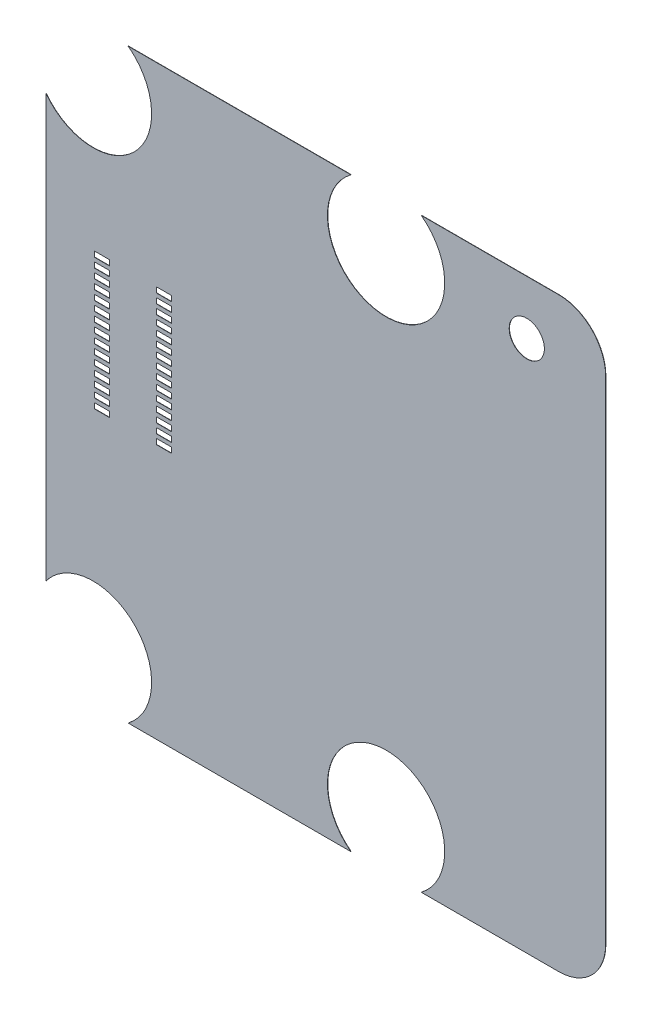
ISO-10303-21;
HEADER;
FILE_DESCRIPTION(('STEP AP214'),'2;1');
FILE_NAME('part.step','',(''),(''),'','','');
FILE_SCHEMA(('AUTOMOTIVE_DESIGN { 1 0 10303 214 1 1 1 1 }'));
ENDSEC;
DATA;
#1=APPLICATION_CONTEXT('core data for automotive mechanical design processes');
#2=APPLICATION_PROTOCOL_DEFINITION('international standard','automotive_design',2000,#1);
#3=PRODUCT_CONTEXT('',#1,'mechanical');
#4=PRODUCT('Part','Part','',(#3));
#5=PRODUCT_RELATED_PRODUCT_CATEGORY('part','',(#4));
#6=PRODUCT_DEFINITION_FORMATION('','',#4);
#7=PRODUCT_DEFINITION_CONTEXT('part definition',#1,'design');
#8=PRODUCT_DEFINITION('design','',#6,#7);
#9=PRODUCT_DEFINITION_SHAPE('','',#8);
#10=(LENGTH_UNIT() NAMED_UNIT(*) SI_UNIT(.MILLI.,.METRE.));
#11=(NAMED_UNIT(*) PLANE_ANGLE_UNIT() SI_UNIT($,.RADIAN.));
#12=(NAMED_UNIT(*) SI_UNIT($,.STERADIAN.) SOLID_ANGLE_UNIT());
#13=UNCERTAINTY_MEASURE_WITH_UNIT(LENGTH_MEASURE(1.E-05),#10,'distance_accuracy_value','');
#14=(GEOMETRIC_REPRESENTATION_CONTEXT(3) GLOBAL_UNCERTAINTY_ASSIGNED_CONTEXT((#13)) GLOBAL_UNIT_ASSIGNED_CONTEXT((#10,
#11,#12)) REPRESENTATION_CONTEXT('',''));
#15=CARTESIAN_POINT('',(0.,0.,0.));
#16=DIRECTION('',(0.,0.,1.));
#17=DIRECTION('',(1.,0.,0.));
#18=AXIS2_PLACEMENT_3D('',#15,#16,#17);
#19=CARTESIAN_POINT('',(16.,25.,-0.74422));
#20=DIRECTION('',(0.,-1.,0.));
#21=DIRECTION('',(0.,0.,-1.));
#22=AXIS2_PLACEMENT_3D('',#19,#20,#21);
#23=PLANE('',#22);
#24=DIRECTION('',(1.,0.,0.));
#25=VECTOR('',#24,1.);
#26=CARTESIAN_POINT('',(18.9309997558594,25.,-0.73152));
#27=LINE('',#26,#25);
#28=CARTESIAN_POINT('',(16.,25.,-0.73152));
#29=VERTEX_POINT('',#28);
#30=CARTESIAN_POINT('',(21.8619995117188,25.,-0.73152));
#31=VERTEX_POINT('',#30);
#32=EDGE_CURVE('E1131',#29,#31,#27,.T.);
#33=ORIENTED_EDGE('',*,*,#32,.T.);
#34=DIRECTION('',(0.,0.,-1.));
#35=VECTOR('',#34,1.);
#36=CARTESIAN_POINT('',(21.8619995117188,25.,-0.73787));
#37=LINE('',#36,#35);
#38=CARTESIAN_POINT('',(21.8619995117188,25.,-0.74422));
#39=VERTEX_POINT('',#38);
#40=EDGE_CURVE('E351',#31,#39,#37,.T.);
#41=ORIENTED_EDGE('',*,*,#40,.T.);
#42=DIRECTION('',(1.,0.,0.));
#43=VECTOR('',#42,1.);
#44=CARTESIAN_POINT('',(16.,25.,-0.74422));
#45=LINE('',#44,#43);
#46=CARTESIAN_POINT('',(16.,25.,-0.74422));
#47=VERTEX_POINT('',#46);
#48=EDGE_CURVE('E1401',#47,#39,#45,.T.);
#49=ORIENTED_EDGE('',*,*,#48,.F.);
#50=DIRECTION('',(0.,0.,-1.));
#51=VECTOR('',#50,1.);
#52=CARTESIAN_POINT('',(16.,25.,-0.73787));
#53=LINE('',#52,#51);
#54=EDGE_CURVE('E2496',#29,#47,#53,.T.);
#55=ORIENTED_EDGE('',*,*,#54,.F.);
#56=EDGE_LOOP('',(#33,#41,#49,#55));
#57=FACE_BOUND('',#56,.T.);
#58=ADVANCED_FACE('F17',(#57),#23,.F.);
#59=CARTESIAN_POINT('',(14.5,23.,-0.74422));
#60=DIRECTION('',(0.,0.,1.));
#61=DIRECTION('',(-0.6,0.8,0.));
#62=AXIS2_PLACEMENT_3D('',#59,#60,#61);
#63=CYLINDRICAL_SURFACE('',#62,2.5);
#64=DIRECTION('',(0.,0.,-1.));
#65=VECTOR('',#64,1.);
#66=CARTESIAN_POINT('',(16.,21.,-0.74422));
#67=LINE('',#66,#65);
#68=CARTESIAN_POINT('',(16.,21.,-0.73152));
#69=VERTEX_POINT('',#68);
#70=CARTESIAN_POINT('',(16.,21.,-0.74422));
#71=VERTEX_POINT('',#70);
#72=EDGE_CURVE('E3239',#69,#71,#67,.T.);
#73=ORIENTED_EDGE('',*,*,#72,.T.);
#74=CARTESIAN_POINT('',(14.5,23.,-0.74422));
#75=DIRECTION('',(0.,0.,1.));
#76=DIRECTION('',(-0.6,0.8,0.));
#77=AXIS2_PLACEMENT_3D('',#74,#75,#76);
#78=CIRCLE('',#77,2.5);
#79=CARTESIAN_POINT('',(13.,25.,-0.74422));
#80=VERTEX_POINT('',#79);
#81=EDGE_CURVE('E610',#80,#71,#78,.T.);
#82=ORIENTED_EDGE('',*,*,#81,.F.);
#83=DIRECTION('',(0.,0.,-1.));
#84=VECTOR('',#83,1.);
#85=CARTESIAN_POINT('',(13.,25.,-0.73787));
#86=LINE('',#85,#84);
#87=CARTESIAN_POINT('',(13.,25.,-0.73152));
#88=VERTEX_POINT('',#87);
#89=EDGE_CURVE('E11',#88,#80,#86,.T.);
#90=ORIENTED_EDGE('',*,*,#89,.F.);
#91=CARTESIAN_POINT('',(14.5,23.,-0.73152));
#92=DIRECTION('',(0.,0.,1.));
#93=DIRECTION('',(-0.6,0.8,0.));
#94=AXIS2_PLACEMENT_3D('',#91,#92,#93);
#95=CIRCLE('',#94,2.5);
#96=EDGE_CURVE('E1144',#88,#69,#95,.T.);
#97=ORIENTED_EDGE('',*,*,#96,.T.);
#98=EDGE_LOOP('',(#73,#82,#90,#97));
#99=FACE_BOUND('',#98,.T.);
#100=ADVANCED_FACE('F2481',(#99),#63,.F.);
#101=CARTESIAN_POINT('',(3.5,25.,-0.74422));
#102=DIRECTION('',(0.,-1.,0.));
#103=DIRECTION('',(0.,0.,-1.));
#104=AXIS2_PLACEMENT_3D('',#101,#102,#103);
#105=PLANE('',#104);
#106=DIRECTION('',(1.,0.,0.));
#107=VECTOR('',#106,1.);
#108=CARTESIAN_POINT('',(8.25,25.,-0.73152));
#109=LINE('',#108,#107);
#110=CARTESIAN_POINT('',(3.5,25.,-0.73152));
#111=VERTEX_POINT('',#110);
#112=EDGE_CURVE('E1156',#111,#88,#109,.T.);
#113=ORIENTED_EDGE('',*,*,#112,.T.);
#114=ORIENTED_EDGE('',*,*,#89,.T.);
#115=DIRECTION('',(1.,0.,0.));
#116=VECTOR('',#115,1.);
#117=CARTESIAN_POINT('',(3.5,25.,-0.74422));
#118=LINE('',#117,#116);
#119=CARTESIAN_POINT('',(3.5,25.,-0.74422));
#120=VERTEX_POINT('',#119);
#121=EDGE_CURVE('E591',#120,#80,#118,.T.);
#122=ORIENTED_EDGE('',*,*,#121,.F.);
#123=DIRECTION('',(0.,0.,-1.));
#124=VECTOR('',#123,1.);
#125=CARTESIAN_POINT('',(3.5,25.,-0.73787));
#126=LINE('',#125,#124);
#127=EDGE_CURVE('E3235',#111,#120,#126,.T.);
#128=ORIENTED_EDGE('',*,*,#127,.F.);
#129=EDGE_LOOP('',(#113,#114,#122,#128));
#130=FACE_BOUND('',#129,.T.);
#131=ADVANCED_FACE('F2486',(#130),#105,.F.);
#132=CARTESIAN_POINT('',(2.00000060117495,22.9999993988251,-0.74422));
#133=DIRECTION('',(0.,0.,1.));
#134=DIRECTION('',(-0.800000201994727,-0.599999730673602,0.));
#135=AXIS2_PLACEMENT_3D('',#132,#133,#134);
#136=CYLINDRICAL_SURFACE('',#135,2.50000012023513);
#137=DIRECTION('',(0.,0.,-1.));
#138=VECTOR('',#137,1.);
#139=CARTESIAN_POINT('',(4.0000012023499,24.4999987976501,-0.74422));
#140=LINE('',#139,#138);
#141=CARTESIAN_POINT('',(4.0000012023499,24.4999987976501,-0.73152));
#142=VERTEX_POINT('',#141);
#143=CARTESIAN_POINT('',(4.0000012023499,24.4999987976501,-0.74422));
#144=VERTEX_POINT('',#143);
#145=EDGE_CURVE('E586',#142,#144,#140,.T.);
#146=ORIENTED_EDGE('',*,*,#145,.T.);
#147=CARTESIAN_POINT('',(2.00000060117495,22.9999993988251,-0.74422));
#148=DIRECTION('',(0.,0.,1.));
#149=DIRECTION('',(-0.800000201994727,-0.599999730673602,0.));
#150=AXIS2_PLACEMENT_3D('',#147,#148,#149);
#151=CIRCLE('',#150,2.50000012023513);
#152=CARTESIAN_POINT('',(0.,21.5,-0.74422));
#153=VERTEX_POINT('',#152);
#154=EDGE_CURVE('E582',#153,#144,#151,.T.);
#155=ORIENTED_EDGE('',*,*,#154,.F.);
#156=DIRECTION('',(0.,0.,-1.));
#157=VECTOR('',#156,1.);
#158=CARTESIAN_POINT('',(0.,21.5,-0.73787));
#159=LINE('',#158,#157);
#160=CARTESIAN_POINT('',(0.,21.5,-0.73152));
#161=VERTEX_POINT('',#160);
#162=EDGE_CURVE('E20',#161,#153,#159,.T.);
#163=ORIENTED_EDGE('',*,*,#162,.F.);
#164=CARTESIAN_POINT('',(2.00000060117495,22.9999993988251,-0.73152));
#165=DIRECTION('',(0.,0.,1.));
#166=DIRECTION('',(-0.800000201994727,-0.599999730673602,0.));
#167=AXIS2_PLACEMENT_3D('',#164,#165,#166);
#168=CIRCLE('',#167,2.50000012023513);
#169=EDGE_CURVE('E1160',#161,#142,#168,.T.);
#170=ORIENTED_EDGE('',*,*,#169,.T.);
#171=EDGE_LOOP('',(#146,#155,#163,#170));
#172=FACE_BOUND('',#171,.T.);
#173=ADVANCED_FACE('F583',(#172),#136,.F.);
#174=CARTESIAN_POINT('',(0.,3.5,-0.74422));
#175=DIRECTION('',(1.,0.,0.));
#176=DIRECTION('',(0.,1.,0.));
#177=AXIS2_PLACEMENT_3D('',#174,#175,#176);
#178=PLANE('',#177);
#179=DIRECTION('',(0.,1.,0.));
#180=VECTOR('',#179,1.);
#181=CARTESIAN_POINT('',(0.,12.5,-0.73152));
#182=LINE('',#181,#180);
#183=CARTESIAN_POINT('',(0.,3.5,-0.73152));
#184=VERTEX_POINT('',#183);
#185=EDGE_CURVE('E573',#184,#161,#182,.T.);
#186=ORIENTED_EDGE('',*,*,#185,.T.);
#187=ORIENTED_EDGE('',*,*,#162,.T.);
#188=DIRECTION('',(0.,1.,0.));
#189=VECTOR('',#188,1.);
#190=CARTESIAN_POINT('',(0.,3.5,-0.74422));
#191=LINE('',#190,#189);
#192=CARTESIAN_POINT('',(0.,3.5,-0.74422));
#193=VERTEX_POINT('',#192);
#194=EDGE_CURVE('E569',#193,#153,#191,.T.);
#195=ORIENTED_EDGE('',*,*,#194,.F.);
#196=DIRECTION('',(0.,0.,-1.));
#197=VECTOR('',#196,1.);
#198=CARTESIAN_POINT('',(0.,3.5,-0.73787));
#199=LINE('',#198,#197);
#200=EDGE_CURVE('E4197',#184,#193,#199,.T.);
#201=ORIENTED_EDGE('',*,*,#200,.F.);
#202=EDGE_LOOP('',(#186,#187,#195,#201));
#203=FACE_BOUND('',#202,.T.);
#204=ADVANCED_FACE('F565',(#203),#178,.F.);
#205=CARTESIAN_POINT('',(1.99999979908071,1.99999979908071,-0.74422));
#206=DIRECTION('',(0.,0.,1.));
#207=DIRECTION('',(0.600000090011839,-0.799999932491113,0.));
#208=AXIS2_PLACEMENT_3D('',#205,#206,#207);
#209=CYLINDRICAL_SURFACE('',#208,2.49999995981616);
#210=DIRECTION('',(0.,0.,-1.));
#211=VECTOR('',#210,1.);
#212=CARTESIAN_POINT('',(0.499999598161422,3.99999959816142,-0.74422));
#213=LINE('',#212,#211);
#214=CARTESIAN_POINT('',(0.499999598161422,3.99999959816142,-0.73152));
#215=VERTEX_POINT('',#214);
#216=CARTESIAN_POINT('',(0.499999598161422,3.99999959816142,-0.74422));
#217=VERTEX_POINT('',#216);
#218=EDGE_CURVE('E4214',#215,#217,#213,.T.);
#219=ORIENTED_EDGE('',*,*,#218,.T.);
#220=CARTESIAN_POINT('',(1.99999979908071,1.99999979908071,-0.74422));
#221=DIRECTION('',(0.,0.,1.));
#222=DIRECTION('',(0.600000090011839,-0.799999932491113,0.));
#223=AXIS2_PLACEMENT_3D('',#220,#221,#222);
#224=CIRCLE('',#223,2.49999995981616);
#225=CARTESIAN_POINT('',(3.5,0.,-0.74422));
#226=VERTEX_POINT('',#225);
#227=EDGE_CURVE('E599',#226,#217,#224,.T.);
#228=ORIENTED_EDGE('',*,*,#227,.F.);
#229=DIRECTION('',(0.,0.,-1.));
#230=VECTOR('',#229,1.);
#231=CARTESIAN_POINT('',(3.5,0.,-0.73787));
#232=LINE('',#231,#230);
#233=CARTESIAN_POINT('',(3.5,0.,-0.73152));
#234=VERTEX_POINT('',#233);
#235=EDGE_CURVE('E545',#234,#226,#232,.T.);
#236=ORIENTED_EDGE('',*,*,#235,.F.);
#237=CARTESIAN_POINT('',(1.99999979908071,1.99999979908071,-0.73152));
#238=DIRECTION('',(0.,0.,1.));
#239=DIRECTION('',(0.600000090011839,-0.799999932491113,0.));
#240=AXIS2_PLACEMENT_3D('',#237,#238,#239);
#241=CIRCLE('',#240,2.49999995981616);
#242=EDGE_CURVE('E1127',#234,#215,#241,.T.);
#243=ORIENTED_EDGE('',*,*,#242,.T.);
#244=EDGE_LOOP('',(#219,#228,#236,#243));
#245=FACE_BOUND('',#244,.T.);
#246=ADVANCED_FACE('F3159',(#245),#209,.F.);
#247=CARTESIAN_POINT('',(13.,0.,-0.74422));
#248=DIRECTION('',(0.,1.,0.));
#249=DIRECTION('',(1.,0.,0.));
#250=AXIS2_PLACEMENT_3D('',#247,#248,#249);
#251=PLANE('',#250);
#252=DIRECTION('',(-1.,0.,0.));
#253=VECTOR('',#252,1.);
#254=CARTESIAN_POINT('',(8.25,0.,-0.73152));
#255=LINE('',#254,#253);
#256=CARTESIAN_POINT('',(13.,0.,-0.73152));
#257=VERTEX_POINT('',#256);
#258=EDGE_CURVE('E1123',#257,#234,#255,.T.);
#259=ORIENTED_EDGE('',*,*,#258,.T.);
#260=ORIENTED_EDGE('',*,*,#235,.T.);
#261=DIRECTION('',(-1.,0.,0.));
#262=VECTOR('',#261,1.);
#263=CARTESIAN_POINT('',(13.,0.,-0.74422));
#264=LINE('',#263,#262);
#265=CARTESIAN_POINT('',(13.,0.,-0.74422));
#266=VERTEX_POINT('',#265);
#267=EDGE_CURVE('E603',#266,#226,#264,.T.);
#268=ORIENTED_EDGE('',*,*,#267,.F.);
#269=DIRECTION('',(0.,0.,-1.));
#270=VECTOR('',#269,1.);
#271=CARTESIAN_POINT('',(13.,0.,-0.73787));
#272=LINE('',#271,#270);
#273=EDGE_CURVE('E4224',#257,#266,#272,.T.);
#274=ORIENTED_EDGE('',*,*,#273,.F.);
#275=EDGE_LOOP('',(#259,#260,#268,#274));
#276=FACE_BOUND('',#275,.T.);
#277=ADVANCED_FACE('F3162',(#276),#251,.F.);
#278=CARTESIAN_POINT('',(14.5,2.,-0.74422));
#279=DIRECTION('',(0.,0.,1.));
#280=DIRECTION('',(0.6,-0.8,0.));
#281=AXIS2_PLACEMENT_3D('',#278,#279,#280);
#282=CYLINDRICAL_SURFACE('',#281,2.5);
#283=DIRECTION('',(0.,0.,-1.));
#284=VECTOR('',#283,1.);
#285=CARTESIAN_POINT('',(13.,4.,-0.74422));
#286=LINE('',#285,#284);
#287=CARTESIAN_POINT('',(13.,4.,-0.73152));
#288=VERTEX_POINT('',#287);
#289=CARTESIAN_POINT('',(13.,4.,-0.74422));
#290=VERTEX_POINT('',#289);
#291=EDGE_CURVE('E4196',#288,#290,#286,.T.);
#292=ORIENTED_EDGE('',*,*,#291,.T.);
#293=CARTESIAN_POINT('',(14.5,2.,-0.74422));
#294=DIRECTION('',(0.,0.,1.));
#295=DIRECTION('',(0.6,-0.8,0.));
#296=AXIS2_PLACEMENT_3D('',#293,#294,#295);
#297=CIRCLE('',#296,2.5);
#298=CARTESIAN_POINT('',(16.,0.,-0.74422));
#299=VERTEX_POINT('',#298);
#300=EDGE_CURVE('E1488',#299,#290,#297,.T.);
#301=ORIENTED_EDGE('',*,*,#300,.F.);
#302=DIRECTION('',(0.,0.,-1.));
#303=VECTOR('',#302,1.);
#304=CARTESIAN_POINT('',(16.,0.,-0.73787));
#305=LINE('',#304,#303);
#306=CARTESIAN_POINT('',(16.,0.,-0.73152));
#307=VERTEX_POINT('',#306);
#308=EDGE_CURVE('E542',#307,#299,#305,.T.);
#309=ORIENTED_EDGE('',*,*,#308,.F.);
#310=CARTESIAN_POINT('',(14.5,2.,-0.73152));
#311=DIRECTION('',(0.,0.,1.));
#312=DIRECTION('',(0.6,-0.8,0.));
#313=AXIS2_PLACEMENT_3D('',#310,#311,#312);
#314=CIRCLE('',#313,2.5);
#315=EDGE_CURVE('E1126',#307,#288,#314,.T.);
#316=ORIENTED_EDGE('',*,*,#315,.T.);
#317=EDGE_LOOP('',(#292,#301,#309,#316));
#318=FACE_BOUND('',#317,.T.);
#319=ADVANCED_FACE('F3217',(#318),#282,.F.);
#320=CARTESIAN_POINT('',(21.8619995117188,0.,-0.74422));
#321=DIRECTION('',(0.,1.,0.));
#322=DIRECTION('',(1.,0.,0.));
#323=AXIS2_PLACEMENT_3D('',#320,#321,#322);
#324=PLANE('',#323);
#325=DIRECTION('',(-1.,0.,0.));
#326=VECTOR('',#325,1.);
#327=CARTESIAN_POINT('',(18.9309997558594,0.,-0.73152));
#328=LINE('',#327,#326);
#329=CARTESIAN_POINT('',(21.8619995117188,0.,-0.73152));
#330=VERTEX_POINT('',#329);
#331=EDGE_CURVE('E1177',#330,#307,#328,.T.);
#332=ORIENTED_EDGE('',*,*,#331,.T.);
#333=ORIENTED_EDGE('',*,*,#308,.T.);
#334=DIRECTION('',(-1.,0.,0.));
#335=VECTOR('',#334,1.);
#336=CARTESIAN_POINT('',(21.8619995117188,0.,-0.74422));
#337=LINE('',#336,#335);
#338=CARTESIAN_POINT('',(21.8619995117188,0.,-0.74422));
#339=VERTEX_POINT('',#338);
#340=EDGE_CURVE('E1484',#339,#299,#337,.T.);
#341=ORIENTED_EDGE('',*,*,#340,.F.);
#342=DIRECTION('',(0.,0.,-1.));
#343=VECTOR('',#342,1.);
#344=CARTESIAN_POINT('',(21.8619995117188,0.,-0.73787));
#345=LINE('',#344,#343);
#346=EDGE_CURVE('E477',#330,#339,#345,.T.);
#347=ORIENTED_EDGE('',*,*,#346,.F.);
#348=EDGE_LOOP('',(#332,#333,#341,#347));
#349=FACE_BOUND('',#348,.T.);
#350=ADVANCED_FACE('F3213',(#349),#324,.F.);
#351=CARTESIAN_POINT('',(21.8620000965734,1.9999994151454,-0.74422));
#352=DIRECTION('',(0.,0.,1.));
#353=DIRECTION('',(0.999999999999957,2.92427385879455E-07,0.));
#354=AXIS2_PLACEMENT_3D('',#351,#352,#353);
#355=CYLINDRICAL_SURFACE('',#354,1.99999941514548);
#356=CARTESIAN_POINT('',(21.8620000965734,1.9999994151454,-0.73152));
#357=DIRECTION('',(0.,0.,-1.));
#358=DIRECTION('',(0.999999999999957,2.92427385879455E-07,0.));
#359=AXIS2_PLACEMENT_3D('',#356,#357,#358);
#360=CIRCLE('',#359,1.99999941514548);
#361=CARTESIAN_POINT('',(23.8619995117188,2.,-0.73152));
#362=VERTEX_POINT('',#361);
#363=EDGE_CURVE('E1181',#362,#330,#360,.T.);
#364=ORIENTED_EDGE('',*,*,#363,.T.);
#365=ORIENTED_EDGE('',*,*,#346,.T.);
#366=CARTESIAN_POINT('',(21.8620000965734,1.9999994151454,-0.74422));
#367=DIRECTION('',(0.,0.,-1.));
#368=DIRECTION('',(0.999999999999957,2.92427385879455E-07,0.));
#369=AXIS2_PLACEMENT_3D('',#366,#367,#368);
#370=CIRCLE('',#369,1.99999941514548);
#371=CARTESIAN_POINT('',(23.8619995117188,2.,-0.74422));
#372=VERTEX_POINT('',#371);
#373=EDGE_CURVE('E1489',#372,#339,#370,.T.);
#374=ORIENTED_EDGE('',*,*,#373,.F.);
#375=DIRECTION('',(0.,0.,-1.));
#376=VECTOR('',#375,1.);
#377=CARTESIAN_POINT('',(23.8619995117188,2.,-0.73787));
#378=LINE('',#377,#376);
#379=EDGE_CURVE('E355',#362,#372,#378,.T.);
#380=ORIENTED_EDGE('',*,*,#379,.F.);
#381=EDGE_LOOP('',(#364,#365,#374,#380));
#382=FACE_BOUND('',#381,.T.);
#383=ADVANCED_FACE('F3209',(#382),#355,.T.);
#384=CARTESIAN_POINT('',(23.8619995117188,23.,-0.74422));
#385=DIRECTION('',(-1.,0.,0.));
#386=DIRECTION('',(0.,0.,1.));
#387=AXIS2_PLACEMENT_3D('',#384,#385,#386);
#388=PLANE('',#387);
#389=DIRECTION('',(0.,-1.,0.));
#390=VECTOR('',#389,1.);
#391=CARTESIAN_POINT('',(23.8619995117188,12.5,-0.73152));
#392=LINE('',#391,#390);
#393=CARTESIAN_POINT('',(23.8619995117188,23.,-0.73152));
#394=VERTEX_POINT('',#393);
#395=EDGE_CURVE('E1190',#394,#362,#392,.T.);
#396=ORIENTED_EDGE('',*,*,#395,.T.);
#397=ORIENTED_EDGE('',*,*,#379,.T.);
#398=DIRECTION('',(0.,-1.,0.));
#399=VECTOR('',#398,1.);
#400=CARTESIAN_POINT('',(23.8619995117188,23.,-0.74422));
#401=LINE('',#400,#399);
#402=CARTESIAN_POINT('',(23.8619995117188,23.,-0.74422));
#403=VERTEX_POINT('',#402);
#404=EDGE_CURVE('E1400',#403,#372,#401,.T.);
#405=ORIENTED_EDGE('',*,*,#404,.F.);
#406=DIRECTION('',(0.,0.,-1.));
#407=VECTOR('',#406,1.);
#408=CARTESIAN_POINT('',(23.8619995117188,23.,-0.73787));
#409=LINE('',#408,#407);
#410=EDGE_CURVE('E356',#394,#403,#409,.T.);
#411=ORIENTED_EDGE('',*,*,#410,.F.);
#412=EDGE_LOOP('',(#396,#397,#405,#411));
#413=FACE_BOUND('',#412,.T.);
#414=ADVANCED_FACE('F3205',(#413),#388,.F.);
#415=CARTESIAN_POINT('',(21.8620005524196,23.0000010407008,-0.74422));
#416=DIRECTION('',(0.,0.,1.));
#417=DIRECTION('',(-5.20350681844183E-07,0.999999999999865,0.));
#418=AXIS2_PLACEMENT_3D('',#415,#416,#417);
#419=CYLINDRICAL_SURFACE('',#418,1.99999895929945);
#420=CARTESIAN_POINT('',(21.8620005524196,23.0000010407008,-0.73152));
#421=DIRECTION('',(0.,0.,-1.));
#422=DIRECTION('',(-5.20350681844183E-07,0.999999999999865,0.));
#423=AXIS2_PLACEMENT_3D('',#420,#421,#422);
#424=CIRCLE('',#423,1.99999895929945);
#425=EDGE_CURVE('E1202',#31,#394,#424,.T.);
#426=ORIENTED_EDGE('',*,*,#425,.T.);
#427=ORIENTED_EDGE('',*,*,#410,.T.);
#428=CARTESIAN_POINT('',(21.8620005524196,23.0000010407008,-0.74422));
#429=DIRECTION('',(0.,0.,-1.));
#430=DIRECTION('',(-5.20350681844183E-07,0.999999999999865,0.));
#431=AXIS2_PLACEMENT_3D('',#428,#429,#430);
#432=CIRCLE('',#431,1.99999895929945);
#433=EDGE_CURVE('E1396',#39,#403,#432,.T.);
#434=ORIENTED_EDGE('',*,*,#433,.F.);
#435=ORIENTED_EDGE('',*,*,#40,.F.);
#436=EDGE_LOOP('',(#426,#427,#434,#435));
#437=FACE_BOUND('',#436,.T.);
#438=ADVANCED_FACE('F3166',(#437),#419,.T.);
#439=CARTESIAN_POINT('',(2.05479995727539,11.1152001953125,-0.74422));
#440=DIRECTION('',(-1.,0.,0.));
#441=DIRECTION('',(0.,0.,1.));
#442=AXIS2_PLACEMENT_3D('',#439,#440,#441);
#443=PLANE('',#442);
#444=DIRECTION('',(0.,-1.,0.));
#445=VECTOR('',#444,1.);
#446=CARTESIAN_POINT('',(2.05479995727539,11.,-0.73152));
#447=LINE('',#446,#445);
#448=CARTESIAN_POINT('',(2.05479995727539,11.1152001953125,-0.73152));
#449=VERTEX_POINT('',#448);
#450=CARTESIAN_POINT('',(2.05479995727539,10.8847998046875,-0.73152));
#451=VERTEX_POINT('',#450);
#452=EDGE_CURVE('E1214',#449,#451,#447,.T.);
#453=ORIENTED_EDGE('',*,*,#452,.T.);
#454=DIRECTION('',(0.,0.,-1.));
#455=VECTOR('',#454,1.);
#456=CARTESIAN_POINT('',(2.05479995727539,10.8847998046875,-0.73787));
#457=LINE('',#456,#455);
#458=CARTESIAN_POINT('',(2.05479995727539,10.8847998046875,-0.74422));
#459=VERTEX_POINT('',#458);
#460=EDGE_CURVE('E527',#451,#459,#457,.T.);
#461=ORIENTED_EDGE('',*,*,#460,.T.);
#462=DIRECTION('',(0.,-1.,0.));
#463=VECTOR('',#462,1.);
#464=CARTESIAN_POINT('',(2.05479995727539,11.1152001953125,-0.74422));
#465=LINE('',#464,#463);
#466=CARTESIAN_POINT('',(2.05479995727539,11.1152001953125,-0.74422));
#467=VERTEX_POINT('',#466);
#468=EDGE_CURVE('E626',#467,#459,#465,.T.);
#469=ORIENTED_EDGE('',*,*,#468,.F.);
#470=DIRECTION('',(0.,0.,-1.));
#471=VECTOR('',#470,1.);
#472=CARTESIAN_POINT('',(2.05479995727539,11.1152001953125,-0.73787));
#473=LINE('',#472,#471);
#474=EDGE_CURVE('E532',#449,#467,#473,.T.);
#475=ORIENTED_EDGE('',*,*,#474,.F.);
#476=EDGE_LOOP('',(#453,#461,#469,#475));
#477=FACE_BOUND('',#476,.T.);
#478=ADVANCED_FACE('F2775',(#477),#443,.F.);
#479=CARTESIAN_POINT('',(2.69519989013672,11.1152001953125,-0.74422));
#480=DIRECTION('',(0.,1.,0.));
#481=DIRECTION('',(1.,0.,0.));
#482=AXIS2_PLACEMENT_3D('',#479,#480,#481);
#483=PLANE('',#482);
#484=DIRECTION('',(-1.,0.,0.));
#485=VECTOR('',#484,1.);
#486=CARTESIAN_POINT('',(2.37499992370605,11.1152001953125,-0.73152));
#487=LINE('',#486,#485);
#488=CARTESIAN_POINT('',(2.69519989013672,11.1152001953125,-0.73152));
#489=VERTEX_POINT('',#488);
#490=EDGE_CURVE('E1218',#489,#449,#487,.T.);
#491=ORIENTED_EDGE('',*,*,#490,.T.);
#492=ORIENTED_EDGE('',*,*,#474,.T.);
#493=DIRECTION('',(-1.,0.,0.));
#494=VECTOR('',#493,1.);
#495=CARTESIAN_POINT('',(2.69519989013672,11.1152001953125,-0.74422));
#496=LINE('',#495,#494);
#497=CARTESIAN_POINT('',(2.69519989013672,11.1152001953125,-0.74422));
#498=VERTEX_POINT('',#497);
#499=EDGE_CURVE('E644',#498,#467,#496,.T.);
#500=ORIENTED_EDGE('',*,*,#499,.F.);
#501=DIRECTION('',(0.,0.,-1.));
#502=VECTOR('',#501,1.);
#503=CARTESIAN_POINT('',(2.69519989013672,11.1152001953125,-0.73787));
#504=LINE('',#503,#502);
#505=EDGE_CURVE('E528',#489,#498,#504,.T.);
#506=ORIENTED_EDGE('',*,*,#505,.F.);
#507=EDGE_LOOP('',(#491,#492,#500,#506));
#508=FACE_BOUND('',#507,.T.);
#509=ADVANCED_FACE('F2786',(#508),#483,.F.);
#510=CARTESIAN_POINT('',(2.69519989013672,10.8847998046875,-0.74422));
#511=DIRECTION('',(1.,0.,0.));
#512=DIRECTION('',(0.,1.,0.));
#513=AXIS2_PLACEMENT_3D('',#510,#511,#512);
#514=PLANE('',#513);
#515=DIRECTION('',(0.,1.,0.));
#516=VECTOR('',#515,1.);
#517=CARTESIAN_POINT('',(2.69519989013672,11.,-0.73152));
#518=LINE('',#517,#516);
#519=CARTESIAN_POINT('',(2.69519989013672,10.8847998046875,-0.73152));
#520=VERTEX_POINT('',#519);
#521=EDGE_CURVE('E1231',#520,#489,#518,.T.);
#522=ORIENTED_EDGE('',*,*,#521,.T.);
#523=ORIENTED_EDGE('',*,*,#505,.T.);
#524=DIRECTION('',(0.,1.,0.));
#525=VECTOR('',#524,1.);
#526=CARTESIAN_POINT('',(2.69519989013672,10.8847998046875,-0.74422));
#527=LINE('',#526,#525);
#528=CARTESIAN_POINT('',(2.69519989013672,10.8847998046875,-0.74422));
#529=VERTEX_POINT('',#528);
#530=EDGE_CURVE('E640',#529,#498,#527,.T.);
#531=ORIENTED_EDGE('',*,*,#530,.F.);
#532=DIRECTION('',(0.,0.,-1.));
#533=VECTOR('',#532,1.);
#534=CARTESIAN_POINT('',(2.69519989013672,10.8847998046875,-0.73787));
#535=LINE('',#534,#533);
#536=EDGE_CURVE('E523',#520,#529,#535,.T.);
#537=ORIENTED_EDGE('',*,*,#536,.F.);
#538=EDGE_LOOP('',(#522,#523,#531,#537));
#539=FACE_BOUND('',#538,.T.);
#540=ADVANCED_FACE('F2783',(#539),#514,.F.);
#541=CARTESIAN_POINT('',(2.05479995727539,10.8847998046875,-0.74422));
#542=DIRECTION('',(0.,-1.,0.));
#543=DIRECTION('',(0.,0.,-1.));
#544=AXIS2_PLACEMENT_3D('',#541,#542,#543);
#545=PLANE('',#544);
#546=DIRECTION('',(1.,0.,0.));
#547=VECTOR('',#546,1.);
#548=CARTESIAN_POINT('',(2.37499992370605,10.8847998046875,-0.73152));
#549=LINE('',#548,#547);
#550=EDGE_CURVE('E1250',#451,#520,#549,.T.);
#551=ORIENTED_EDGE('',*,*,#550,.T.);
#552=ORIENTED_EDGE('',*,*,#536,.T.);
#553=DIRECTION('',(1.,0.,0.));
#554=VECTOR('',#553,1.);
#555=CARTESIAN_POINT('',(2.05479995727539,10.8847998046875,-0.74422));
#556=LINE('',#555,#554);
#557=EDGE_CURVE('E630',#459,#529,#556,.T.);
#558=ORIENTED_EDGE('',*,*,#557,.F.);
#559=ORIENTED_EDGE('',*,*,#460,.F.);
#560=EDGE_LOOP('',(#551,#552,#558,#559));
#561=FACE_BOUND('',#560,.T.);
#562=ADVANCED_FACE('F2779',(#561),#545,.F.);
#563=CARTESIAN_POINT('',(4.7047998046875,11.1152001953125,-0.74422));
#564=DIRECTION('',(-1.,0.,0.));
#565=DIRECTION('',(0.,0.,1.));
#566=AXIS2_PLACEMENT_3D('',#563,#564,#565);
#567=PLANE('',#566);
#568=DIRECTION('',(0.,-1.,0.));
#569=VECTOR('',#568,1.);
#570=CARTESIAN_POINT('',(4.7047998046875,11.,-0.73152));
#571=LINE('',#570,#569);
#572=CARTESIAN_POINT('',(4.7047998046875,11.1152001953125,-0.73152));
#573=VERTEX_POINT('',#572);
#574=CARTESIAN_POINT('',(4.7047998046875,10.8847998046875,-0.73152));
#575=VERTEX_POINT('',#574);
#576=EDGE_CURVE('E1251',#573,#575,#571,.T.);
#577=ORIENTED_EDGE('',*,*,#576,.T.);
#578=DIRECTION('',(0.,0.,-1.));
#579=VECTOR('',#578,1.);
#580=CARTESIAN_POINT('',(4.7047998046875,10.8847998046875,-0.73787));
#581=LINE('',#580,#579);
#582=CARTESIAN_POINT('',(4.7047998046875,10.8847998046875,-0.74422));
#583=VERTEX_POINT('',#582);
#584=EDGE_CURVE('E514',#575,#583,#581,.T.);
#585=ORIENTED_EDGE('',*,*,#584,.T.);
#586=DIRECTION('',(0.,-1.,0.));
#587=VECTOR('',#586,1.);
#588=CARTESIAN_POINT('',(4.7047998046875,11.1152001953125,-0.74422));
#589=LINE('',#588,#587);
#590=CARTESIAN_POINT('',(4.7047998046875,11.1152001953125,-0.74422));
#591=VERTEX_POINT('',#590);
#592=EDGE_CURVE('E654',#591,#583,#589,.T.);
#593=ORIENTED_EDGE('',*,*,#592,.F.);
#594=DIRECTION('',(0.,0.,-1.));
#595=VECTOR('',#594,1.);
#596=CARTESIAN_POINT('',(4.7047998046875,11.1152001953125,-0.73787));
#597=LINE('',#596,#595);
#598=EDGE_CURVE('E519',#573,#591,#597,.T.);
#599=ORIENTED_EDGE('',*,*,#598,.F.);
#600=EDGE_LOOP('',(#577,#585,#593,#599));
#601=FACE_BOUND('',#600,.T.);
#602=ADVANCED_FACE('F2854',(#601),#567,.F.);
#603=CARTESIAN_POINT('',(5.34519958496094,11.1152001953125,-0.74422));
#604=DIRECTION('',(0.,1.,0.));
#605=DIRECTION('',(1.,0.,0.));
#606=AXIS2_PLACEMENT_3D('',#603,#604,#605);
#607=PLANE('',#606);
#608=DIRECTION('',(-1.,0.,0.));
#609=VECTOR('',#608,1.);
#610=CARTESIAN_POINT('',(5.02499969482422,11.1152001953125,-0.73152));
#611=LINE('',#610,#609);
#612=CARTESIAN_POINT('',(5.34519958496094,11.1152001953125,-0.73152));
#613=VERTEX_POINT('',#612);
#614=EDGE_CURVE('E1166',#613,#573,#611,.T.);
#615=ORIENTED_EDGE('',*,*,#614,.T.);
#616=ORIENTED_EDGE('',*,*,#598,.T.);
#617=DIRECTION('',(-1.,0.,0.));
#618=VECTOR('',#617,1.);
#619=CARTESIAN_POINT('',(5.34519958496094,11.1152001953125,-0.74422));
#620=LINE('',#619,#618);
#621=CARTESIAN_POINT('',(5.34519958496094,11.1152001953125,-0.74422));
#622=VERTEX_POINT('',#621);
#623=EDGE_CURVE('E671',#622,#591,#620,.T.);
#624=ORIENTED_EDGE('',*,*,#623,.F.);
#625=DIRECTION('',(0.,0.,-1.));
#626=VECTOR('',#625,1.);
#627=CARTESIAN_POINT('',(5.34519958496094,11.1152001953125,-0.73787));
#628=LINE('',#627,#626);
#629=EDGE_CURVE('E515',#613,#622,#628,.T.);
#630=ORIENTED_EDGE('',*,*,#629,.F.);
#631=EDGE_LOOP('',(#615,#616,#624,#630));
#632=FACE_BOUND('',#631,.T.);
#633=ADVANCED_FACE('F3196',(#632),#607,.F.);
#634=CARTESIAN_POINT('',(5.34519958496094,10.8847998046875,-0.74422));
#635=DIRECTION('',(1.,0.,0.));
#636=DIRECTION('',(0.,1.,0.));
#637=AXIS2_PLACEMENT_3D('',#634,#635,#636);
#638=PLANE('',#637);
#639=DIRECTION('',(0.,1.,0.));
#640=VECTOR('',#639,1.);
#641=CARTESIAN_POINT('',(5.34519958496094,11.,-0.73152));
#642=LINE('',#641,#640);
#643=CARTESIAN_POINT('',(5.34519958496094,10.8847998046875,-0.73152));
#644=VERTEX_POINT('',#643);
#645=EDGE_CURVE('E1161',#644,#613,#642,.T.);
#646=ORIENTED_EDGE('',*,*,#645,.T.);
#647=ORIENTED_EDGE('',*,*,#629,.T.);
#648=DIRECTION('',(0.,1.,0.));
#649=VECTOR('',#648,1.);
#650=CARTESIAN_POINT('',(5.34519958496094,10.8847998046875,-0.74422));
#651=LINE('',#650,#649);
#652=CARTESIAN_POINT('',(5.34519958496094,10.8847998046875,-0.74422));
#653=VERTEX_POINT('',#652);
#654=EDGE_CURVE('E667',#653,#622,#651,.T.);
#655=ORIENTED_EDGE('',*,*,#654,.F.);
#656=DIRECTION('',(0.,0.,-1.));
#657=VECTOR('',#656,1.);
#658=CARTESIAN_POINT('',(5.34519958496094,10.8847998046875,-0.73787));
#659=LINE('',#658,#657);
#660=EDGE_CURVE('E510',#644,#653,#659,.T.);
#661=ORIENTED_EDGE('',*,*,#660,.F.);
#662=EDGE_LOOP('',(#646,#647,#655,#661));
#663=FACE_BOUND('',#662,.T.);
#664=ADVANCED_FACE('F3137',(#663),#638,.F.);
#665=CARTESIAN_POINT('',(4.7047998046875,10.8847998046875,-0.74422));
#666=DIRECTION('',(0.,-1.,0.));
#667=DIRECTION('',(0.,0.,-1.));
#668=AXIS2_PLACEMENT_3D('',#665,#666,#667);
#669=PLANE('',#668);
#670=DIRECTION('',(1.,0.,0.));
#671=VECTOR('',#670,1.);
#672=CARTESIAN_POINT('',(5.02499969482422,10.8847998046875,-0.73152));
#673=LINE('',#672,#671);
#674=EDGE_CURVE('E1165',#575,#644,#673,.T.);
#675=ORIENTED_EDGE('',*,*,#674,.T.);
#676=ORIENTED_EDGE('',*,*,#660,.T.);
#677=DIRECTION('',(1.,0.,0.));
#678=VECTOR('',#677,1.);
#679=CARTESIAN_POINT('',(4.7047998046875,10.8847998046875,-0.74422));
#680=LINE('',#679,#678);
#681=EDGE_CURVE('E663',#583,#653,#680,.T.);
#682=ORIENTED_EDGE('',*,*,#681,.F.);
#683=ORIENTED_EDGE('',*,*,#584,.F.);
#684=EDGE_LOOP('',(#675,#676,#682,#683));
#685=FACE_BOUND('',#684,.T.);
#686=ADVANCED_FACE('F2990',(#685),#669,.F.);
#687=CARTESIAN_POINT('',(2.05479995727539,11.5152001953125,-0.74422));
#688=DIRECTION('',(-1.,0.,0.));
#689=DIRECTION('',(0.,0.,1.));
#690=AXIS2_PLACEMENT_3D('',#687,#688,#689);
#691=PLANE('',#690);
#692=DIRECTION('',(0.,-1.,0.));
#693=VECTOR('',#692,1.);
#694=CARTESIAN_POINT('',(2.05479995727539,11.4,-0.73152));
#695=LINE('',#694,#693);
#696=CARTESIAN_POINT('',(2.05479995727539,11.5152001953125,-0.73152));
#697=VERTEX_POINT('',#696);
#698=CARTESIAN_POINT('',(2.05479995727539,11.2847998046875,-0.73152));
#699=VERTEX_POINT('',#698);
#700=EDGE_CURVE('E1295',#697,#699,#695,.T.);
#701=ORIENTED_EDGE('',*,*,#700,.T.);
#702=DIRECTION('',(0.,0.,-1.));
#703=VECTOR('',#702,1.);
#704=CARTESIAN_POINT('',(2.05479995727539,11.2847998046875,-0.73787));
#705=LINE('',#704,#703);
#706=CARTESIAN_POINT('',(2.05479995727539,11.2847998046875,-0.74422));
#707=VERTEX_POINT('',#706);
#708=EDGE_CURVE('E498',#699,#707,#705,.T.);
#709=ORIENTED_EDGE('',*,*,#708,.T.);
#710=DIRECTION('',(0.,-1.,0.));
#711=VECTOR('',#710,1.);
#712=CARTESIAN_POINT('',(2.05479995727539,11.5152001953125,-0.74422));
#713=LINE('',#712,#711);
#714=CARTESIAN_POINT('',(2.05479995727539,11.5152001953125,-0.74422));
#715=VERTEX_POINT('',#714);
#716=EDGE_CURVE('E675',#715,#707,#713,.T.);
#717=ORIENTED_EDGE('',*,*,#716,.F.);
#718=DIRECTION('',(0.,0.,-1.));
#719=VECTOR('',#718,1.);
#720=CARTESIAN_POINT('',(2.05479995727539,11.5152001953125,-0.73787));
#721=LINE('',#720,#719);
#722=EDGE_CURVE('E506',#697,#715,#721,.T.);
#723=ORIENTED_EDGE('',*,*,#722,.F.);
#724=EDGE_LOOP('',(#701,#709,#717,#723));
#725=FACE_BOUND('',#724,.T.);
#726=ADVANCED_FACE('F2986',(#725),#691,.F.);
#727=CARTESIAN_POINT('',(2.69519989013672,11.5152001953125,-0.74422));
#728=DIRECTION('',(0.,1.,0.));
#729=DIRECTION('',(1.,0.,0.));
#730=AXIS2_PLACEMENT_3D('',#727,#728,#729);
#731=PLANE('',#730);
#732=DIRECTION('',(-1.,0.,0.));
#733=VECTOR('',#732,1.);
#734=CARTESIAN_POINT('',(2.37499992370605,11.5152001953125,-0.73152));
#735=LINE('',#734,#733);
#736=CARTESIAN_POINT('',(2.69519989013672,11.5152001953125,-0.73152));
#737=VERTEX_POINT('',#736);
#738=EDGE_CURVE('E1299',#737,#697,#735,.T.);
#739=ORIENTED_EDGE('',*,*,#738,.T.);
#740=ORIENTED_EDGE('',*,*,#722,.T.);
#741=DIRECTION('',(-1.,0.,0.));
#742=VECTOR('',#741,1.);
#743=CARTESIAN_POINT('',(2.69519989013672,11.5152001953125,-0.74422));
#744=LINE('',#743,#742);
#745=CARTESIAN_POINT('',(2.69519989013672,11.5152001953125,-0.74422));
#746=VERTEX_POINT('',#745);
#747=EDGE_CURVE('E687',#746,#715,#744,.T.);
#748=ORIENTED_EDGE('',*,*,#747,.F.);
#749=DIRECTION('',(0.,0.,-1.));
#750=VECTOR('',#749,1.);
#751=CARTESIAN_POINT('',(2.69519989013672,11.5152001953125,-0.73787));
#752=LINE('',#751,#750);
#753=EDGE_CURVE('E502',#737,#746,#752,.T.);
#754=ORIENTED_EDGE('',*,*,#753,.F.);
#755=EDGE_LOOP('',(#739,#740,#748,#754));
#756=FACE_BOUND('',#755,.T.);
#757=ADVANCED_FACE('F2989',(#756),#731,.F.);
#758=CARTESIAN_POINT('',(2.69519989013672,11.2847998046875,-0.74422));
#759=DIRECTION('',(1.,0.,0.));
#760=DIRECTION('',(0.,1.,0.));
#761=AXIS2_PLACEMENT_3D('',#758,#759,#760);
#762=PLANE('',#761);
#763=DIRECTION('',(0.,1.,0.));
#764=VECTOR('',#763,1.);
#765=CARTESIAN_POINT('',(2.69519989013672,11.4,-0.73152));
#766=LINE('',#765,#764);
#767=CARTESIAN_POINT('',(2.69519989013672,11.2847998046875,-0.73152));
#768=VERTEX_POINT('',#767);
#769=EDGE_CURVE('E1303',#768,#737,#766,.T.);
#770=ORIENTED_EDGE('',*,*,#769,.T.);
#771=ORIENTED_EDGE('',*,*,#753,.T.);
#772=DIRECTION('',(0.,1.,0.));
#773=VECTOR('',#772,1.);
#774=CARTESIAN_POINT('',(2.69519989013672,11.2847998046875,-0.74422));
#775=LINE('',#774,#773);
#776=CARTESIAN_POINT('',(2.69519989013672,11.2847998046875,-0.74422));
#777=VERTEX_POINT('',#776);
#778=EDGE_CURVE('E683',#777,#746,#775,.T.);
#779=ORIENTED_EDGE('',*,*,#778,.F.);
#780=DIRECTION('',(0.,0.,-1.));
#781=VECTOR('',#780,1.);
#782=CARTESIAN_POINT('',(2.69519989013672,11.2847998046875,-0.73787));
#783=LINE('',#782,#781);
#784=EDGE_CURVE('E494',#768,#777,#783,.T.);
#785=ORIENTED_EDGE('',*,*,#784,.F.);
#786=EDGE_LOOP('',(#770,#771,#779,#785));
#787=FACE_BOUND('',#786,.T.);
#788=ADVANCED_FACE('F2961',(#787),#762,.F.);
#789=CARTESIAN_POINT('',(2.05479995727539,11.2847998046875,-0.74422));
#790=DIRECTION('',(0.,-1.,0.));
#791=DIRECTION('',(0.,0.,-1.));
#792=AXIS2_PLACEMENT_3D('',#789,#790,#791);
#793=PLANE('',#792);
#794=DIRECTION('',(1.,0.,0.));
#795=VECTOR('',#794,1.);
#796=CARTESIAN_POINT('',(2.37499992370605,11.2847998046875,-0.73152));
#797=LINE('',#796,#795);
#798=EDGE_CURVE('E1304',#699,#768,#797,.T.);
#799=ORIENTED_EDGE('',*,*,#798,.T.);
#800=ORIENTED_EDGE('',*,*,#784,.T.);
#801=DIRECTION('',(1.,0.,0.));
#802=VECTOR('',#801,1.);
#803=CARTESIAN_POINT('',(2.05479995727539,11.2847998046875,-0.74422));
#804=LINE('',#803,#802);
#805=EDGE_CURVE('E679',#707,#777,#804,.T.);
#806=ORIENTED_EDGE('',*,*,#805,.F.);
#807=ORIENTED_EDGE('',*,*,#708,.F.);
#808=EDGE_LOOP('',(#799,#800,#806,#807));
#809=FACE_BOUND('',#808,.T.);
#810=ADVANCED_FACE('F2958',(#809),#793,.F.);
#811=CARTESIAN_POINT('',(4.7047998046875,11.5152001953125,-0.74422));
#812=DIRECTION('',(-1.,0.,0.));
#813=DIRECTION('',(0.,0.,1.));
#814=AXIS2_PLACEMENT_3D('',#811,#812,#813);
#815=PLANE('',#814);
#816=DIRECTION('',(0.,-1.,0.));
#817=VECTOR('',#816,1.);
#818=CARTESIAN_POINT('',(4.7047998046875,11.4,-0.73152));
#819=LINE('',#818,#817);
#820=CARTESIAN_POINT('',(4.7047998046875,11.5152001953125,-0.73152));
#821=VERTEX_POINT('',#820);
#822=CARTESIAN_POINT('',(4.7047998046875,11.2847998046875,-0.73152));
#823=VERTEX_POINT('',#822);
#824=EDGE_CURVE('E1308',#821,#823,#819,.T.);
#825=ORIENTED_EDGE('',*,*,#824,.T.);
#826=DIRECTION('',(0.,0.,-1.));
#827=VECTOR('',#826,1.);
#828=CARTESIAN_POINT('',(4.7047998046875,11.2847998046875,-0.73787));
#829=LINE('',#828,#827);
#830=CARTESIAN_POINT('',(4.7047998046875,11.2847998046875,-0.74422));
#831=VERTEX_POINT('',#830);
#832=EDGE_CURVE('E485',#823,#831,#829,.T.);
#833=ORIENTED_EDGE('',*,*,#832,.T.);
#834=DIRECTION('',(0.,-1.,0.));
#835=VECTOR('',#834,1.);
#836=CARTESIAN_POINT('',(4.7047998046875,11.5152001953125,-0.74422));
#837=LINE('',#836,#835);
#838=CARTESIAN_POINT('',(4.7047998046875,11.5152001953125,-0.74422));
#839=VERTEX_POINT('',#838);
#840=EDGE_CURVE('E691',#839,#831,#837,.T.);
#841=ORIENTED_EDGE('',*,*,#840,.F.);
#842=DIRECTION('',(0.,0.,-1.));
#843=VECTOR('',#842,1.);
#844=CARTESIAN_POINT('',(4.7047998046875,11.5152001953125,-0.73787));
#845=LINE('',#844,#843);
#846=EDGE_CURVE('E490',#821,#839,#845,.T.);
#847=ORIENTED_EDGE('',*,*,#846,.F.);
#848=EDGE_LOOP('',(#825,#833,#841,#847));
#849=FACE_BOUND('',#848,.T.);
#850=ADVANCED_FACE('F2754',(#849),#815,.F.);
#851=CARTESIAN_POINT('',(5.34519958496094,11.5152001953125,-0.74422));
#852=DIRECTION('',(0.,1.,0.));
#853=DIRECTION('',(1.,0.,0.));
#854=AXIS2_PLACEMENT_3D('',#851,#852,#853);
#855=PLANE('',#854);
#856=DIRECTION('',(-1.,0.,0.));
#857=VECTOR('',#856,1.);
#858=CARTESIAN_POINT('',(5.02499969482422,11.5152001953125,-0.73152));
#859=LINE('',#858,#857);
#860=CARTESIAN_POINT('',(5.34519958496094,11.5152001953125,-0.73152));
#861=VERTEX_POINT('',#860);
#862=EDGE_CURVE('E1312',#861,#821,#859,.T.);
#863=ORIENTED_EDGE('',*,*,#862,.T.);
#864=ORIENTED_EDGE('',*,*,#846,.T.);
#865=DIRECTION('',(-1.,0.,0.));
#866=VECTOR('',#865,1.);
#867=CARTESIAN_POINT('',(5.34519958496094,11.5152001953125,-0.74422));
#868=LINE('',#867,#866);
#869=CARTESIAN_POINT('',(5.34519958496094,11.5152001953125,-0.74422));
#870=VERTEX_POINT('',#869);
#871=EDGE_CURVE('E700',#870,#839,#868,.T.);
#872=ORIENTED_EDGE('',*,*,#871,.F.);
#873=DIRECTION('',(0.,0.,-1.));
#874=VECTOR('',#873,1.);
#875=CARTESIAN_POINT('',(5.34519958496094,11.5152001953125,-0.73787));
#876=LINE('',#875,#874);
#877=EDGE_CURVE('E486',#861,#870,#876,.T.);
#878=ORIENTED_EDGE('',*,*,#877,.F.);
#879=EDGE_LOOP('',(#863,#864,#872,#878));
#880=FACE_BOUND('',#879,.T.);
#881=ADVANCED_FACE('F2757',(#880),#855,.F.);
#882=CARTESIAN_POINT('',(5.34519958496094,11.2847998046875,-0.74422));
#883=DIRECTION('',(1.,0.,0.));
#884=DIRECTION('',(0.,1.,0.));
#885=AXIS2_PLACEMENT_3D('',#882,#883,#884);
#886=PLANE('',#885);
#887=DIRECTION('',(0.,1.,0.));
#888=VECTOR('',#887,1.);
#889=CARTESIAN_POINT('',(5.34519958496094,11.4,-0.73152));
#890=LINE('',#889,#888);
#891=CARTESIAN_POINT('',(5.34519958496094,11.2847998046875,-0.73152));
#892=VERTEX_POINT('',#891);
#893=EDGE_CURVE('E1316',#892,#861,#890,.T.);
#894=ORIENTED_EDGE('',*,*,#893,.T.);
#895=ORIENTED_EDGE('',*,*,#877,.T.);
#896=DIRECTION('',(0.,1.,0.));
#897=VECTOR('',#896,1.);
#898=CARTESIAN_POINT('',(5.34519958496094,11.2847998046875,-0.74422));
#899=LINE('',#898,#897);
#900=CARTESIAN_POINT('',(5.34519958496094,11.2847998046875,-0.74422));
#901=VERTEX_POINT('',#900);
#902=EDGE_CURVE('E696',#901,#870,#899,.T.);
#903=ORIENTED_EDGE('',*,*,#902,.F.);
#904=DIRECTION('',(0.,0.,-1.));
#905=VECTOR('',#904,1.);
#906=CARTESIAN_POINT('',(5.34519958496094,11.2847998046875,-0.73787));
#907=LINE('',#906,#905);
#908=EDGE_CURVE('E481',#892,#901,#907,.T.);
#909=ORIENTED_EDGE('',*,*,#908,.F.);
#910=EDGE_LOOP('',(#894,#895,#903,#909));
#911=FACE_BOUND('',#910,.T.);
#912=ADVANCED_FACE('F2760',(#911),#886,.F.);
#913=CARTESIAN_POINT('',(4.7047998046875,11.2847998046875,-0.74422));
#914=DIRECTION('',(0.,-1.,0.));
#915=DIRECTION('',(0.,0.,-1.));
#916=AXIS2_PLACEMENT_3D('',#913,#914,#915);
#917=PLANE('',#916);
#918=DIRECTION('',(1.,0.,0.));
#919=VECTOR('',#918,1.);
#920=CARTESIAN_POINT('',(5.02499969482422,11.2847998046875,-0.73152));
#921=LINE('',#920,#919);
#922=EDGE_CURVE('E1320',#823,#892,#921,.T.);
#923=ORIENTED_EDGE('',*,*,#922,.T.);
#924=ORIENTED_EDGE('',*,*,#908,.T.);
#925=DIRECTION('',(1.,0.,0.));
#926=VECTOR('',#925,1.);
#927=CARTESIAN_POINT('',(4.7047998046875,11.2847998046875,-0.74422));
#928=LINE('',#927,#926);
#929=EDGE_CURVE('E701',#831,#901,#928,.T.);
#930=ORIENTED_EDGE('',*,*,#929,.F.);
#931=ORIENTED_EDGE('',*,*,#832,.F.);
#932=EDGE_LOOP('',(#923,#924,#930,#931));
#933=FACE_BOUND('',#932,.T.);
#934=ADVANCED_FACE('F2744',(#933),#917,.F.);
#935=CARTESIAN_POINT('',(2.05479995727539,11.9152001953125,-0.74422));
#936=DIRECTION('',(-1.,0.,0.));
#937=DIRECTION('',(0.,0.,1.));
#938=AXIS2_PLACEMENT_3D('',#935,#936,#937);
#939=PLANE('',#938);
#940=DIRECTION('',(0.,-1.,0.));
#941=VECTOR('',#940,1.);
#942=CARTESIAN_POINT('',(2.05479995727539,11.8,-0.73152));
#943=LINE('',#942,#941);
#944=CARTESIAN_POINT('',(2.05479995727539,11.9152001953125,-0.73152));
#945=VERTEX_POINT('',#944);
#946=CARTESIAN_POINT('',(2.05479995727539,11.6847998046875,-0.73152));
#947=VERTEX_POINT('',#946);
#948=EDGE_CURVE('E1324',#945,#947,#943,.T.);
#949=ORIENTED_EDGE('',*,*,#948,.T.);
#950=DIRECTION('',(0.,0.,-1.));
#951=VECTOR('',#950,1.);
#952=CARTESIAN_POINT('',(2.05479995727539,11.6847998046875,-0.73787));
#953=LINE('',#952,#951);
#954=CARTESIAN_POINT('',(2.05479995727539,11.6847998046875,-0.74422));
#955=VERTEX_POINT('',#954);
#956=EDGE_CURVE('E465',#947,#955,#953,.T.);
#957=ORIENTED_EDGE('',*,*,#956,.T.);
#958=DIRECTION('',(0.,-1.,0.));
#959=VECTOR('',#958,1.);
#960=CARTESIAN_POINT('',(2.05479995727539,11.9152001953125,-0.74422));
#961=LINE('',#960,#959);
#962=CARTESIAN_POINT('',(2.05479995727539,11.9152001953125,-0.74422));
#963=VERTEX_POINT('',#962);
#964=EDGE_CURVE('E659',#963,#955,#961,.T.);
#965=ORIENTED_EDGE('',*,*,#964,.F.);
#966=DIRECTION('',(0.,0.,-1.));
#967=VECTOR('',#966,1.);
#968=CARTESIAN_POINT('',(2.05479995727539,11.9152001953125,-0.73787));
#969=LINE('',#968,#967);
#970=EDGE_CURVE('E473',#945,#963,#969,.T.);
#971=ORIENTED_EDGE('',*,*,#970,.F.);
#972=EDGE_LOOP('',(#949,#957,#965,#971));
#973=FACE_BOUND('',#972,.T.);
#974=ADVANCED_FACE('F2947',(#973),#939,.F.);
#975=CARTESIAN_POINT('',(2.69519989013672,11.9152001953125,-0.74422));
#976=DIRECTION('',(0.,1.,0.));
#977=DIRECTION('',(1.,0.,0.));
#978=AXIS2_PLACEMENT_3D('',#975,#976,#977);
#979=PLANE('',#978);
#980=DIRECTION('',(-1.,0.,0.));
#981=VECTOR('',#980,1.);
#982=CARTESIAN_POINT('',(2.37499992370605,11.9152001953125,-0.73152));
#983=LINE('',#982,#981);
#984=CARTESIAN_POINT('',(2.69519989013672,11.9152001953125,-0.73152));
#985=VERTEX_POINT('',#984);
#986=EDGE_CURVE('E1337',#985,#945,#983,.T.);
#987=ORIENTED_EDGE('',*,*,#986,.T.);
#988=ORIENTED_EDGE('',*,*,#970,.T.);
#989=DIRECTION('',(-1.,0.,0.));
#990=VECTOR('',#989,1.);
#991=CARTESIAN_POINT('',(2.69519989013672,11.9152001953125,-0.74422));
#992=LINE('',#991,#990);
#993=CARTESIAN_POINT('',(2.69519989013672,11.9152001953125,-0.74422));
#994=VERTEX_POINT('',#993);
#995=EDGE_CURVE('E645',#994,#963,#992,.T.);
#996=ORIENTED_EDGE('',*,*,#995,.F.);
#997=DIRECTION('',(0.,0.,-1.));
#998=VECTOR('',#997,1.);
#999=CARTESIAN_POINT('',(2.69519989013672,11.9152001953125,-0.73787));
#1000=LINE('',#999,#998);
#1001=EDGE_CURVE('E469',#985,#994,#1000,.T.);
#1002=ORIENTED_EDGE('',*,*,#1001,.F.);
#1003=EDGE_LOOP('',(#987,#988,#996,#1002));
#1004=FACE_BOUND('',#1003,.T.);
#1005=ADVANCED_FACE('F2921',(#1004),#979,.F.);
#1006=CARTESIAN_POINT('',(2.69519989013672,11.6847998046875,-0.74422));
#1007=DIRECTION('',(1.,0.,0.));
#1008=DIRECTION('',(0.,1.,0.));
#1009=AXIS2_PLACEMENT_3D('',#1006,#1007,#1008);
#1010=PLANE('',#1009);
#1011=DIRECTION('',(0.,1.,0.));
#1012=VECTOR('',#1011,1.);
#1013=CARTESIAN_POINT('',(2.69519989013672,11.8,-0.73152));
#1014=LINE('',#1013,#1012);
#1015=CARTESIAN_POINT('',(2.69519989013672,11.6847998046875,-0.73152));
#1016=VERTEX_POINT('',#1015);
#1017=EDGE_CURVE('E1341',#1016,#985,#1014,.T.);
#1018=ORIENTED_EDGE('',*,*,#1017,.T.);
#1019=ORIENTED_EDGE('',*,*,#1001,.T.);
#1020=DIRECTION('',(0.,1.,0.));
#1021=VECTOR('',#1020,1.);
#1022=CARTESIAN_POINT('',(2.69519989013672,11.6847998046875,-0.74422));
#1023=LINE('',#1022,#1021);
#1024=CARTESIAN_POINT('',(2.69519989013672,11.6847998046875,-0.74422));
#1025=VERTEX_POINT('',#1024);
#1026=EDGE_CURVE('E650',#1025,#994,#1023,.T.);
#1027=ORIENTED_EDGE('',*,*,#1026,.F.);
#1028=DIRECTION('',(0.,0.,-1.));
#1029=VECTOR('',#1028,1.);
#1030=CARTESIAN_POINT('',(2.69519989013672,11.6847998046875,-0.73787));
#1031=LINE('',#1030,#1029);
#1032=EDGE_CURVE('E461',#1016,#1025,#1031,.T.);
#1033=ORIENTED_EDGE('',*,*,#1032,.F.);
#1034=EDGE_LOOP('',(#1018,#1019,#1027,#1033));
#1035=FACE_BOUND('',#1034,.T.);
#1036=ADVANCED_FACE('F2917',(#1035),#1010,.F.);
#1037=CARTESIAN_POINT('',(2.05479995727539,11.6847998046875,-0.74422));
#1038=DIRECTION('',(0.,-1.,0.));
#1039=DIRECTION('',(0.,0.,-1.));
#1040=AXIS2_PLACEMENT_3D('',#1037,#1038,#1039);
#1041=PLANE('',#1040);
#1042=DIRECTION('',(1.,0.,0.));
#1043=VECTOR('',#1042,1.);
#1044=CARTESIAN_POINT('',(2.37499992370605,11.6847998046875,-0.73152));
#1045=LINE('',#1044,#1043);
#1046=EDGE_CURVE('E1279',#947,#1016,#1045,.T.);
#1047=ORIENTED_EDGE('',*,*,#1046,.T.);
#1048=ORIENTED_EDGE('',*,*,#1032,.T.);
#1049=DIRECTION('',(1.,0.,0.));
#1050=VECTOR('',#1049,1.);
#1051=CARTESIAN_POINT('',(2.05479995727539,11.6847998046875,-0.74422));
#1052=LINE('',#1051,#1050);
#1053=EDGE_CURVE('E655',#955,#1025,#1052,.T.);
#1054=ORIENTED_EDGE('',*,*,#1053,.F.);
#1055=ORIENTED_EDGE('',*,*,#956,.F.);
#1056=EDGE_LOOP('',(#1047,#1048,#1054,#1055));
#1057=FACE_BOUND('',#1056,.T.);
#1058=ADVANCED_FACE('F2920',(#1057),#1041,.F.);
#1059=CARTESIAN_POINT('',(4.7047998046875,11.9152001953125,-0.74422));
#1060=DIRECTION('',(-1.,0.,0.));
#1061=DIRECTION('',(0.,0.,1.));
#1062=AXIS2_PLACEMENT_3D('',#1059,#1060,#1061);
#1063=PLANE('',#1062);
#1064=DIRECTION('',(0.,-1.,0.));
#1065=VECTOR('',#1064,1.);
#1066=CARTESIAN_POINT('',(4.7047998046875,11.8,-0.73152));
#1067=LINE('',#1066,#1065);
#1068=CARTESIAN_POINT('',(4.7047998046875,11.9152001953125,-0.73152));
#1069=VERTEX_POINT('',#1068);
#1070=CARTESIAN_POINT('',(4.7047998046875,11.6847998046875,-0.73152));
#1071=VERTEX_POINT('',#1070);
#1072=EDGE_CURVE('E1274',#1069,#1071,#1067,.T.);
#1073=ORIENTED_EDGE('',*,*,#1072,.T.);
#1074=DIRECTION('',(0.,0.,-1.));
#1075=VECTOR('',#1074,1.);
#1076=CARTESIAN_POINT('',(4.7047998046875,11.6847998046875,-0.73787));
#1077=LINE('',#1076,#1075);
#1078=CARTESIAN_POINT('',(4.7047998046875,11.6847998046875,-0.74422));
#1079=VERTEX_POINT('',#1078);
#1080=EDGE_CURVE('E452',#1071,#1079,#1077,.T.);
#1081=ORIENTED_EDGE('',*,*,#1080,.T.);
#1082=DIRECTION('',(0.,-1.,0.));
#1083=VECTOR('',#1082,1.);
#1084=CARTESIAN_POINT('',(4.7047998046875,11.9152001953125,-0.74422));
#1085=LINE('',#1084,#1083);
#1086=CARTESIAN_POINT('',(4.7047998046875,11.9152001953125,-0.74422));
#1087=VERTEX_POINT('',#1086);
#1088=EDGE_CURVE('E649',#1087,#1079,#1085,.T.);
#1089=ORIENTED_EDGE('',*,*,#1088,.F.);
#1090=DIRECTION('',(0.,0.,-1.));
#1091=VECTOR('',#1090,1.);
#1092=CARTESIAN_POINT('',(4.7047998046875,11.9152001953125,-0.73787));
#1093=LINE('',#1092,#1091);
#1094=EDGE_CURVE('E457',#1069,#1087,#1093,.T.);
#1095=ORIENTED_EDGE('',*,*,#1094,.F.);
#1096=EDGE_LOOP('',(#1073,#1081,#1089,#1095));
#1097=FACE_BOUND('',#1096,.T.);
#1098=ADVANCED_FACE('F3179',(#1097),#1063,.F.);
#1099=CARTESIAN_POINT('',(5.34519958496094,11.9152001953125,-0.74422));
#1100=DIRECTION('',(0.,1.,0.));
#1101=DIRECTION('',(1.,0.,0.));
#1102=AXIS2_PLACEMENT_3D('',#1099,#1100,#1101);
#1103=PLANE('',#1102);
#1104=DIRECTION('',(-1.,0.,0.));
#1105=VECTOR('',#1104,1.);
#1106=CARTESIAN_POINT('',(5.02499969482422,11.9152001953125,-0.73152));
#1107=LINE('',#1106,#1105);
#1108=CARTESIAN_POINT('',(5.34519958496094,11.9152001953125,-0.73152));
#1109=VERTEX_POINT('',#1108);
#1110=EDGE_CURVE('E1278',#1109,#1069,#1107,.T.);
#1111=ORIENTED_EDGE('',*,*,#1110,.T.);
#1112=ORIENTED_EDGE('',*,*,#1094,.T.);
#1113=DIRECTION('',(-1.,0.,0.));
#1114=VECTOR('',#1113,1.);
#1115=CARTESIAN_POINT('',(5.34519958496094,11.9152001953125,-0.74422));
#1116=LINE('',#1115,#1114);
#1117=CARTESIAN_POINT('',(5.34519958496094,11.9152001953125,-0.74422));
#1118=VERTEX_POINT('',#1117);
#1119=EDGE_CURVE('E622',#1118,#1087,#1116,.T.);
#1120=ORIENTED_EDGE('',*,*,#1119,.F.);
#1121=DIRECTION('',(0.,0.,-1.));
#1122=VECTOR('',#1121,1.);
#1123=CARTESIAN_POINT('',(5.34519958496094,11.9152001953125,-0.73787));
#1124=LINE('',#1123,#1122);
#1125=EDGE_CURVE('E456',#1109,#1118,#1124,.T.);
#1126=ORIENTED_EDGE('',*,*,#1125,.F.);
#1127=EDGE_LOOP('',(#1111,#1112,#1120,#1126));
#1128=FACE_BOUND('',#1127,.T.);
#1129=ADVANCED_FACE('F3175',(#1128),#1103,.F.);
#1130=CARTESIAN_POINT('',(5.34519958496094,11.6847998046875,-0.74422));
#1131=DIRECTION('',(1.,0.,0.));
#1132=DIRECTION('',(0.,1.,0.));
#1133=AXIS2_PLACEMENT_3D('',#1130,#1131,#1132);
#1134=PLANE('',#1133);
#1135=DIRECTION('',(0.,1.,0.));
#1136=VECTOR('',#1135,1.);
#1137=CARTESIAN_POINT('',(5.34519958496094,11.8,-0.73152));
#1138=LINE('',#1137,#1136);
#1139=CARTESIAN_POINT('',(5.34519958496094,11.6847998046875,-0.73152));
#1140=VERTEX_POINT('',#1139);
#1141=EDGE_CURVE('E1287',#1140,#1109,#1138,.T.);
#1142=ORIENTED_EDGE('',*,*,#1141,.T.);
#1143=ORIENTED_EDGE('',*,*,#1125,.T.);
#1144=DIRECTION('',(0.,1.,0.));
#1145=VECTOR('',#1144,1.);
#1146=CARTESIAN_POINT('',(5.34519958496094,11.6847998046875,-0.74422));
#1147=LINE('',#1146,#1145);
#1148=CARTESIAN_POINT('',(5.34519958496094,11.6847998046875,-0.74422));
#1149=VERTEX_POINT('',#1148);
#1150=EDGE_CURVE('E718',#1149,#1118,#1147,.T.);
#1151=ORIENTED_EDGE('',*,*,#1150,.F.);
#1152=DIRECTION('',(0.,0.,-1.));
#1153=VECTOR('',#1152,1.);
#1154=CARTESIAN_POINT('',(5.34519958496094,11.6847998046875,-0.73787));
#1155=LINE('',#1154,#1153);
#1156=EDGE_CURVE('E448',#1140,#1149,#1155,.T.);
#1157=ORIENTED_EDGE('',*,*,#1156,.F.);
#1158=EDGE_LOOP('',(#1142,#1143,#1151,#1157));
#1159=FACE_BOUND('',#1158,.T.);
#1160=ADVANCED_FACE('F3055',(#1159),#1134,.F.);
#1161=CARTESIAN_POINT('',(4.7047998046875,11.6847998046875,-0.74422));
#1162=DIRECTION('',(0.,-1.,0.));
#1163=DIRECTION('',(0.,0.,-1.));
#1164=AXIS2_PLACEMENT_3D('',#1161,#1162,#1163);
#1165=PLANE('',#1164);
#1166=DIRECTION('',(1.,0.,0.));
#1167=VECTOR('',#1166,1.);
#1168=CARTESIAN_POINT('',(5.02499969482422,11.6847998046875,-0.73152));
#1169=LINE('',#1168,#1167);
#1170=EDGE_CURVE('E1291',#1071,#1140,#1169,.T.);
#1171=ORIENTED_EDGE('',*,*,#1170,.T.);
#1172=ORIENTED_EDGE('',*,*,#1156,.T.);
#1173=DIRECTION('',(1.,0.,0.));
#1174=VECTOR('',#1173,1.);
#1175=CARTESIAN_POINT('',(4.7047998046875,11.6847998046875,-0.74422));
#1176=LINE('',#1175,#1174);
#1177=EDGE_CURVE('E714',#1079,#1149,#1176,.T.);
#1178=ORIENTED_EDGE('',*,*,#1177,.F.);
#1179=ORIENTED_EDGE('',*,*,#1080,.F.);
#1180=EDGE_LOOP('',(#1171,#1172,#1178,#1179));
#1181=FACE_BOUND('',#1180,.T.);
#1182=ADVANCED_FACE('F3051',(#1181),#1165,.F.);
#1183=CARTESIAN_POINT('',(2.05479995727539,12.3152001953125,-0.74422));
#1184=DIRECTION('',(-1.,0.,0.));
#1185=DIRECTION('',(0.,0.,1.));
#1186=AXIS2_PLACEMENT_3D('',#1183,#1184,#1185);
#1187=PLANE('',#1186);
#1188=DIRECTION('',(0.,-1.,0.));
#1189=VECTOR('',#1188,1.);
#1190=CARTESIAN_POINT('',(2.05479995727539,12.2,-0.73152));
#1191=LINE('',#1190,#1189);
#1192=CARTESIAN_POINT('',(2.05479995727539,12.3152001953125,-0.73152));
#1193=VERTEX_POINT('',#1192);
#1194=CARTESIAN_POINT('',(2.05479995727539,12.0847998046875,-0.73152));
#1195=VERTEX_POINT('',#1194);
#1196=EDGE_CURVE('E1333',#1193,#1195,#1191,.T.);
#1197=ORIENTED_EDGE('',*,*,#1196,.T.);
#1198=DIRECTION('',(0.,0.,-1.));
#1199=VECTOR('',#1198,1.);
#1200=CARTESIAN_POINT('',(2.05479995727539,12.0847998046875,-0.73787));
#1201=LINE('',#1200,#1199);
#1202=CARTESIAN_POINT('',(2.05479995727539,12.0847998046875,-0.74422));
#1203=VERTEX_POINT('',#1202);
#1204=EDGE_CURVE('E436',#1195,#1203,#1201,.T.);
#1205=ORIENTED_EDGE('',*,*,#1204,.T.);
#1206=DIRECTION('',(0.,-1.,0.));
#1207=VECTOR('',#1206,1.);
#1208=CARTESIAN_POINT('',(2.05479995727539,12.3152001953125,-0.74422));
#1209=LINE('',#1208,#1207);
#1210=CARTESIAN_POINT('',(2.05479995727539,12.3152001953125,-0.74422));
#1211=VERTEX_POINT('',#1210);
#1212=EDGE_CURVE('E617',#1211,#1203,#1209,.T.);
#1213=ORIENTED_EDGE('',*,*,#1212,.F.);
#1214=DIRECTION('',(0.,0.,-1.));
#1215=VECTOR('',#1214,1.);
#1216=CARTESIAN_POINT('',(2.05479995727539,12.3152001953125,-0.73787));
#1217=LINE('',#1216,#1215);
#1218=EDGE_CURVE('E444',#1193,#1211,#1217,.T.);
#1219=ORIENTED_EDGE('',*,*,#1218,.F.);
#1220=EDGE_LOOP('',(#1197,#1205,#1213,#1219));
#1221=FACE_BOUND('',#1220,.T.);
#1222=ADVANCED_FACE('F3054',(#1221),#1187,.F.);
#1223=CARTESIAN_POINT('',(2.69519989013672,12.3152001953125,-0.74422));
#1224=DIRECTION('',(0.,1.,0.));
#1225=DIRECTION('',(1.,0.,0.));
#1226=AXIS2_PLACEMENT_3D('',#1223,#1224,#1225);
#1227=PLANE('',#1226);
#1228=DIRECTION('',(-1.,0.,0.));
#1229=VECTOR('',#1228,1.);
#1230=CARTESIAN_POINT('',(2.37499992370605,12.3152001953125,-0.73152));
#1231=LINE('',#1230,#1229);
#1232=CARTESIAN_POINT('',(2.69519989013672,12.3152001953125,-0.73152));
#1233=VERTEX_POINT('',#1232);
#1234=EDGE_CURVE('E1328',#1233,#1193,#1231,.T.);
#1235=ORIENTED_EDGE('',*,*,#1234,.T.);
#1236=ORIENTED_EDGE('',*,*,#1218,.T.);
#1237=DIRECTION('',(-1.,0.,0.));
#1238=VECTOR('',#1237,1.);
#1239=CARTESIAN_POINT('',(2.69519989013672,12.3152001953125,-0.74422));
#1240=LINE('',#1239,#1238);
#1241=CARTESIAN_POINT('',(2.69519989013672,12.3152001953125,-0.74422));
#1242=VERTEX_POINT('',#1241);
#1243=EDGE_CURVE('E611',#1242,#1211,#1240,.T.);
#1244=ORIENTED_EDGE('',*,*,#1243,.F.);
#1245=DIRECTION('',(0.,0.,-1.));
#1246=VECTOR('',#1245,1.);
#1247=CARTESIAN_POINT('',(2.69519989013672,12.3152001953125,-0.73787));
#1248=LINE('',#1247,#1246);
#1249=EDGE_CURVE('E440',#1233,#1242,#1248,.T.);
#1250=ORIENTED_EDGE('',*,*,#1249,.F.);
#1251=EDGE_LOOP('',(#1235,#1236,#1244,#1250));
#1252=FACE_BOUND('',#1251,.T.);
#1253=ADVANCED_FACE('F3157',(#1252),#1227,.F.);
#1254=CARTESIAN_POINT('',(2.69519989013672,12.0847998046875,-0.74422));
#1255=DIRECTION('',(1.,0.,0.));
#1256=DIRECTION('',(0.,1.,0.));
#1257=AXIS2_PLACEMENT_3D('',#1254,#1255,#1256);
#1258=PLANE('',#1257);
#1259=DIRECTION('',(0.,1.,0.));
#1260=VECTOR('',#1259,1.);
#1261=CARTESIAN_POINT('',(2.69519989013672,12.2,-0.73152));
#1262=LINE('',#1261,#1260);
#1263=CARTESIAN_POINT('',(2.69519989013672,12.0847998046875,-0.73152));
#1264=VERTEX_POINT('',#1263);
#1265=EDGE_CURVE('E1332',#1264,#1233,#1262,.T.);
#1266=ORIENTED_EDGE('',*,*,#1265,.T.);
#1267=ORIENTED_EDGE('',*,*,#1249,.T.);
#1268=DIRECTION('',(0.,1.,0.));
#1269=VECTOR('',#1268,1.);
#1270=CARTESIAN_POINT('',(2.69519989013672,12.0847998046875,-0.74422));
#1271=LINE('',#1270,#1269);
#1272=CARTESIAN_POINT('',(2.69519989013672,12.0847998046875,-0.74422));
#1273=VERTEX_POINT('',#1272);
#1274=EDGE_CURVE('E616',#1273,#1242,#1271,.T.);
#1275=ORIENTED_EDGE('',*,*,#1274,.F.);
#1276=DIRECTION('',(0.,0.,-1.));
#1277=VECTOR('',#1276,1.);
#1278=CARTESIAN_POINT('',(2.69519989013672,12.0847998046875,-0.73787));
#1279=LINE('',#1278,#1277);
#1280=EDGE_CURVE('E432',#1264,#1273,#1279,.T.);
#1281=ORIENTED_EDGE('',*,*,#1280,.F.);
#1282=EDGE_LOOP('',(#1266,#1267,#1275,#1281));
#1283=FACE_BOUND('',#1282,.T.);
#1284=ADVANCED_FACE('F3153',(#1283),#1258,.F.);
#1285=CARTESIAN_POINT('',(2.05479995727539,12.0847998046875,-0.74422));
#1286=DIRECTION('',(0.,-1.,0.));
#1287=DIRECTION('',(0.,0.,-1.));
#1288=AXIS2_PLACEMENT_3D('',#1285,#1286,#1287);
#1289=PLANE('',#1288);
#1290=DIRECTION('',(1.,0.,0.));
#1291=VECTOR('',#1290,1.);
#1292=CARTESIAN_POINT('',(2.37499992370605,12.0847998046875,-0.73152));
#1293=LINE('',#1292,#1291);
#1294=EDGE_CURVE('E1241',#1195,#1264,#1293,.T.);
#1295=ORIENTED_EDGE('',*,*,#1294,.T.);
#1296=ORIENTED_EDGE('',*,*,#1280,.T.);
#1297=DIRECTION('',(1.,0.,0.));
#1298=VECTOR('',#1297,1.);
#1299=CARTESIAN_POINT('',(2.05479995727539,12.0847998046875,-0.74422));
#1300=LINE('',#1299,#1298);
#1301=EDGE_CURVE('E621',#1203,#1273,#1300,.T.);
#1302=ORIENTED_EDGE('',*,*,#1301,.F.);
#1303=ORIENTED_EDGE('',*,*,#1204,.F.);
#1304=EDGE_LOOP('',(#1295,#1296,#1302,#1303));
#1305=FACE_BOUND('',#1304,.T.);
#1306=ADVANCED_FACE('F3085',(#1305),#1289,.F.);
#1307=CARTESIAN_POINT('',(4.7047998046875,12.3152001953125,-0.74422));
#1308=DIRECTION('',(-1.,0.,0.));
#1309=DIRECTION('',(0.,0.,1.));
#1310=AXIS2_PLACEMENT_3D('',#1307,#1308,#1309);
#1311=PLANE('',#1310);
#1312=DIRECTION('',(0.,-1.,0.));
#1313=VECTOR('',#1312,1.);
#1314=CARTESIAN_POINT('',(4.7047998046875,12.2,-0.73152));
#1315=LINE('',#1314,#1313);
#1316=CARTESIAN_POINT('',(4.7047998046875,12.3152001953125,-0.73152));
#1317=VERTEX_POINT('',#1316);
#1318=CARTESIAN_POINT('',(4.7047998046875,12.0847998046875,-0.73152));
#1319=VERTEX_POINT('',#1318);
#1320=EDGE_CURVE('E1236',#1317,#1319,#1315,.T.);
#1321=ORIENTED_EDGE('',*,*,#1320,.T.);
#1322=DIRECTION('',(0.,0.,-1.));
#1323=VECTOR('',#1322,1.);
#1324=CARTESIAN_POINT('',(4.7047998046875,12.0847998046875,-0.73787));
#1325=LINE('',#1324,#1323);
#1326=CARTESIAN_POINT('',(4.7047998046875,12.0847998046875,-0.74422));
#1327=VERTEX_POINT('',#1326);
#1328=EDGE_CURVE('E420',#1319,#1327,#1325,.T.);
#1329=ORIENTED_EDGE('',*,*,#1328,.T.);
#1330=DIRECTION('',(0.,-1.,0.));
#1331=VECTOR('',#1330,1.);
#1332=CARTESIAN_POINT('',(4.7047998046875,12.3152001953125,-0.74422));
#1333=LINE('',#1332,#1331);
#1334=CARTESIAN_POINT('',(4.7047998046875,12.3152001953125,-0.74422));
#1335=VERTEX_POINT('',#1334);
#1336=EDGE_CURVE('E615',#1335,#1327,#1333,.T.);
#1337=ORIENTED_EDGE('',*,*,#1336,.F.);
#1338=DIRECTION('',(0.,0.,-1.));
#1339=VECTOR('',#1338,1.);
#1340=CARTESIAN_POINT('',(4.7047998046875,12.3152001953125,-0.73787));
#1341=LINE('',#1340,#1339);
#1342=EDGE_CURVE('E428',#1317,#1335,#1341,.T.);
#1343=ORIENTED_EDGE('',*,*,#1342,.F.);
#1344=EDGE_LOOP('',(#1321,#1329,#1337,#1343));
#1345=FACE_BOUND('',#1344,.T.);
#1346=ADVANCED_FACE('F3081',(#1345),#1311,.F.);
#1347=CARTESIAN_POINT('',(5.34519958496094,12.3152001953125,-0.74422));
#1348=DIRECTION('',(0.,1.,0.));
#1349=DIRECTION('',(1.,0.,0.));
#1350=AXIS2_PLACEMENT_3D('',#1347,#1348,#1349);
#1351=PLANE('',#1350);
#1352=DIRECTION('',(-1.,0.,0.));
#1353=VECTOR('',#1352,1.);
#1354=CARTESIAN_POINT('',(5.02499969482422,12.3152001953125,-0.73152));
#1355=LINE('',#1354,#1353);
#1356=CARTESIAN_POINT('',(5.34519958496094,12.3152001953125,-0.73152));
#1357=VERTEX_POINT('',#1356);
#1358=EDGE_CURVE('E1240',#1357,#1317,#1355,.T.);
#1359=ORIENTED_EDGE('',*,*,#1358,.T.);
#1360=ORIENTED_EDGE('',*,*,#1342,.T.);
#1361=DIRECTION('',(-1.,0.,0.));
#1362=VECTOR('',#1361,1.);
#1363=CARTESIAN_POINT('',(5.34519958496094,12.3152001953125,-0.74422));
#1364=LINE('',#1363,#1362);
#1365=CARTESIAN_POINT('',(5.34519958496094,12.3152001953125,-0.74422));
#1366=VERTEX_POINT('',#1365);
#1367=EDGE_CURVE('E750',#1366,#1335,#1364,.T.);
#1368=ORIENTED_EDGE('',*,*,#1367,.F.);
#1369=DIRECTION('',(0.,0.,-1.));
#1370=VECTOR('',#1369,1.);
#1371=CARTESIAN_POINT('',(5.34519958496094,12.3152001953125,-0.73787));
#1372=LINE('',#1371,#1370);
#1373=EDGE_CURVE('E424',#1357,#1366,#1372,.T.);
#1374=ORIENTED_EDGE('',*,*,#1373,.F.);
#1375=EDGE_LOOP('',(#1359,#1360,#1368,#1374));
#1376=FACE_BOUND('',#1375,.T.);
#1377=ADVANCED_FACE('F3084',(#1376),#1351,.F.);
#1378=CARTESIAN_POINT('',(5.34519958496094,12.0847998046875,-0.74422));
#1379=DIRECTION('',(1.,0.,0.));
#1380=DIRECTION('',(0.,1.,0.));
#1381=AXIS2_PLACEMENT_3D('',#1378,#1379,#1380);
#1382=PLANE('',#1381);
#1383=DIRECTION('',(0.,1.,0.));
#1384=VECTOR('',#1383,1.);
#1385=CARTESIAN_POINT('',(5.34519958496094,12.2,-0.73152));
#1386=LINE('',#1385,#1384);
#1387=CARTESIAN_POINT('',(5.34519958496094,12.0847998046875,-0.73152));
#1388=VERTEX_POINT('',#1387);
#1389=EDGE_CURVE('E1366',#1388,#1357,#1386,.T.);
#1390=ORIENTED_EDGE('',*,*,#1389,.T.);
#1391=ORIENTED_EDGE('',*,*,#1373,.T.);
#1392=DIRECTION('',(0.,1.,0.));
#1393=VECTOR('',#1392,1.);
#1394=CARTESIAN_POINT('',(5.34519958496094,12.0847998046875,-0.74422));
#1395=LINE('',#1394,#1393);
#1396=CARTESIAN_POINT('',(5.34519958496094,12.0847998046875,-0.74422));
#1397=VERTEX_POINT('',#1396);
#1398=EDGE_CURVE('E746',#1397,#1366,#1395,.T.);
#1399=ORIENTED_EDGE('',*,*,#1398,.F.);
#1400=DIRECTION('',(0.,0.,-1.));
#1401=VECTOR('',#1400,1.);
#1402=CARTESIAN_POINT('',(5.34519958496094,12.0847998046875,-0.73787));
#1403=LINE('',#1402,#1401);
#1404=EDGE_CURVE('E235',#1388,#1397,#1403,.T.);
#1405=ORIENTED_EDGE('',*,*,#1404,.F.);
#1406=EDGE_LOOP('',(#1390,#1391,#1399,#1405));
#1407=FACE_BOUND('',#1406,.T.);
#1408=ADVANCED_FACE('F2932',(#1407),#1382,.F.);
#1409=CARTESIAN_POINT('',(4.7047998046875,12.0847998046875,-0.74422));
#1410=DIRECTION('',(0.,-1.,0.));
#1411=DIRECTION('',(0.,0.,-1.));
#1412=AXIS2_PLACEMENT_3D('',#1409,#1410,#1411);
#1413=PLANE('',#1412);
#1414=DIRECTION('',(1.,0.,0.));
#1415=VECTOR('',#1414,1.);
#1416=CARTESIAN_POINT('',(5.02499969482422,12.0847998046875,-0.73152));
#1417=LINE('',#1416,#1415);
#1418=EDGE_CURVE('E1379',#1319,#1388,#1417,.T.);
#1419=ORIENTED_EDGE('',*,*,#1418,.T.);
#1420=ORIENTED_EDGE('',*,*,#1404,.T.);
#1421=DIRECTION('',(1.,0.,0.));
#1422=VECTOR('',#1421,1.);
#1423=CARTESIAN_POINT('',(4.7047998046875,12.0847998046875,-0.74422));
#1424=LINE('',#1423,#1422);
#1425=EDGE_CURVE('E740',#1327,#1397,#1424,.T.);
#1426=ORIENTED_EDGE('',*,*,#1425,.F.);
#1427=ORIENTED_EDGE('',*,*,#1328,.F.);
#1428=EDGE_LOOP('',(#1419,#1420,#1426,#1427));
#1429=FACE_BOUND('',#1428,.T.);
#1430=ADVANCED_FACE('F2928',(#1429),#1413,.F.);
#1431=CARTESIAN_POINT('',(2.05479995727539,12.7152001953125,-0.74422));
#1432=DIRECTION('',(-1.,0.,0.));
#1433=DIRECTION('',(0.,0.,1.));
#1434=AXIS2_PLACEMENT_3D('',#1431,#1432,#1433);
#1435=PLANE('',#1434);
#1436=DIRECTION('',(0.,-1.,0.));
#1437=VECTOR('',#1436,1.);
#1438=CARTESIAN_POINT('',(2.05479995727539,12.6,-0.73152));
#1439=LINE('',#1438,#1437);
#1440=CARTESIAN_POINT('',(2.05479995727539,12.7152001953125,-0.73152));
#1441=VERTEX_POINT('',#1440);
#1442=CARTESIAN_POINT('',(2.05479995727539,12.4847998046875,-0.73152));
#1443=VERTEX_POINT('',#1442);
#1444=EDGE_CURVE('E1387',#1441,#1443,#1439,.T.);
#1445=ORIENTED_EDGE('',*,*,#1444,.T.);
#1446=DIRECTION('',(0.,0.,-1.));
#1447=VECTOR('',#1446,1.);
#1448=CARTESIAN_POINT('',(2.05479995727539,12.4847998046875,-0.73787));
#1449=LINE('',#1448,#1447);
#1450=CARTESIAN_POINT('',(2.05479995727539,12.4847998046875,-0.74422));
#1451=VERTEX_POINT('',#1450);
#1452=EDGE_CURVE('E217',#1443,#1451,#1449,.T.);
#1453=ORIENTED_EDGE('',*,*,#1452,.T.);
#1454=DIRECTION('',(0.,-1.,0.));
#1455=VECTOR('',#1454,1.);
#1456=CARTESIAN_POINT('',(2.05479995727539,12.7152001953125,-0.74422));
#1457=LINE('',#1456,#1455);
#1458=CARTESIAN_POINT('',(2.05479995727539,12.7152001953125,-0.74422));
#1459=VERTEX_POINT('',#1458);
#1460=EDGE_CURVE('E754',#1459,#1451,#1457,.T.);
#1461=ORIENTED_EDGE('',*,*,#1460,.F.);
#1462=DIRECTION('',(0.,0.,-1.));
#1463=VECTOR('',#1462,1.);
#1464=CARTESIAN_POINT('',(2.05479995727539,12.7152001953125,-0.73787));
#1465=LINE('',#1464,#1463);
#1466=EDGE_CURVE('E231',#1441,#1459,#1465,.T.);
#1467=ORIENTED_EDGE('',*,*,#1466,.F.);
#1468=EDGE_LOOP('',(#1445,#1453,#1461,#1467));
#1469=FACE_BOUND('',#1468,.T.);
#1470=ADVANCED_FACE('F2931',(#1469),#1435,.F.);
#1471=CARTESIAN_POINT('',(2.69519989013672,12.7152001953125,-0.74422));
#1472=DIRECTION('',(0.,1.,0.));
#1473=DIRECTION('',(1.,0.,0.));
#1474=AXIS2_PLACEMENT_3D('',#1471,#1472,#1473);
#1475=PLANE('',#1474);
#1476=DIRECTION('',(-1.,0.,0.));
#1477=VECTOR('',#1476,1.);
#1478=CARTESIAN_POINT('',(2.37499992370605,12.7152001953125,-0.73152));
#1479=LINE('',#1478,#1477);
#1480=CARTESIAN_POINT('',(2.69519989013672,12.7152001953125,-0.73152));
#1481=VERTEX_POINT('',#1480);
#1482=EDGE_CURVE('E1260',#1481,#1441,#1479,.T.);
#1483=ORIENTED_EDGE('',*,*,#1482,.T.);
#1484=ORIENTED_EDGE('',*,*,#1466,.T.);
#1485=DIRECTION('',(-1.,0.,0.));
#1486=VECTOR('',#1485,1.);
#1487=CARTESIAN_POINT('',(2.69519989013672,12.7152001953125,-0.74422));
#1488=LINE('',#1487,#1486);
#1489=CARTESIAN_POINT('',(2.69519989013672,12.7152001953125,-0.74422));
#1490=VERTEX_POINT('',#1489);
#1491=EDGE_CURVE('E769',#1490,#1459,#1488,.T.);
#1492=ORIENTED_EDGE('',*,*,#1491,.F.);
#1493=DIRECTION('',(0.,0.,-1.));
#1494=VECTOR('',#1493,1.);
#1495=CARTESIAN_POINT('',(2.69519989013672,12.7152001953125,-0.73787));
#1496=LINE('',#1495,#1494);
#1497=EDGE_CURVE('E221',#1481,#1490,#1496,.T.);
#1498=ORIENTED_EDGE('',*,*,#1497,.F.);
#1499=EDGE_LOOP('',(#1483,#1484,#1492,#1498));
#1500=FACE_BOUND('',#1499,.T.);
#1501=ADVANCED_FACE('F2943',(#1500),#1475,.F.);
#1502=CARTESIAN_POINT('',(2.69519989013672,12.4847998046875,-0.74422));
#1503=DIRECTION('',(1.,0.,0.));
#1504=DIRECTION('',(0.,1.,0.));
#1505=AXIS2_PLACEMENT_3D('',#1502,#1503,#1504);
#1506=PLANE('',#1505);
#1507=DIRECTION('',(0.,1.,0.));
#1508=VECTOR('',#1507,1.);
#1509=CARTESIAN_POINT('',(2.69519989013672,12.6,-0.73152));
#1510=LINE('',#1509,#1508);
#1511=CARTESIAN_POINT('',(2.69519989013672,12.4847998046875,-0.73152));
#1512=VERTEX_POINT('',#1511);
#1513=EDGE_CURVE('E1255',#1512,#1481,#1510,.T.);
#1514=ORIENTED_EDGE('',*,*,#1513,.T.);
#1515=ORIENTED_EDGE('',*,*,#1497,.T.);
#1516=DIRECTION('',(0.,1.,0.));
#1517=VECTOR('',#1516,1.);
#1518=CARTESIAN_POINT('',(2.69519989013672,12.4847998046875,-0.74422));
#1519=LINE('',#1518,#1517);
#1520=CARTESIAN_POINT('',(2.69519989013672,12.4847998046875,-0.74422));
#1521=VERTEX_POINT('',#1520);
#1522=EDGE_CURVE('E1472',#1521,#1490,#1519,.T.);
#1523=ORIENTED_EDGE('',*,*,#1522,.F.);
#1524=DIRECTION('',(0.,0.,-1.));
#1525=VECTOR('',#1524,1.);
#1526=CARTESIAN_POINT('',(2.69519989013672,12.4847998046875,-0.73787));
#1527=LINE('',#1526,#1525);
#1528=EDGE_CURVE('E222',#1512,#1521,#1527,.T.);
#1529=ORIENTED_EDGE('',*,*,#1528,.F.);
#1530=EDGE_LOOP('',(#1514,#1515,#1523,#1529));
#1531=FACE_BOUND('',#1530,.T.);
#1532=ADVANCED_FACE('F3124',(#1531),#1506,.F.);
#1533=CARTESIAN_POINT('',(2.05479995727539,12.4847998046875,-0.74422));
#1534=DIRECTION('',(0.,-1.,0.));
#1535=DIRECTION('',(0.,0.,-1.));
#1536=AXIS2_PLACEMENT_3D('',#1533,#1534,#1535);
#1537=PLANE('',#1536);
#1538=DIRECTION('',(1.,0.,0.));
#1539=VECTOR('',#1538,1.);
#1540=CARTESIAN_POINT('',(2.37499992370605,12.4847998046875,-0.73152));
#1541=LINE('',#1540,#1539);
#1542=EDGE_CURVE('E1259',#1443,#1512,#1541,.T.);
#1543=ORIENTED_EDGE('',*,*,#1542,.T.);
#1544=ORIENTED_EDGE('',*,*,#1528,.T.);
#1545=DIRECTION('',(1.,0.,0.));
#1546=VECTOR('',#1545,1.);
#1547=CARTESIAN_POINT('',(2.05479995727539,12.4847998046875,-0.74422));
#1548=LINE('',#1547,#1546);
#1549=EDGE_CURVE('E758',#1451,#1521,#1548,.T.);
#1550=ORIENTED_EDGE('',*,*,#1549,.F.);
#1551=ORIENTED_EDGE('',*,*,#1452,.F.);
#1552=EDGE_LOOP('',(#1543,#1544,#1550,#1551));
#1553=FACE_BOUND('',#1552,.T.);
#1554=ADVANCED_FACE('F3127',(#1553),#1537,.F.);
#1555=CARTESIAN_POINT('',(4.7047998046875,12.7152001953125,-0.74422));
#1556=DIRECTION('',(-1.,0.,0.));
#1557=DIRECTION('',(0.,0.,1.));
#1558=AXIS2_PLACEMENT_3D('',#1555,#1556,#1557);
#1559=PLANE('',#1558);
#1560=DIRECTION('',(0.,-1.,0.));
#1561=VECTOR('',#1560,1.);
#1562=CARTESIAN_POINT('',(4.7047998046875,12.6,-0.73152));
#1563=LINE('',#1562,#1561);
#1564=CARTESIAN_POINT('',(4.7047998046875,12.7152001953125,-0.73152));
#1565=VERTEX_POINT('',#1564);
#1566=CARTESIAN_POINT('',(4.7047998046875,12.4847998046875,-0.73152));
#1567=VERTEX_POINT('',#1566);
#1568=EDGE_CURVE('E1071',#1565,#1567,#1563,.T.);
#1569=ORIENTED_EDGE('',*,*,#1568,.T.);
#1570=DIRECTION('',(0.,0.,-1.));
#1571=VECTOR('',#1570,1.);
#1572=CARTESIAN_POINT('',(4.7047998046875,12.4847998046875,-0.73787));
#1573=LINE('',#1572,#1571);
#1574=CARTESIAN_POINT('',(4.7047998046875,12.4847998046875,-0.74422));
#1575=VERTEX_POINT('',#1574);
#1576=EDGE_CURVE('E399',#1567,#1575,#1573,.T.);
#1577=ORIENTED_EDGE('',*,*,#1576,.T.);
#1578=DIRECTION('',(0.,-1.,0.));
#1579=VECTOR('',#1578,1.);
#1580=CARTESIAN_POINT('',(4.7047998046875,12.7152001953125,-0.74422));
#1581=LINE('',#1580,#1579);
#1582=CARTESIAN_POINT('',(4.7047998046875,12.7152001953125,-0.74422));
#1583=VERTEX_POINT('',#1582);
#1584=EDGE_CURVE('E764',#1583,#1575,#1581,.T.);
#1585=ORIENTED_EDGE('',*,*,#1584,.F.);
#1586=DIRECTION('',(0.,0.,-1.));
#1587=VECTOR('',#1586,1.);
#1588=CARTESIAN_POINT('',(4.7047998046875,12.7152001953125,-0.73787));
#1589=LINE('',#1588,#1587);
#1590=EDGE_CURVE('E407',#1565,#1583,#1589,.T.);
#1591=ORIENTED_EDGE('',*,*,#1590,.F.);
#1592=EDGE_LOOP('',(#1569,#1577,#1585,#1591));
#1593=FACE_BOUND('',#1592,.T.);
#1594=ADVANCED_FACE('F3122',(#1593),#1559,.F.);
#1595=CARTESIAN_POINT('',(5.34519958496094,12.7152001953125,-0.74422));
#1596=DIRECTION('',(0.,1.,0.));
#1597=DIRECTION('',(1.,0.,0.));
#1598=AXIS2_PLACEMENT_3D('',#1595,#1596,#1597);
#1599=PLANE('',#1598);
#1600=DIRECTION('',(-1.,0.,0.));
#1601=VECTOR('',#1600,1.);
#1602=CARTESIAN_POINT('',(5.02499969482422,12.7152001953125,-0.73152));
#1603=LINE('',#1602,#1601);
#1604=CARTESIAN_POINT('',(5.34519958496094,12.7152001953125,-0.73152));
#1605=VERTEX_POINT('',#1604);
#1606=EDGE_CURVE('E1203',#1605,#1565,#1603,.T.);
#1607=ORIENTED_EDGE('',*,*,#1606,.T.);
#1608=ORIENTED_EDGE('',*,*,#1590,.T.);
#1609=DIRECTION('',(-1.,0.,0.));
#1610=VECTOR('',#1609,1.);
#1611=CARTESIAN_POINT('',(5.34519958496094,12.7152001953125,-0.74422));
#1612=LINE('',#1611,#1610);
#1613=CARTESIAN_POINT('',(5.34519958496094,12.7152001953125,-0.74422));
#1614=VERTEX_POINT('',#1613);
#1615=EDGE_CURVE('E780',#1614,#1583,#1612,.T.);
#1616=ORIENTED_EDGE('',*,*,#1615,.F.);
#1617=DIRECTION('',(0.,0.,-1.));
#1618=VECTOR('',#1617,1.);
#1619=CARTESIAN_POINT('',(5.34519958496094,12.7152001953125,-0.73787));
#1620=LINE('',#1619,#1618);
#1621=EDGE_CURVE('E403',#1605,#1614,#1620,.T.);
#1622=ORIENTED_EDGE('',*,*,#1621,.F.);
#1623=EDGE_LOOP('',(#1607,#1608,#1616,#1622));
#1624=FACE_BOUND('',#1623,.T.);
#1625=ADVANCED_FACE('F3030',(#1624),#1599,.F.);
#1626=CARTESIAN_POINT('',(5.34519958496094,12.4847998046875,-0.74422));
#1627=DIRECTION('',(1.,0.,0.));
#1628=DIRECTION('',(0.,1.,0.));
#1629=AXIS2_PLACEMENT_3D('',#1626,#1627,#1628);
#1630=PLANE('',#1629);
#1631=DIRECTION('',(0.,1.,0.));
#1632=VECTOR('',#1631,1.);
#1633=CARTESIAN_POINT('',(5.34519958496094,12.6,-0.73152));
#1634=LINE('',#1633,#1632);
#1635=CARTESIAN_POINT('',(5.34519958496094,12.4847998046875,-0.73152));
#1636=VERTEX_POINT('',#1635);
#1637=EDGE_CURVE('E1207',#1636,#1605,#1634,.T.);
#1638=ORIENTED_EDGE('',*,*,#1637,.T.);
#1639=ORIENTED_EDGE('',*,*,#1621,.T.);
#1640=DIRECTION('',(0.,1.,0.));
#1641=VECTOR('',#1640,1.);
#1642=CARTESIAN_POINT('',(5.34519958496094,12.4847998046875,-0.74422));
#1643=LINE('',#1642,#1641);
#1644=CARTESIAN_POINT('',(5.34519958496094,12.4847998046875,-0.74422));
#1645=VERTEX_POINT('',#1644);
#1646=EDGE_CURVE('E776',#1645,#1614,#1643,.T.);
#1647=ORIENTED_EDGE('',*,*,#1646,.F.);
#1648=DIRECTION('',(0.,0.,-1.));
#1649=VECTOR('',#1648,1.);
#1650=CARTESIAN_POINT('',(5.34519958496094,12.4847998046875,-0.73787));
#1651=LINE('',#1650,#1649);
#1652=EDGE_CURVE('E395',#1636,#1645,#1651,.T.);
#1653=ORIENTED_EDGE('',*,*,#1652,.F.);
#1654=EDGE_LOOP('',(#1638,#1639,#1647,#1653));
#1655=FACE_BOUND('',#1654,.T.);
#1656=ADVANCED_FACE('F3026',(#1655),#1630,.F.);
#1657=CARTESIAN_POINT('',(4.7047998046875,12.4847998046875,-0.74422));
#1658=DIRECTION('',(0.,-1.,0.));
#1659=DIRECTION('',(0.,0.,-1.));
#1660=AXIS2_PLACEMENT_3D('',#1657,#1658,#1659);
#1661=PLANE('',#1660);
#1662=DIRECTION('',(1.,0.,0.));
#1663=VECTOR('',#1662,1.);
#1664=CARTESIAN_POINT('',(5.02499969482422,12.4847998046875,-0.73152));
#1665=LINE('',#1664,#1663);
#1666=EDGE_CURVE('E1246',#1567,#1636,#1665,.T.);
#1667=ORIENTED_EDGE('',*,*,#1666,.T.);
#1668=ORIENTED_EDGE('',*,*,#1652,.T.);
#1669=DIRECTION('',(1.,0.,0.));
#1670=VECTOR('',#1669,1.);
#1671=CARTESIAN_POINT('',(4.7047998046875,12.4847998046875,-0.74422));
#1672=LINE('',#1671,#1670);
#1673=EDGE_CURVE('E768',#1575,#1645,#1672,.T.);
#1674=ORIENTED_EDGE('',*,*,#1673,.F.);
#1675=ORIENTED_EDGE('',*,*,#1576,.F.);
#1676=EDGE_LOOP('',(#1667,#1668,#1674,#1675));
#1677=FACE_BOUND('',#1676,.T.);
#1678=ADVANCED_FACE('F3029',(#1677),#1661,.F.);
#1679=CARTESIAN_POINT('',(2.05479995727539,13.1152001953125,-0.74422));
#1680=DIRECTION('',(-1.,0.,0.));
#1681=DIRECTION('',(0.,0.,1.));
#1682=AXIS2_PLACEMENT_3D('',#1679,#1680,#1681);
#1683=PLANE('',#1682);
#1684=DIRECTION('',(0.,-1.,0.));
#1685=VECTOR('',#1684,1.);
#1686=CARTESIAN_POINT('',(2.05479995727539,13.,-0.73152));
#1687=LINE('',#1686,#1685);
#1688=CARTESIAN_POINT('',(2.05479995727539,13.1152001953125,-0.73152));
#1689=VERTEX_POINT('',#1688);
#1690=CARTESIAN_POINT('',(2.05479995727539,12.8847998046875,-0.73152));
#1691=VERTEX_POINT('',#1690);
#1692=EDGE_CURVE('E1242',#1689,#1691,#1687,.T.);
#1693=ORIENTED_EDGE('',*,*,#1692,.T.);
#1694=DIRECTION('',(0.,0.,-1.));
#1695=VECTOR('',#1694,1.);
#1696=CARTESIAN_POINT('',(2.05479995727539,12.8847998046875,-0.73787));
#1697=LINE('',#1696,#1695);
#1698=CARTESIAN_POINT('',(2.05479995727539,12.8847998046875,-0.74422));
#1699=VERTEX_POINT('',#1698);
#1700=EDGE_CURVE('E308',#1691,#1699,#1697,.T.);
#1701=ORIENTED_EDGE('',*,*,#1700,.T.);
#1702=DIRECTION('',(0.,-1.,0.));
#1703=VECTOR('',#1702,1.);
#1704=CARTESIAN_POINT('',(2.05479995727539,13.1152001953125,-0.74422));
#1705=LINE('',#1704,#1703);
#1706=CARTESIAN_POINT('',(2.05479995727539,13.1152001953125,-0.74422));
#1707=VERTEX_POINT('',#1706);
#1708=EDGE_CURVE('E781',#1707,#1699,#1705,.T.);
#1709=ORIENTED_EDGE('',*,*,#1708,.F.);
#1710=DIRECTION('',(0.,0.,-1.));
#1711=VECTOR('',#1710,1.);
#1712=CARTESIAN_POINT('',(2.05479995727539,13.1152001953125,-0.73787));
#1713=LINE('',#1712,#1711);
#1714=EDGE_CURVE('E391',#1689,#1707,#1713,.T.);
#1715=ORIENTED_EDGE('',*,*,#1714,.F.);
#1716=EDGE_LOOP('',(#1693,#1701,#1709,#1715));
#1717=FACE_BOUND('',#1716,.T.);
#1718=ADVANCED_FACE('F3113',(#1717),#1683,.F.);
#1719=CARTESIAN_POINT('',(2.69519989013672,13.1152001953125,-0.74422));
#1720=DIRECTION('',(0.,1.,0.));
#1721=DIRECTION('',(1.,0.,0.));
#1722=AXIS2_PLACEMENT_3D('',#1719,#1720,#1721);
#1723=PLANE('',#1722);
#1724=DIRECTION('',(-1.,0.,0.));
#1725=VECTOR('',#1724,1.);
#1726=CARTESIAN_POINT('',(2.37499992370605,13.1152001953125,-0.73152));
#1727=LINE('',#1726,#1725);
#1728=CARTESIAN_POINT('',(2.69519989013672,13.1152001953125,-0.73152));
#1729=VERTEX_POINT('',#1728);
#1730=EDGE_CURVE('E1095',#1729,#1689,#1727,.T.);
#1731=ORIENTED_EDGE('',*,*,#1730,.T.);
#1732=ORIENTED_EDGE('',*,*,#1714,.T.);
#1733=DIRECTION('',(-1.,0.,0.));
#1734=VECTOR('',#1733,1.);
#1735=CARTESIAN_POINT('',(2.69519989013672,13.1152001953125,-0.74422));
#1736=LINE('',#1735,#1734);
#1737=CARTESIAN_POINT('',(2.69519989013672,13.1152001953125,-0.74422));
#1738=VERTEX_POINT('',#1737);
#1739=EDGE_CURVE('E793',#1738,#1707,#1736,.T.);
#1740=ORIENTED_EDGE('',*,*,#1739,.F.);
#1741=DIRECTION('',(0.,0.,-1.));
#1742=VECTOR('',#1741,1.);
#1743=CARTESIAN_POINT('',(2.69519989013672,13.1152001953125,-0.73787));
#1744=LINE('',#1743,#1742);
#1745=EDGE_CURVE('E312',#1729,#1738,#1744,.T.);
#1746=ORIENTED_EDGE('',*,*,#1745,.F.);
#1747=EDGE_LOOP('',(#1731,#1732,#1740,#1746));
#1748=FACE_BOUND('',#1747,.T.);
#1749=ADVANCED_FACE('F3042',(#1748),#1723,.F.);
#1750=CARTESIAN_POINT('',(2.69519989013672,12.8847998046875,-0.74422));
#1751=DIRECTION('',(1.,0.,0.));
#1752=DIRECTION('',(0.,1.,0.));
#1753=AXIS2_PLACEMENT_3D('',#1750,#1751,#1752);
#1754=PLANE('',#1753);
#1755=DIRECTION('',(0.,1.,0.));
#1756=VECTOR('',#1755,1.);
#1757=CARTESIAN_POINT('',(2.69519989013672,13.,-0.73152));
#1758=LINE('',#1757,#1756);
#1759=CARTESIAN_POINT('',(2.69519989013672,12.8847998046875,-0.73152));
#1760=VERTEX_POINT('',#1759);
#1761=EDGE_CURVE('E1090',#1760,#1729,#1758,.T.);
#1762=ORIENTED_EDGE('',*,*,#1761,.T.);
#1763=ORIENTED_EDGE('',*,*,#1745,.T.);
#1764=DIRECTION('',(0.,1.,0.));
#1765=VECTOR('',#1764,1.);
#1766=CARTESIAN_POINT('',(2.69519989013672,12.8847998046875,-0.74422));
#1767=LINE('',#1766,#1765);
#1768=CARTESIAN_POINT('',(2.69519989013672,12.8847998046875,-0.74422));
#1769=VERTEX_POINT('',#1768);
#1770=EDGE_CURVE('E789',#1769,#1738,#1767,.T.);
#1771=ORIENTED_EDGE('',*,*,#1770,.F.);
#1772=DIRECTION('',(0.,0.,-1.));
#1773=VECTOR('',#1772,1.);
#1774=CARTESIAN_POINT('',(2.69519989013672,12.8847998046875,-0.73787));
#1775=LINE('',#1774,#1773);
#1776=EDGE_CURVE('E313',#1760,#1769,#1775,.T.);
#1777=ORIENTED_EDGE('',*,*,#1776,.F.);
#1778=EDGE_LOOP('',(#1762,#1763,#1771,#1777));
#1779=FACE_BOUND('',#1778,.T.);
#1780=ADVANCED_FACE('F2838',(#1779),#1754,.F.);
#1781=CARTESIAN_POINT('',(2.05479995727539,12.8847998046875,-0.74422));
#1782=DIRECTION('',(0.,-1.,0.));
#1783=DIRECTION('',(0.,0.,-1.));
#1784=AXIS2_PLACEMENT_3D('',#1781,#1782,#1783);
#1785=PLANE('',#1784);
#1786=DIRECTION('',(1.,0.,0.));
#1787=VECTOR('',#1786,1.);
#1788=CARTESIAN_POINT('',(2.37499992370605,12.8847998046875,-0.73152));
#1789=LINE('',#1788,#1787);
#1790=EDGE_CURVE('E1094',#1691,#1760,#1789,.T.);
#1791=ORIENTED_EDGE('',*,*,#1790,.T.);
#1792=ORIENTED_EDGE('',*,*,#1776,.T.);
#1793=DIRECTION('',(1.,0.,0.));
#1794=VECTOR('',#1793,1.);
#1795=CARTESIAN_POINT('',(2.05479995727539,12.8847998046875,-0.74422));
#1796=LINE('',#1795,#1794);
#1797=EDGE_CURVE('E785',#1699,#1769,#1796,.T.);
#1798=ORIENTED_EDGE('',*,*,#1797,.F.);
#1799=ORIENTED_EDGE('',*,*,#1700,.F.);
#1800=EDGE_LOOP('',(#1791,#1792,#1798,#1799));
#1801=FACE_BOUND('',#1800,.T.);
#1802=ADVANCED_FACE('F2834',(#1801),#1785,.F.);
#1803=CARTESIAN_POINT('',(4.7047998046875,13.1152001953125,-0.74422));
#1804=DIRECTION('',(-1.,0.,0.));
#1805=DIRECTION('',(0.,0.,1.));
#1806=AXIS2_PLACEMENT_3D('',#1803,#1804,#1805);
#1807=PLANE('',#1806);
#1808=DIRECTION('',(0.,-1.,0.));
#1809=VECTOR('',#1808,1.);
#1810=CARTESIAN_POINT('',(4.7047998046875,13.,-0.73152));
#1811=LINE('',#1810,#1809);
#1812=CARTESIAN_POINT('',(4.7047998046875,13.1152001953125,-0.73152));
#1813=VERTEX_POINT('',#1812);
#1814=CARTESIAN_POINT('',(4.7047998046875,12.8847998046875,-0.73152));
#1815=VERTEX_POINT('',#1814);
#1816=EDGE_CURVE('E1283',#1813,#1815,#1811,.T.);
#1817=ORIENTED_EDGE('',*,*,#1816,.T.);
#1818=DIRECTION('',(0.,0.,-1.));
#1819=VECTOR('',#1818,1.);
#1820=CARTESIAN_POINT('',(4.7047998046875,12.8847998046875,-0.73787));
#1821=LINE('',#1820,#1819);
#1822=CARTESIAN_POINT('',(4.7047998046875,12.8847998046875,-0.74422));
#1823=VERTEX_POINT('',#1822);
#1824=EDGE_CURVE('E983',#1815,#1823,#1821,.T.);
#1825=ORIENTED_EDGE('',*,*,#1824,.T.);
#1826=DIRECTION('',(0.,-1.,0.));
#1827=VECTOR('',#1826,1.);
#1828=CARTESIAN_POINT('',(4.7047998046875,13.1152001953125,-0.74422));
#1829=LINE('',#1828,#1827);
#1830=CARTESIAN_POINT('',(4.7047998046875,13.1152001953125,-0.74422));
#1831=VERTEX_POINT('',#1830);
#1832=EDGE_CURVE('E797',#1831,#1823,#1829,.T.);
#1833=ORIENTED_EDGE('',*,*,#1832,.F.);
#1834=DIRECTION('',(0.,0.,-1.));
#1835=VECTOR('',#1834,1.);
#1836=CARTESIAN_POINT('',(4.7047998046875,13.1152001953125,-0.73787));
#1837=LINE('',#1836,#1835);
#1838=EDGE_CURVE('E387',#1813,#1831,#1837,.T.);
#1839=ORIENTED_EDGE('',*,*,#1838,.F.);
#1840=EDGE_LOOP('',(#1817,#1825,#1833,#1839));
#1841=FACE_BOUND('',#1840,.T.);
#1842=ADVANCED_FACE('F2837',(#1841),#1807,.F.);
#1843=CARTESIAN_POINT('',(5.34519958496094,13.1152001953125,-0.74422));
#1844=DIRECTION('',(0.,1.,0.));
#1845=DIRECTION('',(1.,0.,0.));
#1846=AXIS2_PLACEMENT_3D('',#1843,#1844,#1845);
#1847=PLANE('',#1846);
#1848=DIRECTION('',(-1.,0.,0.));
#1849=VECTOR('',#1848,1.);
#1850=CARTESIAN_POINT('',(5.02499969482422,13.1152001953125,-0.73152));
#1851=LINE('',#1850,#1849);
#1852=CARTESIAN_POINT('',(5.34519958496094,13.1152001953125,-0.73152));
#1853=VERTEX_POINT('',#1852);
#1854=EDGE_CURVE('E1111',#1853,#1813,#1851,.T.);
#1855=ORIENTED_EDGE('',*,*,#1854,.T.);
#1856=ORIENTED_EDGE('',*,*,#1838,.T.);
#1857=DIRECTION('',(-1.,0.,0.));
#1858=VECTOR('',#1857,1.);
#1859=CARTESIAN_POINT('',(5.34519958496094,13.1152001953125,-0.74422));
#1860=LINE('',#1859,#1858);
#1861=CARTESIAN_POINT('',(5.34519958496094,13.1152001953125,-0.74422));
#1862=VERTEX_POINT('',#1861);
#1863=EDGE_CURVE('E636',#1862,#1831,#1860,.T.);
#1864=ORIENTED_EDGE('',*,*,#1863,.F.);
#1865=DIRECTION('',(0.,0.,-1.));
#1866=VECTOR('',#1865,1.);
#1867=CARTESIAN_POINT('',(5.34519958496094,13.1152001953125,-0.73787));
#1868=LINE('',#1867,#1866);
#1869=EDGE_CURVE('E695',#1853,#1862,#1868,.T.);
#1870=ORIENTED_EDGE('',*,*,#1869,.F.);
#1871=EDGE_LOOP('',(#1855,#1856,#1864,#1870));
#1872=FACE_BOUND('',#1871,.T.);
#1873=ADVANCED_FACE('F2896',(#1872),#1847,.F.);
#1874=CARTESIAN_POINT('',(5.34519958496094,12.8847998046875,-0.74422));
#1875=DIRECTION('',(1.,0.,0.));
#1876=DIRECTION('',(0.,1.,0.));
#1877=AXIS2_PLACEMENT_3D('',#1874,#1875,#1876);
#1878=PLANE('',#1877);
#1879=DIRECTION('',(0.,1.,0.));
#1880=VECTOR('',#1879,1.);
#1881=CARTESIAN_POINT('',(5.34519958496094,13.,-0.73152));
#1882=LINE('',#1881,#1880);
#1883=CARTESIAN_POINT('',(5.34519958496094,12.8847998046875,-0.73152));
#1884=VERTEX_POINT('',#1883);
#1885=EDGE_CURVE('E1106',#1884,#1853,#1882,.T.);
#1886=ORIENTED_EDGE('',*,*,#1885,.T.);
#1887=ORIENTED_EDGE('',*,*,#1869,.T.);
#1888=DIRECTION('',(0.,1.,0.));
#1889=VECTOR('',#1888,1.);
#1890=CARTESIAN_POINT('',(5.34519958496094,12.8847998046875,-0.74422));
#1891=LINE('',#1890,#1889);
#1892=CARTESIAN_POINT('',(5.34519958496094,12.8847998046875,-0.74422));
#1893=VERTEX_POINT('',#1892);
#1894=EDGE_CURVE('E759',#1893,#1862,#1891,.T.);
#1895=ORIENTED_EDGE('',*,*,#1894,.F.);
#1896=DIRECTION('',(0.,0.,-1.));
#1897=VECTOR('',#1896,1.);
#1898=CARTESIAN_POINT('',(5.34519958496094,12.8847998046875,-0.73787));
#1899=LINE('',#1898,#1897);
#1900=EDGE_CURVE('E383',#1884,#1893,#1899,.T.);
#1901=ORIENTED_EDGE('',*,*,#1900,.F.);
#1902=EDGE_LOOP('',(#1886,#1887,#1895,#1901));
#1903=FACE_BOUND('',#1902,.T.);
#1904=ADVANCED_FACE('F2996',(#1903),#1878,.F.);
#1905=CARTESIAN_POINT('',(4.7047998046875,12.8847998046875,-0.74422));
#1906=DIRECTION('',(0.,-1.,0.));
#1907=DIRECTION('',(0.,0.,-1.));
#1908=AXIS2_PLACEMENT_3D('',#1905,#1906,#1907);
#1909=PLANE('',#1908);
#1910=DIRECTION('',(1.,0.,0.));
#1911=VECTOR('',#1910,1.);
#1912=CARTESIAN_POINT('',(5.02499969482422,12.8847998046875,-0.73152));
#1913=LINE('',#1912,#1911);
#1914=EDGE_CURVE('E1110',#1815,#1884,#1913,.T.);
#1915=ORIENTED_EDGE('',*,*,#1914,.T.);
#1916=ORIENTED_EDGE('',*,*,#1900,.T.);
#1917=DIRECTION('',(1.,0.,0.));
#1918=VECTOR('',#1917,1.);
#1919=CARTESIAN_POINT('',(4.7047998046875,12.8847998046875,-0.74422));
#1920=LINE('',#1919,#1918);
#1921=EDGE_CURVE('E763',#1823,#1893,#1920,.T.);
#1922=ORIENTED_EDGE('',*,*,#1921,.F.);
#1923=ORIENTED_EDGE('',*,*,#1824,.F.);
#1924=EDGE_LOOP('',(#1915,#1916,#1922,#1923));
#1925=FACE_BOUND('',#1924,.T.);
#1926=ADVANCED_FACE('F2999',(#1925),#1909,.F.);
#1927=CARTESIAN_POINT('',(2.05479995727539,13.5152001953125,-0.74422));
#1928=DIRECTION('',(-1.,0.,0.));
#1929=DIRECTION('',(0.,0.,1.));
#1930=AXIS2_PLACEMENT_3D('',#1927,#1928,#1929);
#1931=PLANE('',#1930);
#1932=DIRECTION('',(0.,-1.,0.));
#1933=VECTOR('',#1932,1.);
#1934=CARTESIAN_POINT('',(2.05479995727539,13.4,-0.73152));
#1935=LINE('',#1934,#1933);
#1936=CARTESIAN_POINT('',(2.05479995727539,13.5152001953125,-0.73152));
#1937=VERTEX_POINT('',#1936);
#1938=CARTESIAN_POINT('',(2.05479995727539,13.2847998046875,-0.73152));
#1939=VERTEX_POINT('',#1938);
#1940=EDGE_CURVE('E1195',#1937,#1939,#1935,.T.);
#1941=ORIENTED_EDGE('',*,*,#1940,.T.);
#1942=DIRECTION('',(0.,0.,-1.));
#1943=VECTOR('',#1942,1.);
#1944=CARTESIAN_POINT('',(2.05479995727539,13.2847998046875,-0.73787));
#1945=LINE('',#1944,#1943);
#1946=CARTESIAN_POINT('',(2.05479995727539,13.2847998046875,-0.74422));
#1947=VERTEX_POINT('',#1946);
#1948=EDGE_CURVE('E379',#1939,#1947,#1945,.T.);
#1949=ORIENTED_EDGE('',*,*,#1948,.T.);
#1950=DIRECTION('',(0.,-1.,0.));
#1951=VECTOR('',#1950,1.);
#1952=CARTESIAN_POINT('',(2.05479995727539,13.5152001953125,-0.74422));
#1953=LINE('',#1952,#1951);
#1954=CARTESIAN_POINT('',(2.05479995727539,13.5152001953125,-0.74422));
#1955=VERTEX_POINT('',#1954);
#1956=EDGE_CURVE('E631',#1955,#1947,#1953,.T.);
#1957=ORIENTED_EDGE('',*,*,#1956,.F.);
#1958=DIRECTION('',(0.,0.,-1.));
#1959=VECTOR('',#1958,1.);
#1960=CARTESIAN_POINT('',(2.05479995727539,13.5152001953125,-0.73787));
#1961=LINE('',#1960,#1959);
#1962=EDGE_CURVE('E378',#1937,#1955,#1961,.T.);
#1963=ORIENTED_EDGE('',*,*,#1962,.F.);
#1964=EDGE_LOOP('',(#1941,#1949,#1957,#1963));
#1965=FACE_BOUND('',#1964,.T.);
#1966=ADVANCED_FACE('F3103',(#1965),#1931,.F.);
#1967=CARTESIAN_POINT('',(2.69519989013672,13.5152001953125,-0.74422));
#1968=DIRECTION('',(0.,1.,0.));
#1969=DIRECTION('',(1.,0.,0.));
#1970=AXIS2_PLACEMENT_3D('',#1967,#1968,#1969);
#1971=PLANE('',#1970);
#1972=DIRECTION('',(-1.,0.,0.));
#1973=VECTOR('',#1972,1.);
#1974=CARTESIAN_POINT('',(2.37499992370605,13.5152001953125,-0.73152));
#1975=LINE('',#1974,#1973);
#1976=CARTESIAN_POINT('',(2.69519989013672,13.5152001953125,-0.73152));
#1977=VERTEX_POINT('',#1976);
#1978=EDGE_CURVE('E1191',#1977,#1937,#1975,.T.);
#1979=ORIENTED_EDGE('',*,*,#1978,.T.);
#1980=ORIENTED_EDGE('',*,*,#1962,.T.);
#1981=DIRECTION('',(-1.,0.,0.));
#1982=VECTOR('',#1981,1.);
#1983=CARTESIAN_POINT('',(2.69519989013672,13.5152001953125,-0.74422));
#1984=LINE('',#1983,#1982);
#1985=CARTESIAN_POINT('',(2.69519989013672,13.5152001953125,-0.74422));
#1986=VERTEX_POINT('',#1985);
#1987=EDGE_CURVE('E823',#1986,#1955,#1984,.T.);
#1988=ORIENTED_EDGE('',*,*,#1987,.F.);
#1989=DIRECTION('',(0.,0.,-1.));
#1990=VECTOR('',#1989,1.);
#1991=CARTESIAN_POINT('',(2.69519989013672,13.5152001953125,-0.73787));
#1992=LINE('',#1991,#1990);
#1993=EDGE_CURVE('E374',#1977,#1986,#1992,.T.);
#1994=ORIENTED_EDGE('',*,*,#1993,.F.);
#1995=EDGE_LOOP('',(#1979,#1980,#1988,#1994));
#1996=FACE_BOUND('',#1995,.T.);
#1997=ADVANCED_FACE('F3100',(#1996),#1971,.F.);
#1998=CARTESIAN_POINT('',(2.69519989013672,13.2847998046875,-0.74422));
#1999=DIRECTION('',(1.,0.,0.));
#2000=DIRECTION('',(0.,1.,0.));
#2001=AXIS2_PLACEMENT_3D('',#1998,#1999,#2000);
#2002=PLANE('',#2001);
#2003=DIRECTION('',(0.,1.,0.));
#2004=VECTOR('',#2003,1.);
#2005=CARTESIAN_POINT('',(2.69519989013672,13.4,-0.73152));
#2006=LINE('',#2005,#2004);
#2007=CARTESIAN_POINT('',(2.69519989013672,13.2847998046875,-0.73152));
#2008=VERTEX_POINT('',#2007);
#2009=EDGE_CURVE('E1089',#2008,#1977,#2006,.T.);
#2010=ORIENTED_EDGE('',*,*,#2009,.T.);
#2011=ORIENTED_EDGE('',*,*,#1993,.T.);
#2012=DIRECTION('',(0.,1.,0.));
#2013=VECTOR('',#2012,1.);
#2014=CARTESIAN_POINT('',(2.69519989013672,13.2847998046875,-0.74422));
#2015=LINE('',#2014,#2013);
#2016=CARTESIAN_POINT('',(2.69519989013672,13.2847998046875,-0.74422));
#2017=VERTEX_POINT('',#2016);
#2018=EDGE_CURVE('E813',#2017,#1986,#2015,.T.);
#2019=ORIENTED_EDGE('',*,*,#2018,.F.);
#2020=DIRECTION('',(0.,0.,-1.));
#2021=VECTOR('',#2020,1.);
#2022=CARTESIAN_POINT('',(2.69519989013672,13.2847998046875,-0.73787));
#2023=LINE('',#2022,#2021);
#2024=EDGE_CURVE('E284',#2008,#2017,#2023,.T.);
#2025=ORIENTED_EDGE('',*,*,#2024,.F.);
#2026=EDGE_LOOP('',(#2010,#2011,#2019,#2025));
#2027=FACE_BOUND('',#2026,.T.);
#2028=ADVANCED_FACE('F3098',(#2027),#2002,.F.);
#2029=CARTESIAN_POINT('',(2.05479995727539,13.2847998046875,-0.74422));
#2030=DIRECTION('',(0.,-1.,0.));
#2031=DIRECTION('',(0.,0.,-1.));
#2032=AXIS2_PLACEMENT_3D('',#2029,#2030,#2031);
#2033=PLANE('',#2032);
#2034=DIRECTION('',(1.,0.,0.));
#2035=VECTOR('',#2034,1.);
#2036=CARTESIAN_POINT('',(2.37499992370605,13.2847998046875,-0.73152));
#2037=LINE('',#2036,#2035);
#2038=EDGE_CURVE('E1084',#1939,#2008,#2037,.T.);
#2039=ORIENTED_EDGE('',*,*,#2038,.T.);
#2040=ORIENTED_EDGE('',*,*,#2024,.T.);
#2041=DIRECTION('',(1.,0.,0.));
#2042=VECTOR('',#2041,1.);
#2043=CARTESIAN_POINT('',(2.05479995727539,13.2847998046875,-0.74422));
#2044=LINE('',#2043,#2042);
#2045=EDGE_CURVE('E635',#1947,#2017,#2044,.T.);
#2046=ORIENTED_EDGE('',*,*,#2045,.F.);
#2047=ORIENTED_EDGE('',*,*,#1948,.F.);
#2048=EDGE_LOOP('',(#2039,#2040,#2046,#2047));
#2049=FACE_BOUND('',#2048,.T.);
#2050=ADVANCED_FACE('F3095',(#2049),#2033,.F.);
#2051=CARTESIAN_POINT('',(4.7047998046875,13.5152001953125,-0.74422));
#2052=DIRECTION('',(-1.,0.,0.));
#2053=DIRECTION('',(0.,0.,1.));
#2054=AXIS2_PLACEMENT_3D('',#2051,#2052,#2053);
#2055=PLANE('',#2054);
#2056=DIRECTION('',(0.,-1.,0.));
#2057=VECTOR('',#2056,1.);
#2058=CARTESIAN_POINT('',(4.7047998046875,13.4,-0.73152));
#2059=LINE('',#2058,#2057);
#2060=CARTESIAN_POINT('',(4.7047998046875,13.5152001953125,-0.73152));
#2061=VERTEX_POINT('',#2060);
#2062=CARTESIAN_POINT('',(4.7047998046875,13.2847998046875,-0.73152));
#2063=VERTEX_POINT('',#2062);
#2064=EDGE_CURVE('E1088',#2061,#2063,#2059,.T.);
#2065=ORIENTED_EDGE('',*,*,#2064,.T.);
#2066=DIRECTION('',(0.,0.,-1.));
#2067=VECTOR('',#2066,1.);
#2068=CARTESIAN_POINT('',(4.7047998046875,13.2847998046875,-0.73787));
#2069=LINE('',#2068,#2067);
#2070=CARTESIAN_POINT('',(4.7047998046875,13.2847998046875,-0.74422));
#2071=VERTEX_POINT('',#2070);
#2072=EDGE_CURVE('E367',#2063,#2071,#2069,.T.);
#2073=ORIENTED_EDGE('',*,*,#2072,.T.);
#2074=DIRECTION('',(0.,-1.,0.));
#2075=VECTOR('',#2074,1.);
#2076=CARTESIAN_POINT('',(4.7047998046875,13.5152001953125,-0.74422));
#2077=LINE('',#2076,#2075);
#2078=CARTESIAN_POINT('',(4.7047998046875,13.5152001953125,-0.74422));
#2079=VERTEX_POINT('',#2078);
#2080=EDGE_CURVE('E827',#2079,#2071,#2077,.T.);
#2081=ORIENTED_EDGE('',*,*,#2080,.F.);
#2082=DIRECTION('',(0.,0.,-1.));
#2083=VECTOR('',#2082,1.);
#2084=CARTESIAN_POINT('',(4.7047998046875,13.5152001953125,-0.73787));
#2085=LINE('',#2084,#2083);
#2086=EDGE_CURVE('E280',#2061,#2079,#2085,.T.);
#2087=ORIENTED_EDGE('',*,*,#2086,.F.);
#2088=EDGE_LOOP('',(#2065,#2073,#2081,#2087));
#2089=FACE_BOUND('',#2088,.T.);
#2090=ADVANCED_FACE('F3093',(#2089),#2055,.F.);
#2091=CARTESIAN_POINT('',(5.34519958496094,13.5152001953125,-0.74422));
#2092=DIRECTION('',(0.,1.,0.));
#2093=DIRECTION('',(1.,0.,0.));
#2094=AXIS2_PLACEMENT_3D('',#2091,#2092,#2093);
#2095=PLANE('',#2094);
#2096=DIRECTION('',(-1.,0.,0.));
#2097=VECTOR('',#2096,1.);
#2098=CARTESIAN_POINT('',(5.02499969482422,13.5152001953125,-0.73152));
#2099=LINE('',#2098,#2097);
#2100=CARTESIAN_POINT('',(5.34519958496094,13.5152001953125,-0.73152));
#2101=VERTEX_POINT('',#2100);
#2102=EDGE_CURVE('E1459',#2101,#2061,#2099,.T.);
#2103=ORIENTED_EDGE('',*,*,#2102,.T.);
#2104=ORIENTED_EDGE('',*,*,#2086,.T.);
#2105=DIRECTION('',(-1.,0.,0.));
#2106=VECTOR('',#2105,1.);
#2107=CARTESIAN_POINT('',(5.34519958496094,13.5152001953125,-0.74422));
#2108=LINE('',#2107,#2106);
#2109=CARTESIAN_POINT('',(5.34519958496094,13.5152001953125,-0.74422));
#2110=VERTEX_POINT('',#2109);
#2111=EDGE_CURVE('E841',#2110,#2079,#2108,.T.);
#2112=ORIENTED_EDGE('',*,*,#2111,.F.);
#2113=DIRECTION('',(0.,0.,-1.));
#2114=VECTOR('',#2113,1.);
#2115=CARTESIAN_POINT('',(5.34519958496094,13.5152001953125,-0.73787));
#2116=LINE('',#2115,#2114);
#2117=EDGE_CURVE('E285',#2101,#2110,#2116,.T.);
#2118=ORIENTED_EDGE('',*,*,#2117,.F.);
#2119=EDGE_LOOP('',(#2103,#2104,#2112,#2118));
#2120=FACE_BOUND('',#2119,.T.);
#2121=ADVANCED_FACE('F3089',(#2120),#2095,.F.);
#2122=CARTESIAN_POINT('',(5.34519958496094,13.2847998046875,-0.74422));
#2123=DIRECTION('',(1.,0.,0.));
#2124=DIRECTION('',(0.,1.,0.));
#2125=AXIS2_PLACEMENT_3D('',#2122,#2123,#2124);
#2126=PLANE('',#2125);
#2127=DIRECTION('',(0.,1.,0.));
#2128=VECTOR('',#2127,1.);
#2129=CARTESIAN_POINT('',(5.34519958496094,13.4,-0.73152));
#2130=LINE('',#2129,#2128);
#2131=CARTESIAN_POINT('',(5.34519958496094,13.2847998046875,-0.73152));
#2132=VERTEX_POINT('',#2131);
#2133=EDGE_CURVE('E1105',#2132,#2101,#2130,.T.);
#2134=ORIENTED_EDGE('',*,*,#2133,.T.);
#2135=ORIENTED_EDGE('',*,*,#2117,.T.);
#2136=DIRECTION('',(0.,1.,0.));
#2137=VECTOR('',#2136,1.);
#2138=CARTESIAN_POINT('',(5.34519958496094,13.2847998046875,-0.74422));
#2139=LINE('',#2138,#2137);
#2140=CARTESIAN_POINT('',(5.34519958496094,13.2847998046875,-0.74422));
#2141=VERTEX_POINT('',#2140);
#2142=EDGE_CURVE('E837',#2141,#2110,#2139,.T.);
#2143=ORIENTED_EDGE('',*,*,#2142,.F.);
#2144=DIRECTION('',(0.,0.,-1.));
#2145=VECTOR('',#2144,1.);
#2146=CARTESIAN_POINT('',(5.34519958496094,13.2847998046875,-0.73787));
#2147=LINE('',#2146,#2145);
#2148=EDGE_CURVE('E366',#2132,#2141,#2147,.T.);
#2149=ORIENTED_EDGE('',*,*,#2148,.F.);
#2150=EDGE_LOOP('',(#2134,#2135,#2143,#2149));
#2151=FACE_BOUND('',#2150,.T.);
#2152=ADVANCED_FACE('F3079',(#2151),#2126,.F.);
#2153=CARTESIAN_POINT('',(4.7047998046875,13.2847998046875,-0.74422));
#2154=DIRECTION('',(0.,-1.,0.));
#2155=DIRECTION('',(0.,0.,-1.));
#2156=AXIS2_PLACEMENT_3D('',#2153,#2154,#2155);
#2157=PLANE('',#2156);
#2158=DIRECTION('',(1.,0.,0.));
#2159=VECTOR('',#2158,1.);
#2160=CARTESIAN_POINT('',(5.02499969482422,13.2847998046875,-0.73152));
#2161=LINE('',#2160,#2159);
#2162=EDGE_CURVE('E1100',#2063,#2132,#2161,.T.);
#2163=ORIENTED_EDGE('',*,*,#2162,.T.);
#2164=ORIENTED_EDGE('',*,*,#2148,.T.);
#2165=DIRECTION('',(1.,0.,0.));
#2166=VECTOR('',#2165,1.);
#2167=CARTESIAN_POINT('',(4.7047998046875,13.2847998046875,-0.74422));
#2168=LINE('',#2167,#2166);
#2169=EDGE_CURVE('E831',#2071,#2141,#2168,.T.);
#2170=ORIENTED_EDGE('',*,*,#2169,.F.);
#2171=ORIENTED_EDGE('',*,*,#2072,.F.);
#2172=EDGE_LOOP('',(#2163,#2164,#2170,#2171));
#2173=FACE_BOUND('',#2172,.T.);
#2174=ADVANCED_FACE('F3075',(#2173),#2157,.F.);
#2175=CARTESIAN_POINT('',(2.05479995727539,13.9152001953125,-0.74422));
#2176=DIRECTION('',(-1.,0.,0.));
#2177=DIRECTION('',(0.,0.,1.));
#2178=AXIS2_PLACEMENT_3D('',#2175,#2176,#2177);
#2179=PLANE('',#2178);
#2180=DIRECTION('',(0.,-1.,0.));
#2181=VECTOR('',#2180,1.);
#2182=CARTESIAN_POINT('',(2.05479995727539,13.8,-0.73152));
#2183=LINE('',#2182,#2181);
#2184=CARTESIAN_POINT('',(2.05479995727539,13.9152001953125,-0.73152));
#2185=VERTEX_POINT('',#2184);
#2186=CARTESIAN_POINT('',(2.05479995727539,13.6847998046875,-0.73152));
#2187=VERTEX_POINT('',#2186);
#2188=EDGE_CURVE('E1104',#2185,#2187,#2183,.T.);
#2189=ORIENTED_EDGE('',*,*,#2188,.T.);
#2190=DIRECTION('',(0.,0.,-1.));
#2191=VECTOR('',#2190,1.);
#2192=CARTESIAN_POINT('',(2.05479995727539,13.6847998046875,-0.73787));
#2193=LINE('',#2192,#2191);
#2194=CARTESIAN_POINT('',(2.05479995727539,13.6847998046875,-0.74422));
#2195=VERTEX_POINT('',#2194);
#2196=EDGE_CURVE('E357',#2187,#2195,#2193,.T.);
#2197=ORIENTED_EDGE('',*,*,#2196,.T.);
#2198=DIRECTION('',(0.,-1.,0.));
#2199=VECTOR('',#2198,1.);
#2200=CARTESIAN_POINT('',(2.05479995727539,13.9152001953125,-0.74422));
#2201=LINE('',#2200,#2199);
#2202=CARTESIAN_POINT('',(2.05479995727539,13.9152001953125,-0.74422));
#2203=VERTEX_POINT('',#2202);
#2204=EDGE_CURVE('E845',#2203,#2195,#2201,.T.);
#2205=ORIENTED_EDGE('',*,*,#2204,.F.);
#2206=DIRECTION('',(0.,0.,-1.));
#2207=VECTOR('',#2206,1.);
#2208=CARTESIAN_POINT('',(2.05479995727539,13.9152001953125,-0.73787));
#2209=LINE('',#2208,#2207);
#2210=EDGE_CURVE('E362',#2185,#2203,#2209,.T.);
#2211=ORIENTED_EDGE('',*,*,#2210,.F.);
#2212=EDGE_LOOP('',(#2189,#2197,#2205,#2211));
#2213=FACE_BOUND('',#2212,.T.);
#2214=ADVANCED_FACE('F2974',(#2213),#2179,.F.);
#2215=CARTESIAN_POINT('',(2.69519989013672,13.9152001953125,-0.74422));
#2216=DIRECTION('',(0.,1.,0.));
#2217=DIRECTION('',(1.,0.,0.));
#2218=AXIS2_PLACEMENT_3D('',#2215,#2216,#2217);
#2219=PLANE('',#2218);
#2220=DIRECTION('',(-1.,0.,0.));
#2221=VECTOR('',#2220,1.);
#2222=CARTESIAN_POINT('',(2.37499992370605,13.9152001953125,-0.73152));
#2223=LINE('',#2222,#2221);
#2224=CARTESIAN_POINT('',(2.69519989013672,13.9152001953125,-0.73152));
#2225=VERTEX_POINT('',#2224);
#2226=EDGE_CURVE('E1148',#2225,#2185,#2223,.T.);
#2227=ORIENTED_EDGE('',*,*,#2226,.T.);
#2228=ORIENTED_EDGE('',*,*,#2210,.T.);
#2229=DIRECTION('',(-1.,0.,0.));
#2230=VECTOR('',#2229,1.);
#2231=CARTESIAN_POINT('',(2.69519989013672,13.9152001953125,-0.74422));
#2232=LINE('',#2231,#2230);
#2233=CARTESIAN_POINT('',(2.69519989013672,13.9152001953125,-0.74422));
#2234=VERTEX_POINT('',#2233);
#2235=EDGE_CURVE('E858',#2234,#2203,#2232,.T.);
#2236=ORIENTED_EDGE('',*,*,#2235,.F.);
#2237=DIRECTION('',(0.,0.,-1.));
#2238=VECTOR('',#2237,1.);
#2239=CARTESIAN_POINT('',(2.69519989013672,13.9152001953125,-0.73787));
#2240=LINE('',#2239,#2238);
#2241=EDGE_CURVE('E361',#2225,#2234,#2240,.T.);
#2242=ORIENTED_EDGE('',*,*,#2241,.F.);
#2243=EDGE_LOOP('',(#2227,#2228,#2236,#2242));
#2244=FACE_BOUND('',#2243,.T.);
#2245=ADVANCED_FACE('F2971',(#2244),#2219,.F.);
#2246=CARTESIAN_POINT('',(2.69519989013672,13.6847998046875,-0.74422));
#2247=DIRECTION('',(1.,0.,0.));
#2248=DIRECTION('',(0.,1.,0.));
#2249=AXIS2_PLACEMENT_3D('',#2246,#2247,#2248);
#2250=PLANE('',#2249);
#2251=DIRECTION('',(0.,1.,0.));
#2252=VECTOR('',#2251,1.);
#2253=CARTESIAN_POINT('',(2.69519989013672,13.8,-0.73152));
#2254=LINE('',#2253,#2252);
#2255=CARTESIAN_POINT('',(2.69519989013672,13.6847998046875,-0.73152));
#2256=VERTEX_POINT('',#2255);
#2257=EDGE_CURVE('E1152',#2256,#2225,#2254,.T.);
#2258=ORIENTED_EDGE('',*,*,#2257,.T.);
#2259=ORIENTED_EDGE('',*,*,#2241,.T.);
#2260=DIRECTION('',(0.,1.,0.));
#2261=VECTOR('',#2260,1.);
#2262=CARTESIAN_POINT('',(2.69519989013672,13.6847998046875,-0.74422));
#2263=LINE('',#2262,#2261);
#2264=CARTESIAN_POINT('',(2.69519989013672,13.6847998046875,-0.74422));
#2265=VERTEX_POINT('',#2264);
#2266=EDGE_CURVE('E854',#2265,#2234,#2263,.T.);
#2267=ORIENTED_EDGE('',*,*,#2266,.F.);
#2268=DIRECTION('',(0.,0.,-1.));
#2269=VECTOR('',#2268,1.);
#2270=CARTESIAN_POINT('',(2.69519989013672,13.6847998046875,-0.73787));
#2271=LINE('',#2270,#2269);
#2272=EDGE_CURVE('E150',#2256,#2265,#2271,.T.);
#2273=ORIENTED_EDGE('',*,*,#2272,.F.);
#2274=EDGE_LOOP('',(#2258,#2259,#2267,#2273));
#2275=FACE_BOUND('',#2274,.T.);
#2276=ADVANCED_FACE('F2814',(#2275),#2250,.F.);
#2277=CARTESIAN_POINT('',(2.05479995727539,13.6847998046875,-0.74422));
#2278=DIRECTION('',(0.,-1.,0.));
#2279=DIRECTION('',(0.,0.,-1.));
#2280=AXIS2_PLACEMENT_3D('',#2277,#2278,#2279);
#2281=PLANE('',#2280);
#2282=DIRECTION('',(1.,0.,0.));
#2283=VECTOR('',#2282,1.);
#2284=CARTESIAN_POINT('',(2.37499992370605,13.6847998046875,-0.73152));
#2285=LINE('',#2284,#2283);
#2286=EDGE_CURVE('E1264',#2187,#2256,#2285,.T.);
#2287=ORIENTED_EDGE('',*,*,#2286,.T.);
#2288=ORIENTED_EDGE('',*,*,#2272,.T.);
#2289=DIRECTION('',(1.,0.,0.));
#2290=VECTOR('',#2289,1.);
#2291=CARTESIAN_POINT('',(2.05479995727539,13.6847998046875,-0.74422));
#2292=LINE('',#2291,#2290);
#2293=EDGE_CURVE('E851',#2195,#2265,#2292,.T.);
#2294=ORIENTED_EDGE('',*,*,#2293,.F.);
#2295=ORIENTED_EDGE('',*,*,#2196,.F.);
#2296=EDGE_LOOP('',(#2287,#2288,#2294,#2295));
#2297=FACE_BOUND('',#2296,.T.);
#2298=ADVANCED_FACE('F2810',(#2297),#2281,.F.);
#2299=CARTESIAN_POINT('',(4.7047998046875,13.9152001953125,-0.74422));
#2300=DIRECTION('',(-1.,0.,0.));
#2301=DIRECTION('',(0.,0.,1.));
#2302=AXIS2_PLACEMENT_3D('',#2299,#2300,#2301);
#2303=PLANE('',#2302);
#2304=DIRECTION('',(0.,-1.,0.));
#2305=VECTOR('',#2304,1.);
#2306=CARTESIAN_POINT('',(4.7047998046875,13.8,-0.73152));
#2307=LINE('',#2306,#2305);
#2308=CARTESIAN_POINT('',(4.7047998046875,13.9152001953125,-0.73152));
#2309=VERTEX_POINT('',#2308);
#2310=CARTESIAN_POINT('',(4.7047998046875,13.6847998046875,-0.73152));
#2311=VERTEX_POINT('',#2310);
#2312=EDGE_CURVE('E1235',#2309,#2311,#2307,.T.);
#2313=ORIENTED_EDGE('',*,*,#2312,.T.);
#2314=DIRECTION('',(0.,0.,-1.));
#2315=VECTOR('',#2314,1.);
#2316=CARTESIAN_POINT('',(4.7047998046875,13.6847998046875,-0.73787));
#2317=LINE('',#2316,#2315);
#2318=CARTESIAN_POINT('',(4.7047998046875,13.6847998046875,-0.74422));
#2319=VERTEX_POINT('',#2318);
#2320=EDGE_CURVE('E347',#2311,#2319,#2317,.T.);
#2321=ORIENTED_EDGE('',*,*,#2320,.T.);
#2322=DIRECTION('',(0.,-1.,0.));
#2323=VECTOR('',#2322,1.);
#2324=CARTESIAN_POINT('',(4.7047998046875,13.9152001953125,-0.74422));
#2325=LINE('',#2324,#2323);
#2326=CARTESIAN_POINT('',(4.7047998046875,13.9152001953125,-0.74422));
#2327=VERTEX_POINT('',#2326);
#2328=EDGE_CURVE('E859',#2327,#2319,#2325,.T.);
#2329=ORIENTED_EDGE('',*,*,#2328,.F.);
#2330=DIRECTION('',(0.,0.,-1.));
#2331=VECTOR('',#2330,1.);
#2332=CARTESIAN_POINT('',(4.7047998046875,13.9152001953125,-0.73787));
#2333=LINE('',#2332,#2331);
#2334=EDGE_CURVE('E146',#2309,#2327,#2333,.T.);
#2335=ORIENTED_EDGE('',*,*,#2334,.F.);
#2336=EDGE_LOOP('',(#2313,#2321,#2329,#2335));
#2337=FACE_BOUND('',#2336,.T.);
#2338=ADVANCED_FACE('F2813',(#2337),#2303,.F.);
#2339=CARTESIAN_POINT('',(5.34519958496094,13.9152001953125,-0.74422));
#2340=DIRECTION('',(0.,1.,0.));
#2341=DIRECTION('',(1.,0.,0.));
#2342=AXIS2_PLACEMENT_3D('',#2339,#2340,#2341);
#2343=PLANE('',#2342);
#2344=DIRECTION('',(-1.,0.,0.));
#2345=VECTOR('',#2344,1.);
#2346=CARTESIAN_POINT('',(5.02499969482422,13.9152001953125,-0.73152));
#2347=LINE('',#2346,#2345);
#2348=CARTESIAN_POINT('',(5.34519958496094,13.9152001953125,-0.73152));
#2349=VERTEX_POINT('',#2348);
#2350=EDGE_CURVE('E1173',#2349,#2309,#2347,.T.);
#2351=ORIENTED_EDGE('',*,*,#2350,.T.);
#2352=ORIENTED_EDGE('',*,*,#2334,.T.);
#2353=DIRECTION('',(-1.,0.,0.));
#2354=VECTOR('',#2353,1.);
#2355=CARTESIAN_POINT('',(5.34519958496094,13.9152001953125,-0.74422));
#2356=LINE('',#2355,#2354);
#2357=CARTESIAN_POINT('',(5.34519958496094,13.9152001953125,-0.74422));
#2358=VERTEX_POINT('',#2357);
#2359=EDGE_CURVE('E814',#2358,#2327,#2356,.T.);
#2360=ORIENTED_EDGE('',*,*,#2359,.F.);
#2361=DIRECTION('',(0.,0.,-1.));
#2362=VECTOR('',#2361,1.);
#2363=CARTESIAN_POINT('',(5.34519958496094,13.9152001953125,-0.73787));
#2364=LINE('',#2363,#2362);
#2365=EDGE_CURVE('E151',#2349,#2358,#2364,.T.);
#2366=ORIENTED_EDGE('',*,*,#2365,.F.);
#2367=EDGE_LOOP('',(#2351,#2352,#2360,#2366));
#2368=FACE_BOUND('',#2367,.T.);
#2369=ADVANCED_FACE('F2903',(#2368),#2343,.F.);
#2370=CARTESIAN_POINT('',(5.34519958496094,13.6847998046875,-0.74422));
#2371=DIRECTION('',(1.,0.,0.));
#2372=DIRECTION('',(0.,1.,0.));
#2373=AXIS2_PLACEMENT_3D('',#2370,#2371,#2372);
#2374=PLANE('',#2373);
#2375=DIRECTION('',(0.,1.,0.));
#2376=VECTOR('',#2375,1.);
#2377=CARTESIAN_POINT('',(5.34519958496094,13.8,-0.73152));
#2378=LINE('',#2377,#2376);
#2379=CARTESIAN_POINT('',(5.34519958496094,13.6847998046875,-0.73152));
#2380=VERTEX_POINT('',#2379);
#2381=EDGE_CURVE('E1169',#2380,#2349,#2378,.T.);
#2382=ORIENTED_EDGE('',*,*,#2381,.T.);
#2383=ORIENTED_EDGE('',*,*,#2365,.T.);
#2384=DIRECTION('',(0.,1.,0.));
#2385=VECTOR('',#2384,1.);
#2386=CARTESIAN_POINT('',(5.34519958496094,13.6847998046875,-0.74422));
#2387=LINE('',#2386,#2385);
#2388=CARTESIAN_POINT('',(5.34519958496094,13.6847998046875,-0.74422));
#2389=VERTEX_POINT('',#2388);
#2390=EDGE_CURVE('E819',#2389,#2358,#2387,.T.);
#2391=ORIENTED_EDGE('',*,*,#2390,.F.);
#2392=DIRECTION('',(0.,0.,-1.));
#2393=VECTOR('',#2392,1.);
#2394=CARTESIAN_POINT('',(5.34519958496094,13.6847998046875,-0.73787));
#2395=LINE('',#2394,#2393);
#2396=EDGE_CURVE('E343',#2380,#2389,#2395,.T.);
#2397=ORIENTED_EDGE('',*,*,#2396,.F.);
#2398=EDGE_LOOP('',(#2382,#2383,#2391,#2397));
#2399=FACE_BOUND('',#2398,.T.);
#2400=ADVANCED_FACE('F2906',(#2399),#2374,.F.);
#2401=CARTESIAN_POINT('',(4.7047998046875,13.6847998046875,-0.74422));
#2402=DIRECTION('',(0.,-1.,0.));
#2403=DIRECTION('',(0.,0.,-1.));
#2404=AXIS2_PLACEMENT_3D('',#2401,#2402,#2403);
#2405=PLANE('',#2404);
#2406=DIRECTION('',(1.,0.,0.));
#2407=VECTOR('',#2406,1.);
#2408=CARTESIAN_POINT('',(5.02499969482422,13.6847998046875,-0.73152));
#2409=LINE('',#2408,#2407);
#2410=EDGE_CURVE('E1137',#2311,#2380,#2409,.T.);
#2411=ORIENTED_EDGE('',*,*,#2410,.T.);
#2412=ORIENTED_EDGE('',*,*,#2396,.T.);
#2413=DIRECTION('',(1.,0.,0.));
#2414=VECTOR('',#2413,1.);
#2415=CARTESIAN_POINT('',(4.7047998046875,13.6847998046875,-0.74422));
#2416=LINE('',#2415,#2414);
#2417=EDGE_CURVE('E863',#2319,#2389,#2416,.T.);
#2418=ORIENTED_EDGE('',*,*,#2417,.F.);
#2419=ORIENTED_EDGE('',*,*,#2320,.F.);
#2420=EDGE_LOOP('',(#2411,#2412,#2418,#2419));
#2421=FACE_BOUND('',#2420,.T.);
#2422=ADVANCED_FACE('F3065',(#2421),#2405,.F.);
#2423=CARTESIAN_POINT('',(2.05479995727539,14.3152001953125,-0.74422));
#2424=DIRECTION('',(-1.,0.,0.));
#2425=DIRECTION('',(0.,0.,1.));
#2426=AXIS2_PLACEMENT_3D('',#2423,#2424,#2425);
#2427=PLANE('',#2426);
#2428=DIRECTION('',(0.,-1.,0.));
#2429=VECTOR('',#2428,1.);
#2430=CARTESIAN_POINT('',(2.05479995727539,14.2,-0.73152));
#2431=LINE('',#2430,#2429);
#2432=CARTESIAN_POINT('',(2.05479995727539,14.3152001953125,-0.73152));
#2433=VERTEX_POINT('',#2432);
#2434=CARTESIAN_POINT('',(2.05479995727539,14.0847998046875,-0.73152));
#2435=VERTEX_POINT('',#2434);
#2436=EDGE_CURVE('E1132',#2433,#2435,#2431,.T.);
#2437=ORIENTED_EDGE('',*,*,#2436,.T.);
#2438=DIRECTION('',(0.,0.,-1.));
#2439=VECTOR('',#2438,1.);
#2440=CARTESIAN_POINT('',(2.05479995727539,14.0847998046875,-0.73787));
#2441=LINE('',#2440,#2439);
#2442=CARTESIAN_POINT('',(2.05479995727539,14.0847998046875,-0.74422));
#2443=VERTEX_POINT('',#2442);
#2444=EDGE_CURVE('E322',#2435,#2443,#2441,.T.);
#2445=ORIENTED_EDGE('',*,*,#2444,.T.);
#2446=DIRECTION('',(0.,-1.,0.));
#2447=VECTOR('',#2446,1.);
#2448=CARTESIAN_POINT('',(2.05479995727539,14.3152001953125,-0.74422));
#2449=LINE('',#2448,#2447);
#2450=CARTESIAN_POINT('',(2.05479995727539,14.3152001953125,-0.74422));
#2451=VERTEX_POINT('',#2450);
#2452=EDGE_CURVE('E818',#2451,#2443,#2449,.T.);
#2453=ORIENTED_EDGE('',*,*,#2452,.F.);
#2454=DIRECTION('',(0.,0.,-1.));
#2455=VECTOR('',#2454,1.);
#2456=CARTESIAN_POINT('',(2.05479995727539,14.3152001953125,-0.73787));
#2457=LINE('',#2456,#2455);
#2458=EDGE_CURVE('E339',#2433,#2451,#2457,.T.);
#2459=ORIENTED_EDGE('',*,*,#2458,.F.);
#2460=EDGE_LOOP('',(#2437,#2445,#2453,#2459));
#2461=FACE_BOUND('',#2460,.T.);
#2462=ADVANCED_FACE('F2849',(#2461),#2427,.F.);
#2463=CARTESIAN_POINT('',(2.69519989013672,14.3152001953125,-0.74422));
#2464=DIRECTION('',(0.,1.,0.));
#2465=DIRECTION('',(1.,0.,0.));
#2466=AXIS2_PLACEMENT_3D('',#2463,#2464,#2465);
#2467=PLANE('',#2466);
#2468=DIRECTION('',(-1.,0.,0.));
#2469=VECTOR('',#2468,1.);
#2470=CARTESIAN_POINT('',(2.37499992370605,14.3152001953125,-0.73152));
#2471=LINE('',#2470,#2469);
#2472=CARTESIAN_POINT('',(2.69519989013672,14.3152001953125,-0.73152));
#2473=VERTEX_POINT('',#2472);
#2474=EDGE_CURVE('E1136',#2473,#2433,#2471,.T.);
#2475=ORIENTED_EDGE('',*,*,#2474,.T.);
#2476=ORIENTED_EDGE('',*,*,#2458,.T.);
#2477=DIRECTION('',(-1.,0.,0.));
#2478=VECTOR('',#2477,1.);
#2479=CARTESIAN_POINT('',(2.69519989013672,14.3152001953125,-0.74422));
#2480=LINE('',#2479,#2478);
#2481=CARTESIAN_POINT('',(2.69519989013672,14.3152001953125,-0.74422));
#2482=VERTEX_POINT('',#2481);
#2483=EDGE_CURVE('E881',#2482,#2451,#2480,.T.);
#2484=ORIENTED_EDGE('',*,*,#2483,.F.);
#2485=DIRECTION('',(0.,0.,-1.));
#2486=VECTOR('',#2485,1.);
#2487=CARTESIAN_POINT('',(2.69519989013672,14.3152001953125,-0.73787));
#2488=LINE('',#2487,#2486);
#2489=EDGE_CURVE('E335',#2473,#2482,#2488,.T.);
#2490=ORIENTED_EDGE('',*,*,#2489,.F.);
#2491=EDGE_LOOP('',(#2475,#2476,#2484,#2490));
#2492=FACE_BOUND('',#2491,.T.);
#2493=ADVANCED_FACE('F2845',(#2492),#2467,.F.);
#2494=CARTESIAN_POINT('',(2.69519989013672,14.0847998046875,-0.74422));
#2495=DIRECTION('',(1.,0.,0.));
#2496=DIRECTION('',(0.,1.,0.));
#2497=AXIS2_PLACEMENT_3D('',#2494,#2495,#2496);
#2498=PLANE('',#2497);
#2499=DIRECTION('',(0.,1.,0.));
#2500=VECTOR('',#2499,1.);
#2501=CARTESIAN_POINT('',(2.69519989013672,14.2,-0.73152));
#2502=LINE('',#2501,#2500);
#2503=CARTESIAN_POINT('',(2.69519989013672,14.0847998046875,-0.73152));
#2504=VERTEX_POINT('',#2503);
#2505=EDGE_CURVE('E1182',#2504,#2473,#2502,.T.);
#2506=ORIENTED_EDGE('',*,*,#2505,.T.);
#2507=ORIENTED_EDGE('',*,*,#2489,.T.);
#2508=DIRECTION('',(0.,1.,0.));
#2509=VECTOR('',#2508,1.);
#2510=CARTESIAN_POINT('',(2.69519989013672,14.0847998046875,-0.74422));
#2511=LINE('',#2510,#2509);
#2512=CARTESIAN_POINT('',(2.69519989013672,14.0847998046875,-0.74422));
#2513=VERTEX_POINT('',#2512);
#2514=EDGE_CURVE('E877',#2513,#2482,#2511,.T.);
#2515=ORIENTED_EDGE('',*,*,#2514,.F.);
#2516=DIRECTION('',(0.,0.,-1.));
#2517=VECTOR('',#2516,1.);
#2518=CARTESIAN_POINT('',(2.69519989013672,14.0847998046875,-0.73787));
#2519=LINE('',#2518,#2517);
#2520=EDGE_CURVE('E318',#2504,#2513,#2519,.T.);
#2521=ORIENTED_EDGE('',*,*,#2520,.F.);
#2522=EDGE_LOOP('',(#2506,#2507,#2515,#2521));
#2523=FACE_BOUND('',#2522,.T.);
#2524=ADVANCED_FACE('F2848',(#2523),#2498,.F.);
#2525=CARTESIAN_POINT('',(2.05479995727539,14.0847998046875,-0.74422));
#2526=DIRECTION('',(0.,-1.,0.));
#2527=DIRECTION('',(0.,0.,-1.));
#2528=AXIS2_PLACEMENT_3D('',#2525,#2526,#2527);
#2529=PLANE('',#2528);
#2530=DIRECTION('',(1.,0.,0.));
#2531=VECTOR('',#2530,1.);
#2532=CARTESIAN_POINT('',(2.37499992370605,14.0847998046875,-0.73152));
#2533=LINE('',#2532,#2531);
#2534=EDGE_CURVE('E1186',#2435,#2504,#2533,.T.);
#2535=ORIENTED_EDGE('',*,*,#2534,.T.);
#2536=ORIENTED_EDGE('',*,*,#2520,.T.);
#2537=DIRECTION('',(1.,0.,0.));
#2538=VECTOR('',#2537,1.);
#2539=CARTESIAN_POINT('',(2.05479995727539,14.0847998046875,-0.74422));
#2540=LINE('',#2539,#2538);
#2541=EDGE_CURVE('E873',#2443,#2513,#2540,.T.);
#2542=ORIENTED_EDGE('',*,*,#2541,.F.);
#2543=ORIENTED_EDGE('',*,*,#2444,.F.);
#2544=EDGE_LOOP('',(#2535,#2536,#2542,#2543));
#2545=FACE_BOUND('',#2544,.T.);
#2546=ADVANCED_FACE('F2887',(#2545),#2529,.F.);
#2547=CARTESIAN_POINT('',(4.7047998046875,14.3152001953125,-0.74422));
#2548=DIRECTION('',(-1.,0.,0.));
#2549=DIRECTION('',(0.,0.,1.));
#2550=AXIS2_PLACEMENT_3D('',#2547,#2548,#2549);
#2551=PLANE('',#2550);
#2552=DIRECTION('',(0.,-1.,0.));
#2553=VECTOR('',#2552,1.);
#2554=CARTESIAN_POINT('',(4.7047998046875,14.2,-0.73152));
#2555=LINE('',#2554,#2553);
#2556=CARTESIAN_POINT('',(4.7047998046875,14.3152001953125,-0.73152));
#2557=VERTEX_POINT('',#2556);
#2558=CARTESIAN_POINT('',(4.7047998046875,14.0847998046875,-0.73152));
#2559=VERTEX_POINT('',#2558);
#2560=EDGE_CURVE('E1077',#2557,#2559,#2555,.T.);
#2561=ORIENTED_EDGE('',*,*,#2560,.T.);
#2562=DIRECTION('',(0.,0.,-1.));
#2563=VECTOR('',#2562,1.);
#2564=CARTESIAN_POINT('',(4.7047998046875,14.0847998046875,-0.73787));
#2565=LINE('',#2564,#2563);
#2566=CARTESIAN_POINT('',(4.7047998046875,14.0847998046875,-0.74422));
#2567=VERTEX_POINT('',#2566);
#2568=EDGE_CURVE('E327',#2559,#2567,#2565,.T.);
#2569=ORIENTED_EDGE('',*,*,#2568,.T.);
#2570=DIRECTION('',(0.,-1.,0.));
#2571=VECTOR('',#2570,1.);
#2572=CARTESIAN_POINT('',(4.7047998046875,14.3152001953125,-0.74422));
#2573=LINE('',#2572,#2571);
#2574=CARTESIAN_POINT('',(4.7047998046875,14.3152001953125,-0.74422));
#2575=VERTEX_POINT('',#2574);
#2576=EDGE_CURVE('E891',#2575,#2567,#2573,.T.);
#2577=ORIENTED_EDGE('',*,*,#2576,.F.);
#2578=DIRECTION('',(0.,0.,-1.));
#2579=VECTOR('',#2578,1.);
#2580=CARTESIAN_POINT('',(4.7047998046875,14.3152001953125,-0.73787));
#2581=LINE('',#2580,#2579);
#2582=EDGE_CURVE('E323',#2557,#2575,#2581,.T.);
#2583=ORIENTED_EDGE('',*,*,#2582,.F.);
#2584=EDGE_LOOP('',(#2561,#2569,#2577,#2583));
#2585=FACE_BOUND('',#2584,.T.);
#2586=ADVANCED_FACE('F2949',(#2585),#2551,.F.);
#2587=CARTESIAN_POINT('',(5.34519958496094,14.3152001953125,-0.74422));
#2588=DIRECTION('',(0.,1.,0.));
#2589=DIRECTION('',(1.,0.,0.));
#2590=AXIS2_PLACEMENT_3D('',#2587,#2588,#2589);
#2591=PLANE('',#2590);
#2592=DIRECTION('',(-1.,0.,0.));
#2593=VECTOR('',#2592,1.);
#2594=CARTESIAN_POINT('',(5.02499969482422,14.3152001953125,-0.73152));
#2595=LINE('',#2594,#2593);
#2596=CARTESIAN_POINT('',(5.34519958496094,14.3152001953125,-0.73152));
#2597=VERTEX_POINT('',#2596);
#2598=EDGE_CURVE('E1073',#2597,#2557,#2595,.T.);
#2599=ORIENTED_EDGE('',*,*,#2598,.T.);
#2600=ORIENTED_EDGE('',*,*,#2582,.T.);
#2601=DIRECTION('',(-1.,0.,0.));
#2602=VECTOR('',#2601,1.);
#2603=CARTESIAN_POINT('',(5.34519958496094,14.3152001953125,-0.74422));
#2604=LINE('',#2603,#2602);
#2605=CARTESIAN_POINT('',(5.34519958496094,14.3152001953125,-0.74422));
#2606=VERTEX_POINT('',#2605);
#2607=EDGE_CURVE('E905',#2606,#2575,#2604,.T.);
#2608=ORIENTED_EDGE('',*,*,#2607,.F.);
#2609=DIRECTION('',(0.,0.,-1.));
#2610=VECTOR('',#2609,1.);
#2611=CARTESIAN_POINT('',(5.34519958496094,14.3152001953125,-0.73787));
#2612=LINE('',#2611,#2610);
#2613=EDGE_CURVE('E331',#2597,#2606,#2612,.T.);
#2614=ORIENTED_EDGE('',*,*,#2613,.F.);
#2615=EDGE_LOOP('',(#2599,#2600,#2608,#2614));
#2616=FACE_BOUND('',#2615,.T.);
#2617=ADVANCED_FACE('F2952',(#2616),#2591,.F.);
#2618=CARTESIAN_POINT('',(5.34519958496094,14.0847998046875,-0.74422));
#2619=DIRECTION('',(1.,0.,0.));
#2620=DIRECTION('',(0.,1.,0.));
#2621=AXIS2_PLACEMENT_3D('',#2618,#2619,#2620);
#2622=PLANE('',#2621);
#2623=DIRECTION('',(0.,1.,0.));
#2624=VECTOR('',#2623,1.);
#2625=CARTESIAN_POINT('',(5.34519958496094,14.2,-0.73152));
#2626=LINE('',#2625,#2624);
#2627=CARTESIAN_POINT('',(5.34519958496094,14.0847998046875,-0.73152));
#2628=VERTEX_POINT('',#2627);
#2629=EDGE_CURVE('E1076',#2628,#2597,#2626,.T.);
#2630=ORIENTED_EDGE('',*,*,#2629,.T.);
#2631=ORIENTED_EDGE('',*,*,#2613,.T.);
#2632=DIRECTION('',(0.,1.,0.));
#2633=VECTOR('',#2632,1.);
#2634=CARTESIAN_POINT('',(5.34519958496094,14.0847998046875,-0.74422));
#2635=LINE('',#2634,#2633);
#2636=CARTESIAN_POINT('',(5.34519958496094,14.0847998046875,-0.74422));
#2637=VERTEX_POINT('',#2636);
#2638=EDGE_CURVE('E899',#2637,#2606,#2635,.T.);
#2639=ORIENTED_EDGE('',*,*,#2638,.F.);
#2640=DIRECTION('',(0.,0.,-1.));
#2641=VECTOR('',#2640,1.);
#2642=CARTESIAN_POINT('',(5.34519958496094,14.0847998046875,-0.73787));
#2643=LINE('',#2642,#2641);
#2644=EDGE_CURVE('E317',#2628,#2637,#2643,.T.);
#2645=ORIENTED_EDGE('',*,*,#2644,.F.);
#2646=EDGE_LOOP('',(#2630,#2631,#2639,#2645));
#2647=FACE_BOUND('',#2646,.T.);
#2648=ADVANCED_FACE('F3018',(#2647),#2622,.F.);
#2649=CARTESIAN_POINT('',(4.7047998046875,14.0847998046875,-0.74422));
#2650=DIRECTION('',(0.,-1.,0.));
#2651=DIRECTION('',(0.,0.,-1.));
#2652=AXIS2_PLACEMENT_3D('',#2649,#2650,#2651);
#2653=PLANE('',#2652);
#2654=DIRECTION('',(1.,0.,0.));
#2655=VECTOR('',#2654,1.);
#2656=CARTESIAN_POINT('',(5.02499969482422,14.0847998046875,-0.73152));
#2657=LINE('',#2656,#2655);
#2658=EDGE_CURVE('E1119',#2559,#2628,#2657,.T.);
#2659=ORIENTED_EDGE('',*,*,#2658,.T.);
#2660=ORIENTED_EDGE('',*,*,#2644,.T.);
#2661=DIRECTION('',(1.,0.,0.));
#2662=VECTOR('',#2661,1.);
#2663=CARTESIAN_POINT('',(4.7047998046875,14.0847998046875,-0.74422));
#2664=LINE('',#2663,#2662);
#2665=EDGE_CURVE('E895',#2567,#2637,#2664,.T.);
#2666=ORIENTED_EDGE('',*,*,#2665,.F.);
#2667=ORIENTED_EDGE('',*,*,#2568,.F.);
#2668=EDGE_LOOP('',(#2659,#2660,#2666,#2667));
#2669=FACE_BOUND('',#2668,.T.);
#2670=ADVANCED_FACE('F2984',(#2669),#2653,.F.);
#2671=CARTESIAN_POINT('',(2.05479995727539,14.7152001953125,-0.74422));
#2672=DIRECTION('',(-1.,0.,0.));
#2673=DIRECTION('',(0.,0.,1.));
#2674=AXIS2_PLACEMENT_3D('',#2671,#2672,#2673);
#2675=PLANE('',#2674);
#2676=DIRECTION('',(0.,-1.,0.));
#2677=VECTOR('',#2676,1.);
#2678=CARTESIAN_POINT('',(2.05479995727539,14.6,-0.73152));
#2679=LINE('',#2678,#2677);
#2680=CARTESIAN_POINT('',(2.05479995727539,14.7152001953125,-0.73152));
#2681=VERTEX_POINT('',#2680);
#2682=CARTESIAN_POINT('',(2.05479995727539,14.4847998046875,-0.73152));
#2683=VERTEX_POINT('',#2682);
#2684=EDGE_CURVE('E1395',#2681,#2683,#2679,.T.);
#2685=ORIENTED_EDGE('',*,*,#2684,.T.);
#2686=DIRECTION('',(0.,0.,-1.));
#2687=VECTOR('',#2686,1.);
#2688=CARTESIAN_POINT('',(2.05479995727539,14.4847998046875,-0.73787));
#2689=LINE('',#2688,#2687);
#2690=CARTESIAN_POINT('',(2.05479995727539,14.4847998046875,-0.74422));
#2691=VERTEX_POINT('',#2690);
#2692=EDGE_CURVE('E261',#2683,#2691,#2689,.T.);
#2693=ORIENTED_EDGE('',*,*,#2692,.T.);
#2694=DIRECTION('',(0.,-1.,0.));
#2695=VECTOR('',#2694,1.);
#2696=CARTESIAN_POINT('',(2.05479995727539,14.7152001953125,-0.74422));
#2697=LINE('',#2696,#2695);
#2698=CARTESIAN_POINT('',(2.05479995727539,14.7152001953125,-0.74422));
#2699=VERTEX_POINT('',#2698);
#2700=EDGE_CURVE('E900',#2699,#2691,#2697,.T.);
#2701=ORIENTED_EDGE('',*,*,#2700,.F.);
#2702=DIRECTION('',(0.,0.,-1.));
#2703=VECTOR('',#2702,1.);
#2704=CARTESIAN_POINT('',(2.05479995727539,14.7152001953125,-0.73787));
#2705=LINE('',#2704,#2703);
#2706=EDGE_CURVE('E260',#2681,#2699,#2705,.T.);
#2707=ORIENTED_EDGE('',*,*,#2706,.F.);
#2708=EDGE_LOOP('',(#2685,#2693,#2701,#2707));
#2709=FACE_BOUND('',#2708,.T.);
#2710=ADVANCED_FACE('F2980',(#2709),#2675,.F.);
#2711=CARTESIAN_POINT('',(2.69519989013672,14.7152001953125,-0.74422));
#2712=DIRECTION('',(0.,1.,0.));
#2713=DIRECTION('',(1.,0.,0.));
#2714=AXIS2_PLACEMENT_3D('',#2711,#2712,#2713);
#2715=PLANE('',#2714);
#2716=DIRECTION('',(-1.,0.,0.));
#2717=VECTOR('',#2716,1.);
#2718=CARTESIAN_POINT('',(2.37499992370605,14.7152001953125,-0.73152));
#2719=LINE('',#2718,#2717);
#2720=CARTESIAN_POINT('',(2.69519989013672,14.7152001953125,-0.73152));
#2721=VERTEX_POINT('',#2720);
#2722=EDGE_CURVE('E1391',#2721,#2681,#2719,.T.);
#2723=ORIENTED_EDGE('',*,*,#2722,.T.);
#2724=ORIENTED_EDGE('',*,*,#2706,.T.);
#2725=DIRECTION('',(-1.,0.,0.));
#2726=VECTOR('',#2725,1.);
#2727=CARTESIAN_POINT('',(2.69519989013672,14.7152001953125,-0.74422));
#2728=LINE('',#2727,#2726);
#2729=CARTESIAN_POINT('',(2.69519989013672,14.7152001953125,-0.74422));
#2730=VERTEX_POINT('',#2729);
#2731=EDGE_CURVE('E910',#2730,#2699,#2728,.T.);
#2732=ORIENTED_EDGE('',*,*,#2731,.F.);
#2733=DIRECTION('',(0.,0.,-1.));
#2734=VECTOR('',#2733,1.);
#2735=CARTESIAN_POINT('',(2.69519989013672,14.7152001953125,-0.73787));
#2736=LINE('',#2735,#2734);
#2737=EDGE_CURVE('E256',#2721,#2730,#2736,.T.);
#2738=ORIENTED_EDGE('',*,*,#2737,.F.);
#2739=EDGE_LOOP('',(#2723,#2724,#2732,#2738));
#2740=FACE_BOUND('',#2739,.T.);
#2741=ADVANCED_FACE('F2983',(#2740),#2715,.F.);
#2742=CARTESIAN_POINT('',(2.69519989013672,14.4847998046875,-0.74422));
#2743=DIRECTION('',(1.,0.,0.));
#2744=DIRECTION('',(0.,1.,0.));
#2745=AXIS2_PLACEMENT_3D('',#2742,#2743,#2744);
#2746=PLANE('',#2745);
#2747=DIRECTION('',(0.,1.,0.));
#2748=VECTOR('',#2747,1.);
#2749=CARTESIAN_POINT('',(2.69519989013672,14.6,-0.73152));
#2750=LINE('',#2749,#2748);
#2751=CARTESIAN_POINT('',(2.69519989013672,14.4847998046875,-0.73152));
#2752=VERTEX_POINT('',#2751);
#2753=EDGE_CURVE('E1224',#2752,#2721,#2750,.T.);
#2754=ORIENTED_EDGE('',*,*,#2753,.T.);
#2755=ORIENTED_EDGE('',*,*,#2737,.T.);
#2756=DIRECTION('',(0.,1.,0.));
#2757=VECTOR('',#2756,1.);
#2758=CARTESIAN_POINT('',(2.69519989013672,14.4847998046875,-0.74422));
#2759=LINE('',#2758,#2757);
#2760=CARTESIAN_POINT('',(2.69519989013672,14.4847998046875,-0.74422));
#2761=VERTEX_POINT('',#2760);
#2762=EDGE_CURVE('E909',#2761,#2730,#2759,.T.);
#2763=ORIENTED_EDGE('',*,*,#2762,.F.);
#2764=DIRECTION('',(0.,0.,-1.));
#2765=VECTOR('',#2764,1.);
#2766=CARTESIAN_POINT('',(2.69519989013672,14.4847998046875,-0.73787));
#2767=LINE('',#2766,#2765);
#2768=EDGE_CURVE('E301',#2752,#2761,#2767,.T.);
#2769=ORIENTED_EDGE('',*,*,#2768,.F.);
#2770=EDGE_LOOP('',(#2754,#2755,#2763,#2769));
#2771=FACE_BOUND('',#2770,.T.);
#2772=ADVANCED_FACE('F3046',(#2771),#2746,.F.);
#2773=CARTESIAN_POINT('',(2.05479995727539,14.4847998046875,-0.74422));
#2774=DIRECTION('',(0.,-1.,0.));
#2775=DIRECTION('',(0.,0.,-1.));
#2776=AXIS2_PLACEMENT_3D('',#2773,#2774,#2775);
#2777=PLANE('',#2776);
#2778=DIRECTION('',(1.,0.,0.));
#2779=VECTOR('',#2778,1.);
#2780=CARTESIAN_POINT('',(2.37499992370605,14.4847998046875,-0.73152));
#2781=LINE('',#2780,#2779);
#2782=EDGE_CURVE('E1219',#2683,#2752,#2781,.T.);
#2783=ORIENTED_EDGE('',*,*,#2782,.T.);
#2784=ORIENTED_EDGE('',*,*,#2768,.T.);
#2785=DIRECTION('',(1.,0.,0.));
#2786=VECTOR('',#2785,1.);
#2787=CARTESIAN_POINT('',(2.05479995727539,14.4847998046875,-0.74422));
#2788=LINE('',#2787,#2786);
#2789=EDGE_CURVE('E904',#2691,#2761,#2788,.T.);
#2790=ORIENTED_EDGE('',*,*,#2789,.F.);
#2791=ORIENTED_EDGE('',*,*,#2692,.F.);
#2792=EDGE_LOOP('',(#2783,#2784,#2790,#2791));
#2793=FACE_BOUND('',#2792,.T.);
#2794=ADVANCED_FACE('F3038',(#2793),#2777,.F.);
#2795=CARTESIAN_POINT('',(4.7047998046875,14.7152001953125,-0.74422));
#2796=DIRECTION('',(-1.,0.,0.));
#2797=DIRECTION('',(0.,0.,1.));
#2798=AXIS2_PLACEMENT_3D('',#2795,#2796,#2797);
#2799=PLANE('',#2798);
#2800=DIRECTION('',(0.,-1.,0.));
#2801=VECTOR('',#2800,1.);
#2802=CARTESIAN_POINT('',(4.7047998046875,14.6,-0.73152));
#2803=LINE('',#2802,#2801);
#2804=CARTESIAN_POINT('',(4.7047998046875,14.7152001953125,-0.73152));
#2805=VERTEX_POINT('',#2804);
#2806=CARTESIAN_POINT('',(4.7047998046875,14.4847998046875,-0.73152));
#2807=VERTEX_POINT('',#2806);
#2808=EDGE_CURVE('E1223',#2805,#2807,#2803,.T.);
#2809=ORIENTED_EDGE('',*,*,#2808,.T.);
#2810=DIRECTION('',(0.,0.,-1.));
#2811=VECTOR('',#2810,1.);
#2812=CARTESIAN_POINT('',(4.7047998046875,14.4847998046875,-0.73787));
#2813=LINE('',#2812,#2811);
#2814=CARTESIAN_POINT('',(4.7047998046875,14.4847998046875,-0.74422));
#2815=VERTEX_POINT('',#2814);
#2816=EDGE_CURVE('E289',#2807,#2815,#2813,.T.);
#2817=ORIENTED_EDGE('',*,*,#2816,.T.);
#2818=DIRECTION('',(0.,-1.,0.));
#2819=VECTOR('',#2818,1.);
#2820=CARTESIAN_POINT('',(4.7047998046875,14.7152001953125,-0.74422));
#2821=LINE('',#2820,#2819);
#2822=CARTESIAN_POINT('',(4.7047998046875,14.7152001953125,-0.74422));
#2823=VERTEX_POINT('',#2822);
#2824=EDGE_CURVE('E913',#2823,#2815,#2821,.T.);
#2825=ORIENTED_EDGE('',*,*,#2824,.F.);
#2826=DIRECTION('',(0.,0.,-1.));
#2827=VECTOR('',#2826,1.);
#2828=CARTESIAN_POINT('',(4.7047998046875,14.7152001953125,-0.73787));
#2829=LINE('',#2828,#2827);
#2830=EDGE_CURVE('E297',#2805,#2823,#2829,.T.);
#2831=ORIENTED_EDGE('',*,*,#2830,.F.);
#2832=EDGE_LOOP('',(#2809,#2817,#2825,#2831));
#2833=FACE_BOUND('',#2832,.T.);
#2834=ADVANCED_FACE('F3034',(#2833),#2799,.F.);
#2835=CARTESIAN_POINT('',(5.34519958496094,14.7152001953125,-0.74422));
#2836=DIRECTION('',(0.,1.,0.));
#2837=DIRECTION('',(1.,0.,0.));
#2838=AXIS2_PLACEMENT_3D('',#2835,#2836,#2837);
#2839=PLANE('',#2838);
#2840=DIRECTION('',(-1.,0.,0.));
#2841=VECTOR('',#2840,1.);
#2842=CARTESIAN_POINT('',(5.02499969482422,14.7152001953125,-0.73152));
#2843=LINE('',#2842,#2841);
#2844=CARTESIAN_POINT('',(5.34519958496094,14.7152001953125,-0.73152));
#2845=VERTEX_POINT('',#2844);
#2846=EDGE_CURVE('E1509',#2845,#2805,#2843,.T.);
#2847=ORIENTED_EDGE('',*,*,#2846,.T.);
#2848=ORIENTED_EDGE('',*,*,#2830,.T.);
#2849=DIRECTION('',(-1.,0.,0.));
#2850=VECTOR('',#2849,1.);
#2851=CARTESIAN_POINT('',(5.34519958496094,14.7152001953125,-0.74422));
#2852=LINE('',#2851,#2850);
#2853=CARTESIAN_POINT('',(5.34519958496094,14.7152001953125,-0.74422));
#2854=VERTEX_POINT('',#2853);
#2855=EDGE_CURVE('E926',#2854,#2823,#2852,.T.);
#2856=ORIENTED_EDGE('',*,*,#2855,.F.);
#2857=DIRECTION('',(0.,0.,-1.));
#2858=VECTOR('',#2857,1.);
#2859=CARTESIAN_POINT('',(5.34519958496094,14.7152001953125,-0.73787));
#2860=LINE('',#2859,#2858);
#2861=EDGE_CURVE('E293',#2845,#2854,#2860,.T.);
#2862=ORIENTED_EDGE('',*,*,#2861,.F.);
#2863=EDGE_LOOP('',(#2847,#2848,#2856,#2862));
#2864=FACE_BOUND('',#2863,.T.);
#2865=ADVANCED_FACE('F2910',(#2864),#2839,.F.);
#2866=CARTESIAN_POINT('',(5.34519958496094,14.4847998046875,-0.74422));
#2867=DIRECTION('',(1.,0.,0.));
#2868=DIRECTION('',(0.,1.,0.));
#2869=AXIS2_PLACEMENT_3D('',#2866,#2867,#2868);
#2870=PLANE('',#2869);
#2871=DIRECTION('',(0.,1.,0.));
#2872=VECTOR('',#2871,1.);
#2873=CARTESIAN_POINT('',(5.34519958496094,14.6,-0.73152));
#2874=LINE('',#2873,#2872);
#2875=CARTESIAN_POINT('',(5.34519958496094,14.4847998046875,-0.73152));
#2876=VERTEX_POINT('',#2875);
#2877=EDGE_CURVE('E1513',#2876,#2845,#2874,.T.);
#2878=ORIENTED_EDGE('',*,*,#2877,.T.);
#2879=ORIENTED_EDGE('',*,*,#2861,.T.);
#2880=DIRECTION('',(0.,1.,0.));
#2881=VECTOR('',#2880,1.);
#2882=CARTESIAN_POINT('',(5.34519958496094,14.4847998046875,-0.74422));
#2883=LINE('',#2882,#2881);
#2884=CARTESIAN_POINT('',(5.34519958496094,14.4847998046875,-0.74422));
#2885=VERTEX_POINT('',#2884);
#2886=EDGE_CURVE('E922',#2885,#2854,#2883,.T.);
#2887=ORIENTED_EDGE('',*,*,#2886,.F.);
#2888=DIRECTION('',(0.,0.,-1.));
#2889=VECTOR('',#2888,1.);
#2890=CARTESIAN_POINT('',(5.34519958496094,14.4847998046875,-0.73787));
#2891=LINE('',#2890,#2889);
#2892=EDGE_CURVE('E279',#2876,#2885,#2891,.T.);
#2893=ORIENTED_EDGE('',*,*,#2892,.F.);
#2894=EDGE_LOOP('',(#2878,#2879,#2887,#2893));
#2895=FACE_BOUND('',#2894,.T.);
#2896=ADVANCED_FACE('F2822',(#2895),#2870,.F.);
#2897=CARTESIAN_POINT('',(4.7047998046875,14.4847998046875,-0.74422));
#2898=DIRECTION('',(0.,-1.,0.));
#2899=DIRECTION('',(0.,0.,-1.));
#2900=AXIS2_PLACEMENT_3D('',#2897,#2898,#2899);
#2901=PLANE('',#2900);
#2902=DIRECTION('',(1.,0.,0.));
#2903=VECTOR('',#2902,1.);
#2904=CARTESIAN_POINT('',(5.02499969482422,14.4847998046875,-0.73152));
#2905=LINE('',#2904,#2903);
#2906=EDGE_CURVE('E1520',#2807,#2876,#2905,.T.);
#2907=ORIENTED_EDGE('',*,*,#2906,.T.);
#2908=ORIENTED_EDGE('',*,*,#2892,.T.);
#2909=DIRECTION('',(1.,0.,0.));
#2910=VECTOR('',#2909,1.);
#2911=CARTESIAN_POINT('',(4.7047998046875,14.4847998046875,-0.74422));
#2912=LINE('',#2911,#2910);
#2913=EDGE_CURVE('E918',#2815,#2885,#2912,.T.);
#2914=ORIENTED_EDGE('',*,*,#2913,.F.);
#2915=ORIENTED_EDGE('',*,*,#2816,.F.);
#2916=EDGE_LOOP('',(#2907,#2908,#2914,#2915));
#2917=FACE_BOUND('',#2916,.T.);
#2918=ADVANCED_FACE('F2818',(#2917),#2901,.F.);
#2919=CARTESIAN_POINT('',(2.05479995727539,15.1152001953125,-0.74422));
#2920=DIRECTION('',(-1.,0.,0.));
#2921=DIRECTION('',(0.,0.,1.));
#2922=AXIS2_PLACEMENT_3D('',#2919,#2920,#2921);
#2923=PLANE('',#2922);
#2924=DIRECTION('',(0.,-1.,0.));
#2925=VECTOR('',#2924,1.);
#2926=CARTESIAN_POINT('',(2.05479995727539,15.,-0.73152));
#2927=LINE('',#2926,#2925);
#2928=CARTESIAN_POINT('',(2.05479995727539,15.1152001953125,-0.73152));
#2929=VERTEX_POINT('',#2928);
#2930=CARTESIAN_POINT('',(2.05479995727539,14.8847998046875,-0.73152));
#2931=VERTEX_POINT('',#2930);
#2932=EDGE_CURVE('E1524',#2929,#2931,#2927,.T.);
#2933=ORIENTED_EDGE('',*,*,#2932,.T.);
#2934=DIRECTION('',(0.,0.,-1.));
#2935=VECTOR('',#2934,1.);
#2936=CARTESIAN_POINT('',(2.05479995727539,14.8847998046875,-0.73787));
#2937=LINE('',#2936,#2935);
#2938=CARTESIAN_POINT('',(2.05479995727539,14.8847998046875,-0.74422));
#2939=VERTEX_POINT('',#2938);
#2940=EDGE_CURVE('E270',#2931,#2939,#2937,.T.);
#2941=ORIENTED_EDGE('',*,*,#2940,.T.);
#2942=DIRECTION('',(0.,-1.,0.));
#2943=VECTOR('',#2942,1.);
#2944=CARTESIAN_POINT('',(2.05479995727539,15.1152001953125,-0.74422));
#2945=LINE('',#2944,#2943);
#2946=CARTESIAN_POINT('',(2.05479995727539,15.1152001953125,-0.74422));
#2947=VERTEX_POINT('',#2946);
#2948=EDGE_CURVE('E930',#2947,#2939,#2945,.T.);
#2949=ORIENTED_EDGE('',*,*,#2948,.F.);
#2950=DIRECTION('',(0.,0.,-1.));
#2951=VECTOR('',#2950,1.);
#2952=CARTESIAN_POINT('',(2.05479995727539,15.1152001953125,-0.73787));
#2953=LINE('',#2952,#2951);
#2954=EDGE_CURVE('E275',#2929,#2947,#2953,.T.);
#2955=ORIENTED_EDGE('',*,*,#2954,.F.);
#2956=EDGE_LOOP('',(#2933,#2941,#2949,#2955));
#2957=FACE_BOUND('',#2956,.T.);
#2958=ADVANCED_FACE('F2821',(#2957),#2923,.F.);
#2959=CARTESIAN_POINT('',(2.69519989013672,15.1152001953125,-0.74422));
#2960=DIRECTION('',(0.,1.,0.));
#2961=DIRECTION('',(1.,0.,0.));
#2962=AXIS2_PLACEMENT_3D('',#2959,#2960,#2961);
#2963=PLANE('',#2962);
#2964=DIRECTION('',(-1.,0.,0.));
#2965=VECTOR('',#2964,1.);
#2966=CARTESIAN_POINT('',(2.37499992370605,15.1152001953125,-0.73152));
#2967=LINE('',#2966,#2965);
#2968=CARTESIAN_POINT('',(2.69519989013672,15.1152001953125,-0.73152));
#2969=VERTEX_POINT('',#2968);
#2970=EDGE_CURVE('E1531',#2969,#2929,#2967,.T.);
#2971=ORIENTED_EDGE('',*,*,#2970,.T.);
#2972=ORIENTED_EDGE('',*,*,#2954,.T.);
#2973=DIRECTION('',(-1.,0.,0.));
#2974=VECTOR('',#2973,1.);
#2975=CARTESIAN_POINT('',(2.69519989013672,15.1152001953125,-0.74422));
#2976=LINE('',#2975,#2974);
#2977=CARTESIAN_POINT('',(2.69519989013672,15.1152001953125,-0.74422));
#2978=VERTEX_POINT('',#2977);
#2979=EDGE_CURVE('E942',#2978,#2947,#2976,.T.);
#2980=ORIENTED_EDGE('',*,*,#2979,.F.);
#2981=DIRECTION('',(0.,0.,-1.));
#2982=VECTOR('',#2981,1.);
#2983=CARTESIAN_POINT('',(2.69519989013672,15.1152001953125,-0.73787));
#2984=LINE('',#2983,#2982);
#2985=EDGE_CURVE('E274',#2969,#2978,#2984,.T.);
#2986=ORIENTED_EDGE('',*,*,#2985,.F.);
#2987=EDGE_LOOP('',(#2971,#2972,#2980,#2986));
#2988=FACE_BOUND('',#2987,.T.);
#2989=ADVANCED_FACE('F2934',(#2988),#2963,.F.);
#2990=CARTESIAN_POINT('',(2.69519989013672,14.8847998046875,-0.74422));
#2991=DIRECTION('',(1.,0.,0.));
#2992=DIRECTION('',(0.,1.,0.));
#2993=AXIS2_PLACEMENT_3D('',#2990,#2991,#2992);
#2994=PLANE('',#2993);
#2995=DIRECTION('',(0.,1.,0.));
#2996=VECTOR('',#2995,1.);
#2997=CARTESIAN_POINT('',(2.69519989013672,15.,-0.73152));
#2998=LINE('',#2997,#2996);
#2999=CARTESIAN_POINT('',(2.69519989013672,14.8847998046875,-0.73152));
#3000=VERTEX_POINT('',#2999);
#3001=EDGE_CURVE('E1538',#3000,#2969,#2998,.T.);
#3002=ORIENTED_EDGE('',*,*,#3001,.T.);
#3003=ORIENTED_EDGE('',*,*,#2985,.T.);
#3004=DIRECTION('',(0.,1.,0.));
#3005=VECTOR('',#3004,1.);
#3006=CARTESIAN_POINT('',(2.69519989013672,14.8847998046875,-0.74422));
#3007=LINE('',#3006,#3005);
#3008=CARTESIAN_POINT('',(2.69519989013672,14.8847998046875,-0.74422));
#3009=VERTEX_POINT('',#3008);
#3010=EDGE_CURVE('E938',#3009,#2978,#3007,.T.);
#3011=ORIENTED_EDGE('',*,*,#3010,.F.);
#3012=DIRECTION('',(0.,0.,-1.));
#3013=VECTOR('',#3012,1.);
#3014=CARTESIAN_POINT('',(2.69519989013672,14.8847998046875,-0.73787));
#3015=LINE('',#3014,#3013);
#3016=EDGE_CURVE('E266',#3000,#3009,#3015,.T.);
#3017=ORIENTED_EDGE('',*,*,#3016,.F.);
#3018=EDGE_LOOP('',(#3002,#3003,#3011,#3017));
#3019=FACE_BOUND('',#3018,.T.);
#3020=ADVANCED_FACE('F2926',(#3019),#2994,.F.);
#3021=CARTESIAN_POINT('',(2.05479995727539,14.8847998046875,-0.74422));
#3022=DIRECTION('',(0.,-1.,0.));
#3023=DIRECTION('',(0.,0.,-1.));
#3024=AXIS2_PLACEMENT_3D('',#3021,#3022,#3023);
#3025=PLANE('',#3024);
#3026=DIRECTION('',(1.,0.,0.));
#3027=VECTOR('',#3026,1.);
#3028=CARTESIAN_POINT('',(2.37499992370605,14.8847998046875,-0.73152));
#3029=LINE('',#3028,#3027);
#3030=EDGE_CURVE('E1544',#2931,#3000,#3029,.T.);
#3031=ORIENTED_EDGE('',*,*,#3030,.T.);
#3032=ORIENTED_EDGE('',*,*,#3016,.T.);
#3033=DIRECTION('',(1.,0.,0.));
#3034=VECTOR('',#3033,1.);
#3035=CARTESIAN_POINT('',(2.05479995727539,14.8847998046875,-0.74422));
#3036=LINE('',#3035,#3034);
#3037=EDGE_CURVE('E934',#2939,#3009,#3036,.T.);
#3038=ORIENTED_EDGE('',*,*,#3037,.F.);
#3039=ORIENTED_EDGE('',*,*,#2940,.F.);
#3040=EDGE_LOOP('',(#3031,#3032,#3038,#3039));
#3041=FACE_BOUND('',#3040,.T.);
#3042=ADVANCED_FACE('F2923',(#3041),#3025,.F.);
#3043=CARTESIAN_POINT('',(4.7047998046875,15.1152001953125,-0.74422));
#3044=DIRECTION('',(-1.,0.,0.));
#3045=DIRECTION('',(0.,0.,1.));
#3046=AXIS2_PLACEMENT_3D('',#3043,#3044,#3045);
#3047=PLANE('',#3046);
#3048=DIRECTION('',(0.,-1.,0.));
#3049=VECTOR('',#3048,1.);
#3050=CARTESIAN_POINT('',(4.7047998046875,15.,-0.73152));
#3051=LINE('',#3050,#3049);
#3052=CARTESIAN_POINT('',(4.7047998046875,15.1152001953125,-0.73152));
#3053=VERTEX_POINT('',#3052);
#3054=CARTESIAN_POINT('',(4.7047998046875,14.8847998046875,-0.73152));
#3055=VERTEX_POINT('',#3054);
#3056=EDGE_CURVE('E1548',#3053,#3055,#3051,.T.);
#3057=ORIENTED_EDGE('',*,*,#3056,.T.);
#3058=DIRECTION('',(0.,0.,-1.));
#3059=VECTOR('',#3058,1.);
#3060=CARTESIAN_POINT('',(4.7047998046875,14.8847998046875,-0.73787));
#3061=LINE('',#3060,#3059);
#3062=CARTESIAN_POINT('',(4.7047998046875,14.8847998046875,-0.74422));
#3063=VERTEX_POINT('',#3062);
#3064=EDGE_CURVE('E251',#3055,#3063,#3061,.T.);
#3065=ORIENTED_EDGE('',*,*,#3064,.T.);
#3066=DIRECTION('',(0.,-1.,0.));
#3067=VECTOR('',#3066,1.);
#3068=CARTESIAN_POINT('',(4.7047998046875,15.1152001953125,-0.74422));
#3069=LINE('',#3068,#3067);
#3070=CARTESIAN_POINT('',(4.7047998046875,15.1152001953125,-0.74422));
#3071=VERTEX_POINT('',#3070);
#3072=EDGE_CURVE('E943',#3071,#3063,#3069,.T.);
#3073=ORIENTED_EDGE('',*,*,#3072,.F.);
#3074=DIRECTION('',(0.,0.,-1.));
#3075=VECTOR('',#3074,1.);
#3076=CARTESIAN_POINT('',(4.7047998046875,15.1152001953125,-0.73787));
#3077=LINE('',#3076,#3075);
#3078=EDGE_CURVE('E262',#3053,#3071,#3077,.T.);
#3079=ORIENTED_EDGE('',*,*,#3078,.F.);
#3080=EDGE_LOOP('',(#3057,#3065,#3073,#3079));
#3081=FACE_BOUND('',#3080,.T.);
#3082=ADVANCED_FACE('F2800',(#3081),#3047,.F.);
#3083=CARTESIAN_POINT('',(5.34519958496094,15.1152001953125,-0.74422));
#3084=DIRECTION('',(0.,1.,0.));
#3085=DIRECTION('',(1.,0.,0.));
#3086=AXIS2_PLACEMENT_3D('',#3083,#3084,#3085);
#3087=PLANE('',#3086);
#3088=DIRECTION('',(-1.,0.,0.));
#3089=VECTOR('',#3088,1.);
#3090=CARTESIAN_POINT('',(5.02499969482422,15.1152001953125,-0.73152));
#3091=LINE('',#3090,#3089);
#3092=CARTESIAN_POINT('',(5.34519958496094,15.1152001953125,-0.73152));
#3093=VERTEX_POINT('',#3092);
#3094=EDGE_CURVE('E1273',#3093,#3053,#3091,.T.);
#3095=ORIENTED_EDGE('',*,*,#3094,.T.);
#3096=ORIENTED_EDGE('',*,*,#3078,.T.);
#3097=DIRECTION('',(-1.,0.,0.));
#3098=VECTOR('',#3097,1.);
#3099=CARTESIAN_POINT('',(5.34519958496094,15.1152001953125,-0.74422));
#3100=LINE('',#3099,#3098);
#3101=CARTESIAN_POINT('',(5.34519958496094,15.1152001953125,-0.74422));
#3102=VERTEX_POINT('',#3101);
#3103=EDGE_CURVE('E882',#3102,#3071,#3100,.T.);
#3104=ORIENTED_EDGE('',*,*,#3103,.F.);
#3105=DIRECTION('',(0.,0.,-1.));
#3106=VECTOR('',#3105,1.);
#3107=CARTESIAN_POINT('',(5.34519958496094,15.1152001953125,-0.73787));
#3108=LINE('',#3107,#3106);
#3109=EDGE_CURVE('E255',#3093,#3102,#3108,.T.);
#3110=ORIENTED_EDGE('',*,*,#3109,.F.);
#3111=EDGE_LOOP('',(#3095,#3096,#3104,#3110));
#3112=FACE_BOUND('',#3111,.T.);
#3113=ADVANCED_FACE('F2892',(#3112),#3087,.F.);
#3114=CARTESIAN_POINT('',(5.34519958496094,14.8847998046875,-0.74422));
#3115=DIRECTION('',(1.,0.,0.));
#3116=DIRECTION('',(0.,1.,0.));
#3117=AXIS2_PLACEMENT_3D('',#3114,#3115,#3116);
#3118=PLANE('',#3117);
#3119=DIRECTION('',(0.,1.,0.));
#3120=VECTOR('',#3119,1.);
#3121=CARTESIAN_POINT('',(5.34519958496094,15.,-0.73152));
#3122=LINE('',#3121,#3120);
#3123=CARTESIAN_POINT('',(5.34519958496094,14.8847998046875,-0.73152));
#3124=VERTEX_POINT('',#3123);
#3125=EDGE_CURVE('E1268',#3124,#3093,#3122,.T.);
#3126=ORIENTED_EDGE('',*,*,#3125,.T.);
#3127=ORIENTED_EDGE('',*,*,#3109,.T.);
#3128=DIRECTION('',(0.,1.,0.));
#3129=VECTOR('',#3128,1.);
#3130=CARTESIAN_POINT('',(5.34519958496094,14.8847998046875,-0.74422));
#3131=LINE('',#3130,#3129);
#3132=CARTESIAN_POINT('',(5.34519958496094,14.8847998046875,-0.74422));
#3133=VERTEX_POINT('',#3132);
#3134=EDGE_CURVE('E887',#3133,#3102,#3131,.T.);
#3135=ORIENTED_EDGE('',*,*,#3134,.F.);
#3136=DIRECTION('',(0.,0.,-1.));
#3137=VECTOR('',#3136,1.);
#3138=CARTESIAN_POINT('',(5.34519958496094,14.8847998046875,-0.73787));
#3139=LINE('',#3138,#3137);
#3140=EDGE_CURVE('E247',#3124,#3133,#3139,.T.);
#3141=ORIENTED_EDGE('',*,*,#3140,.F.);
#3142=EDGE_LOOP('',(#3126,#3127,#3135,#3141));
#3143=FACE_BOUND('',#3142,.T.);
#3144=ADVANCED_FACE('F2889',(#3143),#3118,.F.);
#3145=CARTESIAN_POINT('',(4.7047998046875,14.8847998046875,-0.74422));
#3146=DIRECTION('',(0.,-1.,0.));
#3147=DIRECTION('',(0.,0.,-1.));
#3148=AXIS2_PLACEMENT_3D('',#3145,#3146,#3147);
#3149=PLANE('',#3148);
#3150=DIRECTION('',(1.,0.,0.));
#3151=VECTOR('',#3150,1.);
#3152=CARTESIAN_POINT('',(5.02499969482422,14.8847998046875,-0.73152));
#3153=LINE('',#3152,#3151);
#3154=EDGE_CURVE('E1272',#3055,#3124,#3153,.T.);
#3155=ORIENTED_EDGE('',*,*,#3154,.T.);
#3156=ORIENTED_EDGE('',*,*,#3140,.T.);
#3157=DIRECTION('',(1.,0.,0.));
#3158=VECTOR('',#3157,1.);
#3159=CARTESIAN_POINT('',(4.7047998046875,14.8847998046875,-0.74422));
#3160=LINE('',#3159,#3158);
#3161=EDGE_CURVE('E947',#3063,#3133,#3160,.T.);
#3162=ORIENTED_EDGE('',*,*,#3161,.F.);
#3163=ORIENTED_EDGE('',*,*,#3064,.F.);
#3164=EDGE_LOOP('',(#3155,#3156,#3162,#3163));
#3165=FACE_BOUND('',#3164,.T.);
#3166=ADVANCED_FACE('F2891',(#3165),#3149,.F.);
#3167=CARTESIAN_POINT('',(2.05479995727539,15.5152001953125,-0.74422));
#3168=DIRECTION('',(-1.,0.,0.));
#3169=DIRECTION('',(0.,0.,1.));
#3170=AXIS2_PLACEMENT_3D('',#3167,#3168,#3169);
#3171=PLANE('',#3170);
#3172=DIRECTION('',(0.,-1.,0.));
#3173=VECTOR('',#3172,1.);
#3174=CARTESIAN_POINT('',(2.05479995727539,15.4,-0.73152));
#3175=LINE('',#3174,#3173);
#3176=CARTESIAN_POINT('',(2.05479995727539,15.5152001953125,-0.73152));
#3177=VERTEX_POINT('',#3176);
#3178=CARTESIAN_POINT('',(2.05479995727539,15.2847998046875,-0.73152));
#3179=VERTEX_POINT('',#3178);
#3180=EDGE_CURVE('E1383',#3177,#3179,#3175,.T.);
#3181=ORIENTED_EDGE('',*,*,#3180,.T.);
#3182=DIRECTION('',(0.,0.,-1.));
#3183=VECTOR('',#3182,1.);
#3184=CARTESIAN_POINT('',(2.05479995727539,15.2847998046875,-0.73787));
#3185=LINE('',#3184,#3183);
#3186=CARTESIAN_POINT('',(2.05479995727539,15.2847998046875,-0.74422));
#3187=VERTEX_POINT('',#3186);
#3188=EDGE_CURVE('E230',#3179,#3187,#3185,.T.);
#3189=ORIENTED_EDGE('',*,*,#3188,.T.);
#3190=DIRECTION('',(0.,-1.,0.));
#3191=VECTOR('',#3190,1.);
#3192=CARTESIAN_POINT('',(2.05479995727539,15.5152001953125,-0.74422));
#3193=LINE('',#3192,#3191);
#3194=CARTESIAN_POINT('',(2.05479995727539,15.5152001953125,-0.74422));
#3195=VERTEX_POINT('',#3194);
#3196=EDGE_CURVE('E886',#3195,#3187,#3193,.T.);
#3197=ORIENTED_EDGE('',*,*,#3196,.F.);
#3198=DIRECTION('',(0.,0.,-1.));
#3199=VECTOR('',#3198,1.);
#3200=CARTESIAN_POINT('',(2.05479995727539,15.5152001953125,-0.73787));
#3201=LINE('',#3200,#3199);
#3202=EDGE_CURVE('E243',#3177,#3195,#3201,.T.);
#3203=ORIENTED_EDGE('',*,*,#3202,.F.);
#3204=EDGE_LOOP('',(#3181,#3189,#3197,#3203));
#3205=FACE_BOUND('',#3204,.T.);
#3206=ADVANCED_FACE('F3003',(#3205),#3171,.F.);
#3207=CARTESIAN_POINT('',(2.69519989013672,15.5152001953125,-0.74422));
#3208=DIRECTION('',(0.,1.,0.));
#3209=DIRECTION('',(1.,0.,0.));
#3210=AXIS2_PLACEMENT_3D('',#3207,#3208,#3209);
#3211=PLANE('',#3210);
#3212=DIRECTION('',(-1.,0.,0.));
#3213=VECTOR('',#3212,1.);
#3214=CARTESIAN_POINT('',(2.37499992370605,15.5152001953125,-0.73152));
#3215=LINE('',#3214,#3213);
#3216=CARTESIAN_POINT('',(2.69519989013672,15.5152001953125,-0.73152));
#3217=VERTEX_POINT('',#3216);
#3218=EDGE_CURVE('E1410',#3217,#3177,#3215,.T.);
#3219=ORIENTED_EDGE('',*,*,#3218,.T.);
#3220=ORIENTED_EDGE('',*,*,#3202,.T.);
#3221=DIRECTION('',(-1.,0.,0.));
#3222=VECTOR('',#3221,1.);
#3223=CARTESIAN_POINT('',(2.69519989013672,15.5152001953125,-0.74422));
#3224=LINE('',#3223,#3222);
#3225=CARTESIAN_POINT('',(2.69519989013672,15.5152001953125,-0.74422));
#3226=VERTEX_POINT('',#3225);
#3227=EDGE_CURVE('E968',#3226,#3195,#3224,.T.);
#3228=ORIENTED_EDGE('',*,*,#3227,.F.);
#3229=DIRECTION('',(0.,0.,-1.));
#3230=VECTOR('',#3229,1.);
#3231=CARTESIAN_POINT('',(2.69519989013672,15.5152001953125,-0.73787));
#3232=LINE('',#3231,#3230);
#3233=EDGE_CURVE('E239',#3217,#3226,#3232,.T.);
#3234=ORIENTED_EDGE('',*,*,#3233,.F.);
#3235=EDGE_LOOP('',(#3219,#3220,#3228,#3234));
#3236=FACE_BOUND('',#3235,.T.);
#3237=ADVANCED_FACE('F2994',(#3236),#3211,.F.);
#3238=CARTESIAN_POINT('',(2.69519989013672,15.2847998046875,-0.74422));
#3239=DIRECTION('',(1.,0.,0.));
#3240=DIRECTION('',(0.,1.,0.));
#3241=AXIS2_PLACEMENT_3D('',#3238,#3239,#3240);
#3242=PLANE('',#3241);
#3243=DIRECTION('',(0.,1.,0.));
#3244=VECTOR('',#3243,1.);
#3245=CARTESIAN_POINT('',(2.69519989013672,15.4,-0.73152));
#3246=LINE('',#3245,#3244);
#3247=CARTESIAN_POINT('',(2.69519989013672,15.2847998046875,-0.73152));
#3248=VERTEX_POINT('',#3247);
#3249=EDGE_CURVE('E1429',#3248,#3217,#3246,.T.);
#3250=ORIENTED_EDGE('',*,*,#3249,.T.);
#3251=ORIENTED_EDGE('',*,*,#3233,.T.);
#3252=DIRECTION('',(0.,1.,0.));
#3253=VECTOR('',#3252,1.);
#3254=CARTESIAN_POINT('',(2.69519989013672,15.2847998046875,-0.74422));
#3255=LINE('',#3254,#3253);
#3256=CARTESIAN_POINT('',(2.69519989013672,15.2847998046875,-0.74422));
#3257=VERTEX_POINT('',#3256);
#3258=EDGE_CURVE('E964',#3257,#3226,#3255,.T.);
#3259=ORIENTED_EDGE('',*,*,#3258,.F.);
#3260=DIRECTION('',(0.,0.,-1.));
#3261=VECTOR('',#3260,1.);
#3262=CARTESIAN_POINT('',(2.69519989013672,15.2847998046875,-0.73787));
#3263=LINE('',#3262,#3261);
#3264=EDGE_CURVE('E226',#3248,#3257,#3263,.T.);
#3265=ORIENTED_EDGE('',*,*,#3264,.F.);
#3266=EDGE_LOOP('',(#3250,#3251,#3259,#3265));
#3267=FACE_BOUND('',#3266,.T.);
#3268=ADVANCED_FACE('F2978',(#3267),#3242,.F.);
#3269=CARTESIAN_POINT('',(2.05479995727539,15.2847998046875,-0.74422));
#3270=DIRECTION('',(0.,-1.,0.));
#3271=DIRECTION('',(0.,0.,-1.));
#3272=AXIS2_PLACEMENT_3D('',#3269,#3270,#3271);
#3273=PLANE('',#3272);
#3274=DIRECTION('',(1.,0.,0.));
#3275=VECTOR('',#3274,1.);
#3276=CARTESIAN_POINT('',(2.37499992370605,15.2847998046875,-0.73152));
#3277=LINE('',#3276,#3275);
#3278=EDGE_CURVE('E1424',#3179,#3248,#3277,.T.);
#3279=ORIENTED_EDGE('',*,*,#3278,.T.);
#3280=ORIENTED_EDGE('',*,*,#3264,.T.);
#3281=DIRECTION('',(1.,0.,0.));
#3282=VECTOR('',#3281,1.);
#3283=CARTESIAN_POINT('',(2.05479995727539,15.2847998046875,-0.74422));
#3284=LINE('',#3283,#3282);
#3285=EDGE_CURVE('E960',#3187,#3257,#3284,.T.);
#3286=ORIENTED_EDGE('',*,*,#3285,.F.);
#3287=ORIENTED_EDGE('',*,*,#3188,.F.);
#3288=EDGE_LOOP('',(#3279,#3280,#3286,#3287));
#3289=FACE_BOUND('',#3288,.T.);
#3290=ADVANCED_FACE('F2969',(#3289),#3273,.F.);
#3291=CARTESIAN_POINT('',(4.7047998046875,15.5152001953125,-0.74422));
#3292=DIRECTION('',(-1.,0.,0.));
#3293=DIRECTION('',(0.,0.,1.));
#3294=AXIS2_PLACEMENT_3D('',#3291,#3292,#3293);
#3295=PLANE('',#3294);
#3296=DIRECTION('',(0.,-1.,0.));
#3297=VECTOR('',#3296,1.);
#3298=CARTESIAN_POINT('',(4.7047998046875,15.4,-0.73152));
#3299=LINE('',#3298,#3297);
#3300=CARTESIAN_POINT('',(4.7047998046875,15.5152001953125,-0.73152));
#3301=VERTEX_POINT('',#3300);
#3302=CARTESIAN_POINT('',(4.7047998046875,15.2847998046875,-0.73152));
#3303=VERTEX_POINT('',#3302);
#3304=EDGE_CURVE('E1428',#3301,#3303,#3299,.T.);
#3305=ORIENTED_EDGE('',*,*,#3304,.T.);
#3306=DIRECTION('',(0.,0.,-1.));
#3307=VECTOR('',#3306,1.);
#3308=CARTESIAN_POINT('',(4.7047998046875,15.2847998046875,-0.73787));
#3309=LINE('',#3308,#3307);
#3310=CARTESIAN_POINT('',(4.7047998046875,15.2847998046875,-0.74422));
#3311=VERTEX_POINT('',#3310);
#3312=EDGE_CURVE('E208',#3303,#3311,#3309,.T.);
#3313=ORIENTED_EDGE('',*,*,#3312,.T.);
#3314=DIRECTION('',(0.,-1.,0.));
#3315=VECTOR('',#3314,1.);
#3316=CARTESIAN_POINT('',(4.7047998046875,15.5152001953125,-0.74422));
#3317=LINE('',#3316,#3315);
#3318=CARTESIAN_POINT('',(4.7047998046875,15.5152001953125,-0.74422));
#3319=VERTEX_POINT('',#3318);
#3320=EDGE_CURVE('E972',#3319,#3311,#3317,.T.);
#3321=ORIENTED_EDGE('',*,*,#3320,.F.);
#3322=DIRECTION('',(0.,0.,-1.));
#3323=VECTOR('',#3322,1.);
#3324=CARTESIAN_POINT('',(4.7047998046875,15.5152001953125,-0.73787));
#3325=LINE('',#3324,#3323);
#3326=EDGE_CURVE('E216',#3301,#3319,#3325,.T.);
#3327=ORIENTED_EDGE('',*,*,#3326,.F.);
#3328=EDGE_LOOP('',(#3305,#3313,#3321,#3327));
#3329=FACE_BOUND('',#3328,.T.);
#3330=ADVANCED_FACE('F2965',(#3329),#3295,.F.);
#3331=CARTESIAN_POINT('',(5.34519958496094,15.5152001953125,-0.74422));
#3332=DIRECTION('',(0.,1.,0.));
#3333=DIRECTION('',(1.,0.,0.));
#3334=AXIS2_PLACEMENT_3D('',#3331,#3332,#3333);
#3335=PLANE('',#3334);
#3336=DIRECTION('',(-1.,0.,0.));
#3337=VECTOR('',#3336,1.);
#3338=CARTESIAN_POINT('',(5.02499969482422,15.5152001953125,-0.73152));
#3339=LINE('',#3338,#3337);
#3340=CARTESIAN_POINT('',(5.34519958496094,15.5152001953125,-0.73152));
#3341=VERTEX_POINT('',#3340);
#3342=EDGE_CURVE('E1423',#3341,#3301,#3339,.T.);
#3343=ORIENTED_EDGE('',*,*,#3342,.T.);
#3344=ORIENTED_EDGE('',*,*,#3326,.T.);
#3345=DIRECTION('',(-1.,0.,0.));
#3346=VECTOR('',#3345,1.);
#3347=CARTESIAN_POINT('',(5.34519958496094,15.5152001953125,-0.74422));
#3348=LINE('',#3347,#3346);
#3349=CARTESIAN_POINT('',(5.34519958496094,15.5152001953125,-0.74422));
#3350=VERTEX_POINT('',#3349);
#3351=EDGE_CURVE('E991',#3350,#3319,#3348,.T.);
#3352=ORIENTED_EDGE('',*,*,#3351,.F.);
#3353=DIRECTION('',(0.,0.,-1.));
#3354=VECTOR('',#3353,1.);
#3355=CARTESIAN_POINT('',(5.34519958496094,15.5152001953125,-0.73787));
#3356=LINE('',#3355,#3354);
#3357=EDGE_CURVE('E212',#3341,#3350,#3356,.T.);
#3358=ORIENTED_EDGE('',*,*,#3357,.F.);
#3359=EDGE_LOOP('',(#3343,#3344,#3352,#3358));
#3360=FACE_BOUND('',#3359,.T.);
#3361=ADVANCED_FACE('F2956',(#3360),#3335,.F.);
#3362=CARTESIAN_POINT('',(5.34519958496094,15.2847998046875,-0.74422));
#3363=DIRECTION('',(1.,0.,0.));
#3364=DIRECTION('',(0.,1.,0.));
#3365=AXIS2_PLACEMENT_3D('',#3362,#3363,#3364);
#3366=PLANE('',#3365);
#3367=DIRECTION('',(0.,1.,0.));
#3368=VECTOR('',#3367,1.);
#3369=CARTESIAN_POINT('',(5.34519958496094,15.4,-0.73152));
#3370=LINE('',#3369,#3368);
#3371=CARTESIAN_POINT('',(5.34519958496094,15.2847998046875,-0.73152));
#3372=VERTEX_POINT('',#3371);
#3373=EDGE_CURVE('E1418',#3372,#3341,#3370,.T.);
#3374=ORIENTED_EDGE('',*,*,#3373,.T.);
#3375=ORIENTED_EDGE('',*,*,#3357,.T.);
#3376=DIRECTION('',(0.,1.,0.));
#3377=VECTOR('',#3376,1.);
#3378=CARTESIAN_POINT('',(5.34519958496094,15.2847998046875,-0.74422));
#3379=LINE('',#3378,#3377);
#3380=CARTESIAN_POINT('',(5.34519958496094,15.2847998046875,-0.74422));
#3381=VERTEX_POINT('',#3380);
#3382=EDGE_CURVE('E987',#3381,#3350,#3379,.T.);
#3383=ORIENTED_EDGE('',*,*,#3382,.F.);
#3384=DIRECTION('',(0.,0.,-1.));
#3385=VECTOR('',#3384,1.);
#3386=CARTESIAN_POINT('',(5.34519958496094,15.2847998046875,-0.73787));
#3387=LINE('',#3386,#3385);
#3388=EDGE_CURVE('E204',#3372,#3381,#3387,.T.);
#3389=ORIENTED_EDGE('',*,*,#3388,.F.);
#3390=EDGE_LOOP('',(#3374,#3375,#3383,#3389));
#3391=FACE_BOUND('',#3390,.T.);
#3392=ADVANCED_FACE('F2915',(#3391),#3366,.F.);
#3393=CARTESIAN_POINT('',(4.7047998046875,15.2847998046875,-0.74422));
#3394=DIRECTION('',(0.,-1.,0.));
#3395=DIRECTION('',(0.,0.,-1.));
#3396=AXIS2_PLACEMENT_3D('',#3393,#3394,#3395);
#3397=PLANE('',#3396);
#3398=DIRECTION('',(1.,0.,0.));
#3399=VECTOR('',#3398,1.);
#3400=CARTESIAN_POINT('',(5.02499969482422,15.2847998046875,-0.73152));
#3401=LINE('',#3400,#3399);
#3402=EDGE_CURVE('E1422',#3303,#3372,#3401,.T.);
#3403=ORIENTED_EDGE('',*,*,#3402,.T.);
#3404=ORIENTED_EDGE('',*,*,#3388,.T.);
#3405=DIRECTION('',(1.,0.,0.));
#3406=VECTOR('',#3405,1.);
#3407=CARTESIAN_POINT('',(4.7047998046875,15.2847998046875,-0.74422));
#3408=LINE('',#3407,#3406);
#3409=EDGE_CURVE('E979',#3311,#3381,#3408,.T.);
#3410=ORIENTED_EDGE('',*,*,#3409,.F.);
#3411=ORIENTED_EDGE('',*,*,#3312,.F.);
#3412=EDGE_LOOP('',(#3403,#3404,#3410,#3411));
#3413=FACE_BOUND('',#3412,.T.);
#3414=ADVANCED_FACE('F2912',(#3413),#3397,.F.);
#3415=CARTESIAN_POINT('',(2.05479995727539,15.9152001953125,-0.74422));
#3416=DIRECTION('',(-1.,0.,0.));
#3417=DIRECTION('',(0.,0.,1.));
#3418=AXIS2_PLACEMENT_3D('',#3415,#3416,#3417);
#3419=PLANE('',#3418);
#3420=DIRECTION('',(0.,-1.,0.));
#3421=VECTOR('',#3420,1.);
#3422=CARTESIAN_POINT('',(2.05479995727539,15.8,-0.73152));
#3423=LINE('',#3422,#3421);
#3424=CARTESIAN_POINT('',(2.05479995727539,15.9152001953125,-0.73152));
#3425=VERTEX_POINT('',#3424);
#3426=CARTESIAN_POINT('',(2.05479995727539,15.6847998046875,-0.73152));
#3427=VERTEX_POINT('',#3426);
#3428=EDGE_CURVE('E1508',#3425,#3427,#3423,.T.);
#3429=ORIENTED_EDGE('',*,*,#3428,.T.);
#3430=DIRECTION('',(0.,0.,-1.));
#3431=VECTOR('',#3430,1.);
#3432=CARTESIAN_POINT('',(2.05479995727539,15.6847998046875,-0.73787));
#3433=LINE('',#3432,#3431);
#3434=CARTESIAN_POINT('',(2.05479995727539,15.6847998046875,-0.74422));
#3435=VERTEX_POINT('',#3434);
#3436=EDGE_CURVE('E195',#3427,#3435,#3433,.T.);
#3437=ORIENTED_EDGE('',*,*,#3436,.T.);
#3438=DIRECTION('',(0.,-1.,0.));
#3439=VECTOR('',#3438,1.);
#3440=CARTESIAN_POINT('',(2.05479995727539,15.9152001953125,-0.74422));
#3441=LINE('',#3440,#3439);
#3442=CARTESIAN_POINT('',(2.05479995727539,15.9152001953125,-0.74422));
#3443=VERTEX_POINT('',#3442);
#3444=EDGE_CURVE('E992',#3443,#3435,#3441,.T.);
#3445=ORIENTED_EDGE('',*,*,#3444,.F.);
#3446=DIRECTION('',(0.,0.,-1.));
#3447=VECTOR('',#3446,1.);
#3448=CARTESIAN_POINT('',(2.05479995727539,15.9152001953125,-0.73787));
#3449=LINE('',#3448,#3447);
#3450=EDGE_CURVE('E200',#3425,#3443,#3449,.T.);
#3451=ORIENTED_EDGE('',*,*,#3450,.F.);
#3452=EDGE_LOOP('',(#3429,#3437,#3445,#3451));
#3453=FACE_BOUND('',#3452,.T.);
#3454=ADVANCED_FACE('F2901',(#3453),#3419,.F.);
#3455=CARTESIAN_POINT('',(2.69519989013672,15.9152001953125,-0.74422));
#3456=DIRECTION('',(0.,1.,0.));
#3457=DIRECTION('',(1.,0.,0.));
#3458=AXIS2_PLACEMENT_3D('',#3455,#3456,#3457);
#3459=PLANE('',#3458);
#3460=DIRECTION('',(-1.,0.,0.));
#3461=VECTOR('',#3460,1.);
#3462=CARTESIAN_POINT('',(2.37499992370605,15.9152001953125,-0.73152));
#3463=LINE('',#3462,#3461);
#3464=CARTESIAN_POINT('',(2.69519989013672,15.9152001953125,-0.73152));
#3465=VERTEX_POINT('',#3464);
#3466=EDGE_CURVE('E1564',#3465,#3425,#3463,.T.);
#3467=ORIENTED_EDGE('',*,*,#3466,.T.);
#3468=ORIENTED_EDGE('',*,*,#3450,.T.);
#3469=DIRECTION('',(-1.,0.,0.));
#3470=VECTOR('',#3469,1.);
#3471=CARTESIAN_POINT('',(2.69519989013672,15.9152001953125,-0.74422));
#3472=LINE('',#3471,#3470);
#3473=CARTESIAN_POINT('',(2.69519989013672,15.9152001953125,-0.74422));
#3474=VERTEX_POINT('',#3473);
#3475=EDGE_CURVE('E1004',#3474,#3443,#3472,.T.);
#3476=ORIENTED_EDGE('',*,*,#3475,.F.);
#3477=DIRECTION('',(0.,0.,-1.));
#3478=VECTOR('',#3477,1.);
#3479=CARTESIAN_POINT('',(2.69519989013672,15.9152001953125,-0.73787));
#3480=LINE('',#3479,#3478);
#3481=EDGE_CURVE('E199',#3465,#3474,#3480,.T.);
#3482=ORIENTED_EDGE('',*,*,#3481,.F.);
#3483=EDGE_LOOP('',(#3467,#3468,#3476,#3482));
#3484=FACE_BOUND('',#3483,.T.);
#3485=ADVANCED_FACE('F2828',(#3484),#3459,.F.);
#3486=CARTESIAN_POINT('',(2.69519989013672,15.6847998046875,-0.74422));
#3487=DIRECTION('',(1.,0.,0.));
#3488=DIRECTION('',(0.,1.,0.));
#3489=AXIS2_PLACEMENT_3D('',#3486,#3487,#3488);
#3490=PLANE('',#3489);
#3491=DIRECTION('',(0.,1.,0.));
#3492=VECTOR('',#3491,1.);
#3493=CARTESIAN_POINT('',(2.69519989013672,15.8,-0.73152));
#3494=LINE('',#3493,#3492);
#3495=CARTESIAN_POINT('',(2.69519989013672,15.6847998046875,-0.73152));
#3496=VERTEX_POINT('',#3495);
#3497=EDGE_CURVE('E1375',#3496,#3465,#3494,.T.);
#3498=ORIENTED_EDGE('',*,*,#3497,.T.);
#3499=ORIENTED_EDGE('',*,*,#3481,.T.);
#3500=DIRECTION('',(0.,1.,0.));
#3501=VECTOR('',#3500,1.);
#3502=CARTESIAN_POINT('',(2.69519989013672,15.6847998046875,-0.74422));
#3503=LINE('',#3502,#3501);
#3504=CARTESIAN_POINT('',(2.69519989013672,15.6847998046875,-0.74422));
#3505=VERTEX_POINT('',#3504);
#3506=EDGE_CURVE('E1000',#3505,#3474,#3503,.T.);
#3507=ORIENTED_EDGE('',*,*,#3506,.F.);
#3508=DIRECTION('',(0.,0.,-1.));
#3509=VECTOR('',#3508,1.);
#3510=CARTESIAN_POINT('',(2.69519989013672,15.6847998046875,-0.73787));
#3511=LINE('',#3510,#3509);
#3512=EDGE_CURVE('E191',#3496,#3505,#3511,.T.);
#3513=ORIENTED_EDGE('',*,*,#3512,.F.);
#3514=EDGE_LOOP('',(#3498,#3499,#3507,#3513));
#3515=FACE_BOUND('',#3514,.T.);
#3516=ADVANCED_FACE('F2824',(#3515),#3490,.F.);
#3517=CARTESIAN_POINT('',(2.05479995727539,15.6847998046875,-0.74422));
#3518=DIRECTION('',(0.,-1.,0.));
#3519=DIRECTION('',(0.,0.,-1.));
#3520=AXIS2_PLACEMENT_3D('',#3517,#3518,#3519);
#3521=PLANE('',#3520);
#3522=DIRECTION('',(1.,0.,0.));
#3523=VECTOR('',#3522,1.);
#3524=CARTESIAN_POINT('',(2.37499992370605,15.6847998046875,-0.73152));
#3525=LINE('',#3524,#3523);
#3526=EDGE_CURVE('E1370',#3427,#3496,#3525,.T.);
#3527=ORIENTED_EDGE('',*,*,#3526,.T.);
#3528=ORIENTED_EDGE('',*,*,#3512,.T.);
#3529=DIRECTION('',(1.,0.,0.));
#3530=VECTOR('',#3529,1.);
#3531=CARTESIAN_POINT('',(2.05479995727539,15.6847998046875,-0.74422));
#3532=LINE('',#3531,#3530);
#3533=EDGE_CURVE('E996',#3435,#3505,#3532,.T.);
#3534=ORIENTED_EDGE('',*,*,#3533,.F.);
#3535=ORIENTED_EDGE('',*,*,#3436,.F.);
#3536=EDGE_LOOP('',(#3527,#3528,#3534,#3535));
#3537=FACE_BOUND('',#3536,.T.);
#3538=ADVANCED_FACE('F2827',(#3537),#3521,.F.);
#3539=CARTESIAN_POINT('',(4.7047998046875,15.9152001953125,-0.74422));
#3540=DIRECTION('',(-1.,0.,0.));
#3541=DIRECTION('',(0.,0.,1.));
#3542=AXIS2_PLACEMENT_3D('',#3539,#3540,#3541);
#3543=PLANE('',#3542);
#3544=DIRECTION('',(0.,-1.,0.));
#3545=VECTOR('',#3544,1.);
#3546=CARTESIAN_POINT('',(4.7047998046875,15.8,-0.73152));
#3547=LINE('',#3546,#3545);
#3548=CARTESIAN_POINT('',(4.7047998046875,15.9152001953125,-0.73152));
#3549=VERTEX_POINT('',#3548);
#3550=CARTESIAN_POINT('',(4.7047998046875,15.6847998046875,-0.73152));
#3551=VERTEX_POINT('',#3550);
#3552=EDGE_CURVE('E1374',#3549,#3551,#3547,.T.);
#3553=ORIENTED_EDGE('',*,*,#3552,.T.);
#3554=DIRECTION('',(0.,0.,-1.));
#3555=VECTOR('',#3554,1.);
#3556=CARTESIAN_POINT('',(4.7047998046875,15.6847998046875,-0.73787));
#3557=LINE('',#3556,#3555);
#3558=CARTESIAN_POINT('',(4.7047998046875,15.6847998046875,-0.74422));
#3559=VERTEX_POINT('',#3558);
#3560=EDGE_CURVE('E187',#3551,#3559,#3557,.T.);
#3561=ORIENTED_EDGE('',*,*,#3560,.T.);
#3562=DIRECTION('',(0.,-1.,0.));
#3563=VECTOR('',#3562,1.);
#3564=CARTESIAN_POINT('',(4.7047998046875,15.9152001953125,-0.74422));
#3565=LINE('',#3564,#3563);
#3566=CARTESIAN_POINT('',(4.7047998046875,15.9152001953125,-0.74422));
#3567=VERTEX_POINT('',#3566);
#3568=EDGE_CURVE('E1008',#3567,#3559,#3565,.T.);
#3569=ORIENTED_EDGE('',*,*,#3568,.F.);
#3570=DIRECTION('',(0.,0.,-1.));
#3571=VECTOR('',#3570,1.);
#3572=CARTESIAN_POINT('',(4.7047998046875,15.9152001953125,-0.73787));
#3573=LINE('',#3572,#3571);
#3574=EDGE_CURVE('E186',#3549,#3567,#3573,.T.);
#3575=ORIENTED_EDGE('',*,*,#3574,.F.);
#3576=EDGE_LOOP('',(#3553,#3561,#3569,#3575));
#3577=FACE_BOUND('',#3576,.T.);
#3578=ADVANCED_FACE('F2855',(#3577),#3543,.F.);
#3579=CARTESIAN_POINT('',(5.34519958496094,15.9152001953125,-0.74422));
#3580=DIRECTION('',(0.,1.,0.));
#3581=DIRECTION('',(1.,0.,0.));
#3582=AXIS2_PLACEMENT_3D('',#3579,#3580,#3581);
#3583=PLANE('',#3582);
#3584=DIRECTION('',(-1.,0.,0.));
#3585=VECTOR('',#3584,1.);
#3586=CARTESIAN_POINT('',(5.02499969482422,15.9152001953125,-0.73152));
#3587=LINE('',#3586,#3585);
#3588=CARTESIAN_POINT('',(5.34519958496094,15.9152001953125,-0.73152));
#3589=VERTEX_POINT('',#3588);
#3590=EDGE_CURVE('E1577',#3589,#3549,#3587,.T.);
#3591=ORIENTED_EDGE('',*,*,#3590,.T.);
#3592=ORIENTED_EDGE('',*,*,#3574,.T.);
#3593=DIRECTION('',(-1.,0.,0.));
#3594=VECTOR('',#3593,1.);
#3595=CARTESIAN_POINT('',(5.34519958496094,15.9152001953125,-0.74422));
#3596=LINE('',#3595,#3594);
#3597=CARTESIAN_POINT('',(5.34519958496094,15.9152001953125,-0.74422));
#3598=VERTEX_POINT('',#3597);
#3599=EDGE_CURVE('E727',#3598,#3567,#3596,.T.);
#3600=ORIENTED_EDGE('',*,*,#3599,.F.);
#3601=DIRECTION('',(0.,0.,-1.));
#3602=VECTOR('',#3601,1.);
#3603=CARTESIAN_POINT('',(5.34519958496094,15.9152001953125,-0.73787));
#3604=LINE('',#3603,#3602);
#3605=EDGE_CURVE('E182',#3589,#3598,#3604,.T.);
#3606=ORIENTED_EDGE('',*,*,#3605,.F.);
#3607=EDGE_LOOP('',(#3591,#3592,#3600,#3606));
#3608=FACE_BOUND('',#3607,.T.);
#3609=ADVANCED_FACE('F2857',(#3608),#3583,.F.);
#3610=CARTESIAN_POINT('',(5.34519958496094,15.6847998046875,-0.74422));
#3611=DIRECTION('',(1.,0.,0.));
#3612=DIRECTION('',(0.,1.,0.));
#3613=AXIS2_PLACEMENT_3D('',#3610,#3611,#3612);
#3614=PLANE('',#3613);
#3615=DIRECTION('',(0.,1.,0.));
#3616=VECTOR('',#3615,1.);
#3617=CARTESIAN_POINT('',(5.34519958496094,15.8,-0.73152));
#3618=LINE('',#3617,#3616);
#3619=CARTESIAN_POINT('',(5.34519958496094,15.6847998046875,-0.73152));
#3620=VERTEX_POINT('',#3619);
#3621=EDGE_CURVE('E1581',#3620,#3589,#3618,.T.);
#3622=ORIENTED_EDGE('',*,*,#3621,.T.);
#3623=ORIENTED_EDGE('',*,*,#3605,.T.);
#3624=DIRECTION('',(0.,1.,0.));
#3625=VECTOR('',#3624,1.);
#3626=CARTESIAN_POINT('',(5.34519958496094,15.6847998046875,-0.74422));
#3627=LINE('',#3626,#3625);
#3628=CARTESIAN_POINT('',(5.34519958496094,15.6847998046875,-0.74422));
#3629=VERTEX_POINT('',#3628);
#3630=EDGE_CURVE('E1019',#3629,#3598,#3627,.T.);
#3631=ORIENTED_EDGE('',*,*,#3630,.F.);
#3632=DIRECTION('',(0.,0.,-1.));
#3633=VECTOR('',#3632,1.);
#3634=CARTESIAN_POINT('',(5.34519958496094,15.6847998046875,-0.73787));
#3635=LINE('',#3634,#3633);
#3636=EDGE_CURVE('E181',#3620,#3629,#3635,.T.);
#3637=ORIENTED_EDGE('',*,*,#3636,.F.);
#3638=EDGE_LOOP('',(#3622,#3623,#3631,#3637));
#3639=FACE_BOUND('',#3638,.T.);
#3640=ADVANCED_FACE('F2863',(#3639),#3614,.F.);
#3641=CARTESIAN_POINT('',(4.7047998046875,15.6847998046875,-0.74422));
#3642=DIRECTION('',(0.,-1.,0.));
#3643=DIRECTION('',(0.,0.,-1.));
#3644=AXIS2_PLACEMENT_3D('',#3641,#3642,#3643);
#3645=PLANE('',#3644);
#3646=DIRECTION('',(1.,0.,0.));
#3647=VECTOR('',#3646,1.);
#3648=CARTESIAN_POINT('',(5.02499969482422,15.6847998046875,-0.73152));
#3649=LINE('',#3648,#3647);
#3650=EDGE_CURVE('E1588',#3551,#3620,#3649,.T.);
#3651=ORIENTED_EDGE('',*,*,#3650,.T.);
#3652=ORIENTED_EDGE('',*,*,#3636,.T.);
#3653=DIRECTION('',(1.,0.,0.));
#3654=VECTOR('',#3653,1.);
#3655=CARTESIAN_POINT('',(4.7047998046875,15.6847998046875,-0.74422));
#3656=LINE('',#3655,#3654);
#3657=EDGE_CURVE('E1015',#3559,#3629,#3656,.T.);
#3658=ORIENTED_EDGE('',*,*,#3657,.F.);
#3659=ORIENTED_EDGE('',*,*,#3560,.F.);
#3660=EDGE_LOOP('',(#3651,#3652,#3658,#3659));
#3661=FACE_BOUND('',#3660,.T.);
#3662=ADVANCED_FACE('F2875',(#3661),#3645,.F.);
#3663=CARTESIAN_POINT('',(2.05479995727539,16.3152001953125,-0.74422));
#3664=DIRECTION('',(-1.,0.,0.));
#3665=DIRECTION('',(0.,0.,1.));
#3666=AXIS2_PLACEMENT_3D('',#3663,#3664,#3665);
#3667=PLANE('',#3666);
#3668=DIRECTION('',(0.,-1.,0.));
#3669=VECTOR('',#3668,1.);
#3670=CARTESIAN_POINT('',(2.05479995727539,16.2,-0.73152));
#3671=LINE('',#3670,#3669);
#3672=CARTESIAN_POINT('',(2.05479995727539,16.3152001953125,-0.73152));
#3673=VERTEX_POINT('',#3672);
#3674=CARTESIAN_POINT('',(2.05479995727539,16.0847998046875,-0.73152));
#3675=VERTEX_POINT('',#3674);
#3676=EDGE_CURVE('E1592',#3673,#3675,#3671,.T.);
#3677=ORIENTED_EDGE('',*,*,#3676,.T.);
#3678=DIRECTION('',(0.,0.,-1.));
#3679=VECTOR('',#3678,1.);
#3680=CARTESIAN_POINT('',(2.05479995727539,16.0847998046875,-0.73787));
#3681=LINE('',#3680,#3679);
#3682=CARTESIAN_POINT('',(2.05479995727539,16.0847998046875,-0.74422));
#3683=VERTEX_POINT('',#3682);
#3684=EDGE_CURVE('E170',#3675,#3683,#3681,.T.);
#3685=ORIENTED_EDGE('',*,*,#3684,.T.);
#3686=DIRECTION('',(0.,-1.,0.));
#3687=VECTOR('',#3686,1.);
#3688=CARTESIAN_POINT('',(2.05479995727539,16.3152001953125,-0.74422));
#3689=LINE('',#3688,#3687);
#3690=CARTESIAN_POINT('',(2.05479995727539,16.3152001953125,-0.74422));
#3691=VERTEX_POINT('',#3690);
#3692=EDGE_CURVE('E722',#3691,#3683,#3689,.T.);
#3693=ORIENTED_EDGE('',*,*,#3692,.F.);
#3694=DIRECTION('',(0.,0.,-1.));
#3695=VECTOR('',#3694,1.);
#3696=CARTESIAN_POINT('',(2.05479995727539,16.3152001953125,-0.73787));
#3697=LINE('',#3696,#3695);
#3698=EDGE_CURVE('E177',#3673,#3691,#3697,.T.);
#3699=ORIENTED_EDGE('',*,*,#3698,.F.);
#3700=EDGE_LOOP('',(#3677,#3685,#3693,#3699));
#3701=FACE_BOUND('',#3700,.T.);
#3702=ADVANCED_FACE('F2883',(#3701),#3667,.F.);
#3703=CARTESIAN_POINT('',(2.69519989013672,16.3152001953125,-0.74422));
#3704=DIRECTION('',(0.,1.,0.));
#3705=DIRECTION('',(1.,0.,0.));
#3706=AXIS2_PLACEMENT_3D('',#3703,#3704,#3705);
#3707=PLANE('',#3706);
#3708=DIRECTION('',(-1.,0.,0.));
#3709=VECTOR('',#3708,1.);
#3710=CARTESIAN_POINT('',(2.37499992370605,16.3152001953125,-0.73152));
#3711=LINE('',#3710,#3709);
#3712=CARTESIAN_POINT('',(2.69519989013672,16.3152001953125,-0.73152));
#3713=VERTEX_POINT('',#3712);
#3714=EDGE_CURVE('E1596',#3713,#3673,#3711,.T.);
#3715=ORIENTED_EDGE('',*,*,#3714,.T.);
#3716=ORIENTED_EDGE('',*,*,#3698,.T.);
#3717=DIRECTION('',(-1.,0.,0.));
#3718=VECTOR('',#3717,1.);
#3719=CARTESIAN_POINT('',(2.69519989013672,16.3152001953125,-0.74422));
#3720=LINE('',#3719,#3718);
#3721=CARTESIAN_POINT('',(2.69519989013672,16.3152001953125,-0.74422));
#3722=VERTEX_POINT('',#3721);
#3723=EDGE_CURVE('E1033',#3722,#3691,#3720,.T.);
#3724=ORIENTED_EDGE('',*,*,#3723,.F.);
#3725=DIRECTION('',(0.,0.,-1.));
#3726=VECTOR('',#3725,1.);
#3727=CARTESIAN_POINT('',(2.69519989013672,16.3152001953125,-0.73787));
#3728=LINE('',#3727,#3726);
#3729=EDGE_CURVE('E174',#3713,#3722,#3728,.T.);
#3730=ORIENTED_EDGE('',*,*,#3729,.F.);
#3731=EDGE_LOOP('',(#3715,#3716,#3724,#3730));
#3732=FACE_BOUND('',#3731,.T.);
#3733=ADVANCED_FACE('F3780',(#3732),#3707,.F.);
#3734=CARTESIAN_POINT('',(2.69519989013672,16.0847998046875,-0.74422));
#3735=DIRECTION('',(1.,0.,0.));
#3736=DIRECTION('',(0.,1.,0.));
#3737=AXIS2_PLACEMENT_3D('',#3734,#3735,#3736);
#3738=PLANE('',#3737);
#3739=DIRECTION('',(0.,1.,0.));
#3740=VECTOR('',#3739,1.);
#3741=CARTESIAN_POINT('',(2.69519989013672,16.2,-0.73152));
#3742=LINE('',#3741,#3740);
#3743=CARTESIAN_POINT('',(2.69519989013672,16.0847998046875,-0.73152));
#3744=VERTEX_POINT('',#3743);
#3745=EDGE_CURVE('E1606',#3744,#3713,#3742,.T.);
#3746=ORIENTED_EDGE('',*,*,#3745,.T.);
#3747=ORIENTED_EDGE('',*,*,#3729,.T.);
#3748=DIRECTION('',(0.,1.,0.));
#3749=VECTOR('',#3748,1.);
#3750=CARTESIAN_POINT('',(2.69519989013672,16.0847998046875,-0.74422));
#3751=LINE('',#3750,#3749);
#3752=CARTESIAN_POINT('',(2.69519989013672,16.0847998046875,-0.74422));
#3753=VERTEX_POINT('',#3752);
#3754=EDGE_CURVE('E1029',#3753,#3722,#3751,.T.);
#3755=ORIENTED_EDGE('',*,*,#3754,.F.);
#3756=DIRECTION('',(0.,0.,-1.));
#3757=VECTOR('',#3756,1.);
#3758=CARTESIAN_POINT('',(2.69519989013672,16.0847998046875,-0.73787));
#3759=LINE('',#3758,#3757);
#3760=EDGE_CURVE('E168',#3744,#3753,#3759,.T.);
#3761=ORIENTED_EDGE('',*,*,#3760,.F.);
#3762=EDGE_LOOP('',(#3746,#3747,#3755,#3761));
#3763=FACE_BOUND('',#3762,.T.);
#3764=ADVANCED_FACE('F2476',(#3763),#3738,.F.);
#3765=CARTESIAN_POINT('',(2.05479995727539,16.0847998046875,-0.74422));
#3766=DIRECTION('',(0.,-1.,0.));
#3767=DIRECTION('',(0.,0.,-1.));
#3768=AXIS2_PLACEMENT_3D('',#3765,#3766,#3767);
#3769=PLANE('',#3768);
#3770=DIRECTION('',(1.,0.,0.));
#3771=VECTOR('',#3770,1.);
#3772=CARTESIAN_POINT('',(2.37499992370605,16.0847998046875,-0.73152));
#3773=LINE('',#3772,#3771);
#3774=EDGE_CURVE('E1610',#3675,#3744,#3773,.T.);
#3775=ORIENTED_EDGE('',*,*,#3774,.T.);
#3776=ORIENTED_EDGE('',*,*,#3760,.T.);
#3777=DIRECTION('',(1.,0.,0.));
#3778=VECTOR('',#3777,1.);
#3779=CARTESIAN_POINT('',(2.05479995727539,16.0847998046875,-0.74422));
#3780=LINE('',#3779,#3778);
#3781=EDGE_CURVE('E726',#3683,#3753,#3780,.T.);
#3782=ORIENTED_EDGE('',*,*,#3781,.F.);
#3783=ORIENTED_EDGE('',*,*,#3684,.F.);
#3784=EDGE_LOOP('',(#3775,#3776,#3782,#3783));
#3785=FACE_BOUND('',#3784,.T.);
#3786=ADVANCED_FACE('F2468',(#3785),#3769,.F.);
#3787=CARTESIAN_POINT('',(4.7047998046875,16.3152001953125,-0.74422));
#3788=DIRECTION('',(-1.,0.,0.));
#3789=DIRECTION('',(0.,0.,1.));
#3790=AXIS2_PLACEMENT_3D('',#3787,#3788,#3789);
#3791=PLANE('',#3790);
#3792=DIRECTION('',(0.,-1.,0.));
#3793=VECTOR('',#3792,1.);
#3794=CARTESIAN_POINT('',(4.7047998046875,16.2,-0.73152));
#3795=LINE('',#3794,#3793);
#3796=CARTESIAN_POINT('',(4.7047998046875,16.3152001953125,-0.73152));
#3797=VERTEX_POINT('',#3796);
#3798=CARTESIAN_POINT('',(4.7047998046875,16.0847998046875,-0.73152));
#3799=VERTEX_POINT('',#3798);
#3800=EDGE_CURVE('E1617',#3797,#3799,#3795,.T.);
#3801=ORIENTED_EDGE('',*,*,#3800,.T.);
#3802=DIRECTION('',(0.,0.,-1.));
#3803=VECTOR('',#3802,1.);
#3804=CARTESIAN_POINT('',(4.7047998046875,16.0847998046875,-0.73787));
#3805=LINE('',#3804,#3803);
#3806=CARTESIAN_POINT('',(4.7047998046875,16.0847998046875,-0.74422));
#3807=VERTEX_POINT('',#3806);
#3808=EDGE_CURVE('E164',#3799,#3807,#3805,.T.);
#3809=ORIENTED_EDGE('',*,*,#3808,.T.);
#3810=DIRECTION('',(0.,-1.,0.));
#3811=VECTOR('',#3810,1.);
#3812=CARTESIAN_POINT('',(4.7047998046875,16.3152001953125,-0.74422));
#3813=LINE('',#3812,#3811);
#3814=CARTESIAN_POINT('',(4.7047998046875,16.3152001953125,-0.74422));
#3815=VERTEX_POINT('',#3814);
#3816=EDGE_CURVE('E1040',#3815,#3807,#3813,.T.);
#3817=ORIENTED_EDGE('',*,*,#3816,.F.);
#3818=DIRECTION('',(0.,0.,-1.));
#3819=VECTOR('',#3818,1.);
#3820=CARTESIAN_POINT('',(4.7047998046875,16.3152001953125,-0.73787));
#3821=LINE('',#3820,#3819);
#3822=EDGE_CURVE('E165',#3797,#3815,#3821,.T.);
#3823=ORIENTED_EDGE('',*,*,#3822,.F.);
#3824=EDGE_LOOP('',(#3801,#3809,#3817,#3823));
#3825=FACE_BOUND('',#3824,.T.);
#3826=ADVANCED_FACE('F2466',(#3825),#3791,.F.);
#3827=CARTESIAN_POINT('',(5.34519958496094,16.3152001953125,-0.74422));
#3828=DIRECTION('',(0.,1.,0.));
#3829=DIRECTION('',(1.,0.,0.));
#3830=AXIS2_PLACEMENT_3D('',#3827,#3828,#3829);
#3831=PLANE('',#3830);
#3832=DIRECTION('',(-1.,0.,0.));
#3833=VECTOR('',#3832,1.);
#3834=CARTESIAN_POINT('',(5.02499969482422,16.3152001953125,-0.73152));
#3835=LINE('',#3834,#3833);
#3836=CARTESIAN_POINT('',(5.34519958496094,16.3152001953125,-0.73152));
#3837=VERTEX_POINT('',#3836);
#3838=EDGE_CURVE('E1624',#3837,#3797,#3835,.T.);
#3839=ORIENTED_EDGE('',*,*,#3838,.T.);
#3840=ORIENTED_EDGE('',*,*,#3822,.T.);
#3841=DIRECTION('',(-1.,0.,0.));
#3842=VECTOR('',#3841,1.);
#3843=CARTESIAN_POINT('',(5.34519958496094,16.3152001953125,-0.74422));
#3844=LINE('',#3843,#3842);
#3845=CARTESIAN_POINT('',(5.34519958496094,16.3152001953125,-0.74422));
#3846=VERTEX_POINT('',#3845);
#3847=EDGE_CURVE('E1052',#3846,#3815,#3844,.T.);
#3848=ORIENTED_EDGE('',*,*,#3847,.F.);
#3849=DIRECTION('',(0.,0.,-1.));
#3850=VECTOR('',#3849,1.);
#3851=CARTESIAN_POINT('',(5.34519958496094,16.3152001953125,-0.73787));
#3852=LINE('',#3851,#3850);
#3853=EDGE_CURVE('E169',#3837,#3846,#3852,.T.);
#3854=ORIENTED_EDGE('',*,*,#3853,.F.);
#3855=EDGE_LOOP('',(#3839,#3840,#3848,#3854));
#3856=FACE_BOUND('',#3855,.T.);
#3857=ADVANCED_FACE('F2461',(#3856),#3831,.F.);
#3858=CARTESIAN_POINT('',(5.34519958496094,16.0847998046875,-0.74422));
#3859=DIRECTION('',(1.,0.,0.));
#3860=DIRECTION('',(0.,1.,0.));
#3861=AXIS2_PLACEMENT_3D('',#3858,#3859,#3860);
#3862=PLANE('',#3861);
#3863=DIRECTION('',(0.,1.,0.));
#3864=VECTOR('',#3863,1.);
#3865=CARTESIAN_POINT('',(5.34519958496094,16.2,-0.73152));
#3866=LINE('',#3865,#3864);
#3867=CARTESIAN_POINT('',(5.34519958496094,16.0847998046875,-0.73152));
#3868=VERTEX_POINT('',#3867);
#3869=EDGE_CURVE('E1602',#3868,#3837,#3866,.T.);
#3870=ORIENTED_EDGE('',*,*,#3869,.T.);
#3871=ORIENTED_EDGE('',*,*,#3853,.T.);
#3872=DIRECTION('',(0.,1.,0.));
#3873=VECTOR('',#3872,1.);
#3874=CARTESIAN_POINT('',(5.34519958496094,16.0847998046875,-0.74422));
#3875=LINE('',#3874,#3873);
#3876=CARTESIAN_POINT('',(5.34519958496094,16.0847998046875,-0.74422));
#3877=VERTEX_POINT('',#3876);
#3878=EDGE_CURVE('E1048',#3877,#3846,#3875,.T.);
#3879=ORIENTED_EDGE('',*,*,#3878,.F.);
#3880=DIRECTION('',(0.,0.,-1.));
#3881=VECTOR('',#3880,1.);
#3882=CARTESIAN_POINT('',(5.34519958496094,16.0847998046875,-0.73787));
#3883=LINE('',#3882,#3881);
#3884=EDGE_CURVE('E161',#3868,#3877,#3883,.T.);
#3885=ORIENTED_EDGE('',*,*,#3884,.F.);
#3886=EDGE_LOOP('',(#3870,#3871,#3879,#3885));
#3887=FACE_BOUND('',#3886,.T.);
#3888=ADVANCED_FACE('F2451',(#3887),#3862,.F.);
#3889=CARTESIAN_POINT('',(4.7047998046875,16.0847998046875,-0.74422));
#3890=DIRECTION('',(0.,-1.,0.));
#3891=DIRECTION('',(0.,0.,-1.));
#3892=AXIS2_PLACEMENT_3D('',#3889,#3890,#3891);
#3893=PLANE('',#3892);
#3894=DIRECTION('',(1.,0.,0.));
#3895=VECTOR('',#3894,1.);
#3896=CARTESIAN_POINT('',(5.02499969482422,16.0847998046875,-0.73152));
#3897=LINE('',#3896,#3895);
#3898=EDGE_CURVE('E1597',#3799,#3868,#3897,.T.);
#3899=ORIENTED_EDGE('',*,*,#3898,.T.);
#3900=ORIENTED_EDGE('',*,*,#3884,.T.);
#3901=DIRECTION('',(1.,0.,0.));
#3902=VECTOR('',#3901,1.);
#3903=CARTESIAN_POINT('',(4.7047998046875,16.0847998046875,-0.74422));
#3904=LINE('',#3903,#3902);
#3905=EDGE_CURVE('E1044',#3807,#3877,#3904,.T.);
#3906=ORIENTED_EDGE('',*,*,#3905,.F.);
#3907=ORIENTED_EDGE('',*,*,#3808,.F.);
#3908=EDGE_LOOP('',(#3899,#3900,#3906,#3907));
#3909=FACE_BOUND('',#3908,.T.);
#3910=ADVANCED_FACE('F2457',(#3909),#3893,.F.);
#3911=CARTESIAN_POINT('',(2.05479995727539,16.7152001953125,-0.74422));
#3912=DIRECTION('',(-1.,0.,0.));
#3913=DIRECTION('',(0.,0.,1.));
#3914=AXIS2_PLACEMENT_3D('',#3911,#3912,#3913);
#3915=PLANE('',#3914);
#3916=DIRECTION('',(0.,-1.,0.));
#3917=VECTOR('',#3916,1.);
#3918=CARTESIAN_POINT('',(2.05479995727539,16.6,-0.73152));
#3919=LINE('',#3918,#3917);
#3920=CARTESIAN_POINT('',(2.05479995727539,16.7152001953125,-0.73152));
#3921=VERTEX_POINT('',#3920);
#3922=CARTESIAN_POINT('',(2.05479995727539,16.4847998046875,-0.73152));
#3923=VERTEX_POINT('',#3922);
#3924=EDGE_CURVE('E1601',#3921,#3923,#3919,.T.);
#3925=ORIENTED_EDGE('',*,*,#3924,.T.);
#3926=DIRECTION('',(0.,0.,-1.));
#3927=VECTOR('',#3926,1.);
#3928=CARTESIAN_POINT('',(2.05479995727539,16.4847998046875,-0.73787));
#3929=LINE('',#3928,#3927);
#3930=CARTESIAN_POINT('',(2.05479995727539,16.4847998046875,-0.74422));
#3931=VERTEX_POINT('',#3930);
#3932=EDGE_CURVE('E158',#3923,#3931,#3929,.T.);
#3933=ORIENTED_EDGE('',*,*,#3932,.T.);
#3934=DIRECTION('',(0.,-1.,0.));
#3935=VECTOR('',#3934,1.);
#3936=CARTESIAN_POINT('',(2.05479995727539,16.7152001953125,-0.74422));
#3937=LINE('',#3936,#3935);
#3938=CARTESIAN_POINT('',(2.05479995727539,16.7152001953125,-0.74422));
#3939=VERTEX_POINT('',#3938);
#3940=EDGE_CURVE('E1055',#3939,#3931,#3937,.T.);
#3941=ORIENTED_EDGE('',*,*,#3940,.F.);
#3942=DIRECTION('',(0.,0.,-1.));
#3943=VECTOR('',#3942,1.);
#3944=CARTESIAN_POINT('',(2.05479995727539,16.7152001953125,-0.73787));
#3945=LINE('',#3944,#3943);
#3946=EDGE_CURVE('E157',#3921,#3939,#3945,.T.);
#3947=ORIENTED_EDGE('',*,*,#3946,.F.);
#3948=EDGE_LOOP('',(#3925,#3933,#3941,#3947));
#3949=FACE_BOUND('',#3948,.T.);
#3950=ADVANCED_FACE('F1699',(#3949),#3915,.F.);
#3951=CARTESIAN_POINT('',(2.69519989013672,16.7152001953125,-0.74422));
#3952=DIRECTION('',(0.,1.,0.));
#3953=DIRECTION('',(1.,0.,0.));
#3954=AXIS2_PLACEMENT_3D('',#3951,#3952,#3953);
#3955=PLANE('',#3954);
#3956=DIRECTION('',(-1.,0.,0.));
#3957=VECTOR('',#3956,1.);
#3958=CARTESIAN_POINT('',(2.37499992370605,16.7152001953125,-0.73152));
#3959=LINE('',#3958,#3957);
#3960=CARTESIAN_POINT('',(2.69519989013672,16.7152001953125,-0.73152));
#3961=VERTEX_POINT('',#3960);
#3962=EDGE_CURVE('E1634',#3961,#3921,#3959,.T.);
#3963=ORIENTED_EDGE('',*,*,#3962,.T.);
#3964=ORIENTED_EDGE('',*,*,#3946,.T.);
#3965=DIRECTION('',(-1.,0.,0.));
#3966=VECTOR('',#3965,1.);
#3967=CARTESIAN_POINT('',(2.69519989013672,16.7152001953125,-0.74422));
#3968=LINE('',#3967,#3966);
#3969=CARTESIAN_POINT('',(2.69519989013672,16.7152001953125,-0.74422));
#3970=VERTEX_POINT('',#3969);
#3971=EDGE_CURVE('E131',#3970,#3939,#3968,.T.);
#3972=ORIENTED_EDGE('',*,*,#3971,.F.);
#3973=DIRECTION('',(0.,0.,-1.));
#3974=VECTOR('',#3973,1.);
#3975=CARTESIAN_POINT('',(2.69519989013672,16.7152001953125,-0.73787));
#3976=LINE('',#3975,#3974);
#3977=EDGE_CURVE('E154',#3961,#3970,#3976,.T.);
#3978=ORIENTED_EDGE('',*,*,#3977,.F.);
#3979=EDGE_LOOP('',(#3963,#3964,#3972,#3978));
#3980=FACE_BOUND('',#3979,.T.);
#3981=ADVANCED_FACE('F2842',(#3980),#3955,.F.);
#3982=CARTESIAN_POINT('',(2.69519989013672,16.4847998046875,-0.74422));
#3983=DIRECTION('',(1.,0.,0.));
#3984=DIRECTION('',(0.,1.,0.));
#3985=AXIS2_PLACEMENT_3D('',#3982,#3983,#3984);
#3986=PLANE('',#3985);
#3987=DIRECTION('',(0.,1.,0.));
#3988=VECTOR('',#3987,1.);
#3989=CARTESIAN_POINT('',(2.69519989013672,16.6,-0.73152));
#3990=LINE('',#3989,#3988);
#3991=CARTESIAN_POINT('',(2.69519989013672,16.4847998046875,-0.73152));
#3992=VERTEX_POINT('',#3991);
#3993=EDGE_CURVE('E1638',#3992,#3961,#3990,.T.);
#3994=ORIENTED_EDGE('',*,*,#3993,.T.);
#3995=ORIENTED_EDGE('',*,*,#3977,.T.);
#3996=DIRECTION('',(0.,1.,0.));
#3997=VECTOR('',#3996,1.);
#3998=CARTESIAN_POINT('',(2.69519989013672,16.4847998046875,-0.74422));
#3999=LINE('',#3998,#3997);
#4000=CARTESIAN_POINT('',(2.69519989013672,16.4847998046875,-0.74422));
#4001=VERTEX_POINT('',#4000);
#4002=EDGE_CURVE('E139',#4001,#3970,#3999,.T.);
#4003=ORIENTED_EDGE('',*,*,#4002,.F.);
#4004=DIRECTION('',(0.,0.,-1.));
#4005=VECTOR('',#4004,1.);
#4006=CARTESIAN_POINT('',(2.69519989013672,16.4847998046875,-0.73787));
#4007=LINE('',#4006,#4005);
#4008=EDGE_CURVE('E114',#3992,#4001,#4007,.T.);
#4009=ORIENTED_EDGE('',*,*,#4008,.F.);
#4010=EDGE_LOOP('',(#3994,#3995,#4003,#4009));
#4011=FACE_BOUND('',#4010,.T.);
#4012=ADVANCED_FACE('F1692',(#4011),#3986,.F.);
#4013=CARTESIAN_POINT('',(2.05479995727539,16.4847998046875,-0.74422));
#4014=DIRECTION('',(0.,-1.,0.));
#4015=DIRECTION('',(0.,0.,-1.));
#4016=AXIS2_PLACEMENT_3D('',#4013,#4014,#4015);
#4017=PLANE('',#4016);
#4018=DIRECTION('',(1.,0.,0.));
#4019=VECTOR('',#4018,1.);
#4020=CARTESIAN_POINT('',(2.37499992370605,16.4847998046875,-0.73152));
#4021=LINE('',#4020,#4019);
#4022=EDGE_CURVE('E1642',#3923,#3992,#4021,.T.);
#4023=ORIENTED_EDGE('',*,*,#4022,.T.);
#4024=ORIENTED_EDGE('',*,*,#4008,.T.);
#4025=DIRECTION('',(1.,0.,0.));
#4026=VECTOR('',#4025,1.);
#4027=CARTESIAN_POINT('',(2.05479995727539,16.4847998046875,-0.74422));
#4028=LINE('',#4027,#4026);
#4029=EDGE_CURVE('E1056',#3931,#4001,#4028,.T.);
#4030=ORIENTED_EDGE('',*,*,#4029,.F.);
#4031=ORIENTED_EDGE('',*,*,#3932,.F.);
#4032=EDGE_LOOP('',(#4023,#4024,#4030,#4031));
#4033=FACE_BOUND('',#4032,.T.);
#4034=ADVANCED_FACE('F1684',(#4033),#4017,.F.);
#4035=CARTESIAN_POINT('',(4.7047998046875,16.7152001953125,-0.74422));
#4036=DIRECTION('',(-1.,0.,0.));
#4037=DIRECTION('',(0.,0.,1.));
#4038=AXIS2_PLACEMENT_3D('',#4035,#4036,#4037);
#4039=PLANE('',#4038);
#4040=DIRECTION('',(0.,-1.,0.));
#4041=VECTOR('',#4040,1.);
#4042=CARTESIAN_POINT('',(4.7047998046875,16.6,-0.73152));
#4043=LINE('',#4042,#4041);
#4044=CARTESIAN_POINT('',(4.7047998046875,16.7152001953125,-0.73152));
#4045=VERTEX_POINT('',#4044);
#4046=CARTESIAN_POINT('',(4.7047998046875,16.4847998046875,-0.73152));
#4047=VERTEX_POINT('',#4046);
#4048=EDGE_CURVE('E1649',#4045,#4047,#4043,.T.);
#4049=ORIENTED_EDGE('',*,*,#4048,.T.);
#4050=DIRECTION('',(0.,0.,-1.));
#4051=VECTOR('',#4050,1.);
#4052=CARTESIAN_POINT('',(4.7047998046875,16.4847998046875,-0.73787));
#4053=LINE('',#4052,#4051);
#4054=CARTESIAN_POINT('',(4.7047998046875,16.4847998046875,-0.74422));
#4055=VERTEX_POINT('',#4054);
#4056=EDGE_CURVE('E128',#4047,#4055,#4053,.T.);
#4057=ORIENTED_EDGE('',*,*,#4056,.T.);
#4058=DIRECTION('',(0.,-1.,0.));
#4059=VECTOR('',#4058,1.);
#4060=CARTESIAN_POINT('',(4.7047998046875,16.7152001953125,-0.74422));
#4061=LINE('',#4060,#4059);
#4062=CARTESIAN_POINT('',(4.7047998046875,16.7152001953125,-0.74422));
#4063=VERTEX_POINT('',#4062);
#4064=EDGE_CURVE('E121',#4063,#4055,#4061,.T.);
#4065=ORIENTED_EDGE('',*,*,#4064,.F.);
#4066=DIRECTION('',(0.,0.,-1.));
#4067=VECTOR('',#4066,1.);
#4068=CARTESIAN_POINT('',(4.7047998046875,16.7152001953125,-0.73787));
#4069=LINE('',#4068,#4067);
#4070=EDGE_CURVE('E101',#4045,#4063,#4069,.T.);
#4071=ORIENTED_EDGE('',*,*,#4070,.F.);
#4072=EDGE_LOOP('',(#4049,#4057,#4065,#4071));
#4073=FACE_BOUND('',#4072,.T.);
#4074=ADVANCED_FACE('F126',(#4073),#4039,.F.);
#4075=CARTESIAN_POINT('',(5.34519958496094,16.7152001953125,-0.74422));
#4076=DIRECTION('',(0.,1.,0.));
#4077=DIRECTION('',(1.,0.,0.));
#4078=AXIS2_PLACEMENT_3D('',#4075,#4076,#4077);
#4079=PLANE('',#4078);
#4080=DIRECTION('',(-1.,0.,0.));
#4081=VECTOR('',#4080,1.);
#4082=CARTESIAN_POINT('',(5.02499969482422,16.7152001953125,-0.73152));
#4083=LINE('',#4082,#4081);
#4084=CARTESIAN_POINT('',(5.34519958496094,16.7152001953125,-0.73152));
#4085=VERTEX_POINT('',#4084);
#4086=EDGE_CURVE('E108',#4085,#4045,#4083,.T.);
#4087=ORIENTED_EDGE('',*,*,#4086,.T.);
#4088=ORIENTED_EDGE('',*,*,#4070,.T.);
#4089=DIRECTION('',(-1.,0.,0.));
#4090=VECTOR('',#4089,1.);
#4091=CARTESIAN_POINT('',(5.34519958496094,16.7152001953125,-0.74422));
#4092=LINE('',#4091,#4090);
#4093=CARTESIAN_POINT('',(5.34519958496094,16.7152001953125,-0.74422));
#4094=VERTEX_POINT('',#4093);
#4095=EDGE_CURVE('E104',#4094,#4063,#4092,.T.);
#4096=ORIENTED_EDGE('',*,*,#4095,.F.);
#4097=DIRECTION('',(0.,0.,-1.));
#4098=VECTOR('',#4097,1.);
#4099=CARTESIAN_POINT('',(5.34519958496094,16.7152001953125,-0.73787));
#4100=LINE('',#4099,#4098);
#4101=EDGE_CURVE('E38',#4085,#4094,#4100,.T.);
#4102=ORIENTED_EDGE('',*,*,#4101,.F.);
#4103=EDGE_LOOP('',(#4087,#4088,#4096,#4102));
#4104=FACE_BOUND('',#4103,.T.);
#4105=ADVANCED_FACE('F103',(#4104),#4079,.F.);
#4106=CARTESIAN_POINT('',(5.34519958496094,16.4847998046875,-0.74422));
#4107=DIRECTION('',(1.,0.,0.));
#4108=DIRECTION('',(0.,1.,0.));
#4109=AXIS2_PLACEMENT_3D('',#4106,#4107,#4108);
#4110=PLANE('',#4109);
#4111=DIRECTION('',(0.,1.,0.));
#4112=VECTOR('',#4111,1.);
#4113=CARTESIAN_POINT('',(5.34519958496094,16.6,-0.73152));
#4114=LINE('',#4113,#4112);
#4115=CARTESIAN_POINT('',(5.34519958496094,16.4847998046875,-0.73152));
#4116=VERTEX_POINT('',#4115);
#4117=EDGE_CURVE('E1654',#4116,#4085,#4114,.T.);
#4118=ORIENTED_EDGE('',*,*,#4117,.T.);
#4119=ORIENTED_EDGE('',*,*,#4101,.T.);
#4120=DIRECTION('',(0.,1.,0.));
#4121=VECTOR('',#4120,1.);
#4122=CARTESIAN_POINT('',(5.34519958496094,16.4847998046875,-0.74422));
#4123=LINE('',#4122,#4121);
#4124=CARTESIAN_POINT('',(5.34519958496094,16.4847998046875,-0.74422));
#4125=VERTEX_POINT('',#4124);
#4126=EDGE_CURVE('E122',#4125,#4094,#4123,.T.);
#4127=ORIENTED_EDGE('',*,*,#4126,.F.);
#4128=DIRECTION('',(0.,0.,-1.));
#4129=VECTOR('',#4128,1.);
#4130=CARTESIAN_POINT('',(5.34519958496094,16.4847998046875,-0.73787));
#4131=LINE('',#4130,#4129);
#4132=EDGE_CURVE('E51',#4116,#4125,#4131,.T.);
#4133=ORIENTED_EDGE('',*,*,#4132,.F.);
#4134=EDGE_LOOP('',(#4118,#4119,#4127,#4133));
#4135=FACE_BOUND('',#4134,.T.);
#4136=ADVANCED_FACE('F2803',(#4135),#4110,.F.);
#4137=CARTESIAN_POINT('',(4.7047998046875,16.4847998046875,-0.74422));
#4138=DIRECTION('',(0.,-1.,0.));
#4139=DIRECTION('',(0.,0.,-1.));
#4140=AXIS2_PLACEMENT_3D('',#4137,#4138,#4139);
#4141=PLANE('',#4140);
#4142=DIRECTION('',(1.,0.,0.));
#4143=VECTOR('',#4142,1.);
#4144=CARTESIAN_POINT('',(5.02499969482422,16.4847998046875,-0.73152));
#4145=LINE('',#4144,#4143);
#4146=EDGE_CURVE('E1477',#4047,#4116,#4145,.T.);
#4147=ORIENTED_EDGE('',*,*,#4146,.T.);
#4148=ORIENTED_EDGE('',*,*,#4132,.T.);
#4149=DIRECTION('',(1.,0.,0.));
#4150=VECTOR('',#4149,1.);
#4151=CARTESIAN_POINT('',(4.7047998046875,16.4847998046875,-0.74422));
#4152=LINE('',#4151,#4150);
#4153=EDGE_CURVE('E130',#4055,#4125,#4152,.T.);
#4154=ORIENTED_EDGE('',*,*,#4153,.F.);
#4155=ORIENTED_EDGE('',*,*,#4056,.F.);
#4156=EDGE_LOOP('',(#4147,#4148,#4154,#4155));
#4157=FACE_BOUND('',#4156,.T.);
#4158=ADVANCED_FACE('F2806',(#4157),#4141,.F.);
#4159=CARTESIAN_POINT('',(20.4999997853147,22.6999995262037,-0.74422));
#4160=DIRECTION('',(0.,0.,1.));
#4161=DIRECTION('',(-0.9999999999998,6.31728622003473E-07,0.));
#4162=AXIS2_PLACEMENT_3D('',#4159,#4160,#4161);
#4163=CYLINDRICAL_SURFACE('',#4162,0.749999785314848);
#4164=DIRECTION('',(0.,0.,1.));
#4165=VECTOR('',#4164,1.);
#4166=CARTESIAN_POINT('',(19.75,22.7,-0.74422));
#4167=LINE('',#4166,#4165);
#4168=CARTESIAN_POINT('',(19.75,22.7,-0.74422));
#4169=VERTEX_POINT('',#4168);
#4170=CARTESIAN_POINT('',(19.75,22.7,-0.73152));
#4171=VERTEX_POINT('',#4170);
#4172=EDGE_CURVE('E1078',#4169,#4171,#4167,.T.);
#4173=ORIENTED_EDGE('',*,*,#4172,.T.);
#4174=CARTESIAN_POINT('',(20.4999997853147,22.6999995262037,-0.73152));
#4175=DIRECTION('',(0.,0.,1.));
#4176=DIRECTION('',(-0.9999999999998,6.31728622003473E-07,0.));
#4177=AXIS2_PLACEMENT_3D('',#4174,#4175,#4176);
#4178=CIRCLE('',#4177,0.749999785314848);
#4179=CARTESIAN_POINT('',(21.2499995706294,22.6999990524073,-0.73152));
#4180=VERTEX_POINT('',#4179);
#4181=EDGE_CURVE('E1473',#4171,#4180,#4178,.T.);
#4182=ORIENTED_EDGE('',*,*,#4181,.T.);
#4183=DIRECTION('',(0.,0.,-1.));
#4184=VECTOR('',#4183,1.);
#4185=CARTESIAN_POINT('',(21.2499995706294,22.6999990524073,-0.74422));
#4186=LINE('',#4185,#4184);
#4187=CARTESIAN_POINT('',(21.2499995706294,22.6999990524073,-0.74422));
#4188=VERTEX_POINT('',#4187);
#4189=EDGE_CURVE('E1099',#4180,#4188,#4186,.T.);
#4190=ORIENTED_EDGE('',*,*,#4189,.T.);
#4191=CARTESIAN_POINT('',(20.4999997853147,22.6999995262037,-0.74422));
#4192=DIRECTION('',(0.,0.,1.));
#4193=DIRECTION('',(-0.9999999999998,6.31728622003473E-07,0.));
#4194=AXIS2_PLACEMENT_3D('',#4191,#4192,#4193);
#4195=CIRCLE('',#4194,0.749999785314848);
#4196=EDGE_CURVE('E124',#4169,#4188,#4195,.T.);
#4197=ORIENTED_EDGE('',*,*,#4196,.F.);
#4198=EDGE_LOOP('',(#4173,#4182,#4190,#4197));
#4199=FACE_BOUND('',#4198,.T.);
#4200=ADVANCED_FACE('F2764',(#4199),#4163,.F.);
#4201=CARTESIAN_POINT('',(12.1646842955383,12.5000002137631,-0.74422));
#4202=DIRECTION('',(0.,0.,1.));
#4203=DIRECTION('',(1.,0.,0.));
#4204=AXIS2_PLACEMENT_3D('',#4201,#4202,#4203);
#4205=PLANE('',#4204);
#4206=ORIENTED_EDGE('',*,*,#4196,.T.);
#4207=CARTESIAN_POINT('',(20.4999997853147,22.6999995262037,-0.74422));
#4208=DIRECTION('',(0.,0.,1.));
#4209=DIRECTION('',(-0.9999999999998,6.31728622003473E-07,0.));
#4210=AXIS2_PLACEMENT_3D('',#4207,#4208,#4209);
#4211=CIRCLE('',#4210,0.749999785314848);
#4212=EDGE_CURVE('E1082',#4188,#4169,#4211,.T.);
#4213=ORIENTED_EDGE('',*,*,#4212,.T.);
#4214=EDGE_LOOP('',(#4206,#4213));
#4215=FACE_BOUND('',#4214,.T.);
#4216=ORIENTED_EDGE('',*,*,#4064,.T.);
#4217=ORIENTED_EDGE('',*,*,#4153,.T.);
#4218=ORIENTED_EDGE('',*,*,#4126,.T.);
#4219=ORIENTED_EDGE('',*,*,#4095,.T.);
#4220=EDGE_LOOP('',(#4216,#4217,#4218,#4219));
#4221=FACE_BOUND('',#4220,.T.);
#4222=ORIENTED_EDGE('',*,*,#3940,.T.);
#4223=ORIENTED_EDGE('',*,*,#4029,.T.);
#4224=ORIENTED_EDGE('',*,*,#4002,.T.);
#4225=ORIENTED_EDGE('',*,*,#3971,.T.);
#4226=EDGE_LOOP('',(#4222,#4223,#4224,#4225));
#4227=FACE_BOUND('',#4226,.T.);
#4228=ORIENTED_EDGE('',*,*,#3816,.T.);
#4229=ORIENTED_EDGE('',*,*,#3905,.T.);
#4230=ORIENTED_EDGE('',*,*,#3878,.T.);
#4231=ORIENTED_EDGE('',*,*,#3847,.T.);
#4232=EDGE_LOOP('',(#4228,#4229,#4230,#4231));
#4233=FACE_BOUND('',#4232,.T.);
#4234=ORIENTED_EDGE('',*,*,#3692,.T.);
#4235=ORIENTED_EDGE('',*,*,#3781,.T.);
#4236=ORIENTED_EDGE('',*,*,#3754,.T.);
#4237=ORIENTED_EDGE('',*,*,#3723,.T.);
#4238=EDGE_LOOP('',(#4234,#4235,#4236,#4237));
#4239=FACE_BOUND('',#4238,.T.);
#4240=ORIENTED_EDGE('',*,*,#3568,.T.);
#4241=ORIENTED_EDGE('',*,*,#3657,.T.);
#4242=ORIENTED_EDGE('',*,*,#3630,.T.);
#4243=ORIENTED_EDGE('',*,*,#3599,.T.);
#4244=EDGE_LOOP('',(#4240,#4241,#4242,#4243));
#4245=FACE_BOUND('',#4244,.T.);
#4246=ORIENTED_EDGE('',*,*,#3444,.T.);
#4247=ORIENTED_EDGE('',*,*,#3533,.T.);
#4248=ORIENTED_EDGE('',*,*,#3506,.T.);
#4249=ORIENTED_EDGE('',*,*,#3475,.T.);
#4250=EDGE_LOOP('',(#4246,#4247,#4248,#4249));
#4251=FACE_BOUND('',#4250,.T.);
#4252=ORIENTED_EDGE('',*,*,#3320,.T.);
#4253=ORIENTED_EDGE('',*,*,#3409,.T.);
#4254=ORIENTED_EDGE('',*,*,#3382,.T.);
#4255=ORIENTED_EDGE('',*,*,#3351,.T.);
#4256=EDGE_LOOP('',(#4252,#4253,#4254,#4255));
#4257=FACE_BOUND('',#4256,.T.);
#4258=ORIENTED_EDGE('',*,*,#3196,.T.);
#4259=ORIENTED_EDGE('',*,*,#3285,.T.);
#4260=ORIENTED_EDGE('',*,*,#3258,.T.);
#4261=ORIENTED_EDGE('',*,*,#3227,.T.);
#4262=EDGE_LOOP('',(#4258,#4259,#4260,#4261));
#4263=FACE_BOUND('',#4262,.T.);
#4264=ORIENTED_EDGE('',*,*,#3072,.T.);
#4265=ORIENTED_EDGE('',*,*,#3161,.T.);
#4266=ORIENTED_EDGE('',*,*,#3134,.T.);
#4267=ORIENTED_EDGE('',*,*,#3103,.T.);
#4268=EDGE_LOOP('',(#4264,#4265,#4266,#4267));
#4269=FACE_BOUND('',#4268,.T.);
#4270=ORIENTED_EDGE('',*,*,#2948,.T.);
#4271=ORIENTED_EDGE('',*,*,#3037,.T.);
#4272=ORIENTED_EDGE('',*,*,#3010,.T.);
#4273=ORIENTED_EDGE('',*,*,#2979,.T.);
#4274=EDGE_LOOP('',(#4270,#4271,#4272,#4273));
#4275=FACE_BOUND('',#4274,.T.);
#4276=ORIENTED_EDGE('',*,*,#2824,.T.);
#4277=ORIENTED_EDGE('',*,*,#2913,.T.);
#4278=ORIENTED_EDGE('',*,*,#2886,.T.);
#4279=ORIENTED_EDGE('',*,*,#2855,.T.);
#4280=EDGE_LOOP('',(#4276,#4277,#4278,#4279));
#4281=FACE_BOUND('',#4280,.T.);
#4282=ORIENTED_EDGE('',*,*,#2700,.T.);
#4283=ORIENTED_EDGE('',*,*,#2789,.T.);
#4284=ORIENTED_EDGE('',*,*,#2762,.T.);
#4285=ORIENTED_EDGE('',*,*,#2731,.T.);
#4286=EDGE_LOOP('',(#4282,#4283,#4284,#4285));
#4287=FACE_BOUND('',#4286,.T.);
#4288=ORIENTED_EDGE('',*,*,#2576,.T.);
#4289=ORIENTED_EDGE('',*,*,#2665,.T.);
#4290=ORIENTED_EDGE('',*,*,#2638,.T.);
#4291=ORIENTED_EDGE('',*,*,#2607,.T.);
#4292=EDGE_LOOP('',(#4288,#4289,#4290,#4291));
#4293=FACE_BOUND('',#4292,.T.);
#4294=ORIENTED_EDGE('',*,*,#2452,.T.);
#4295=ORIENTED_EDGE('',*,*,#2541,.T.);
#4296=ORIENTED_EDGE('',*,*,#2514,.T.);
#4297=ORIENTED_EDGE('',*,*,#2483,.T.);
#4298=EDGE_LOOP('',(#4294,#4295,#4296,#4297));
#4299=FACE_BOUND('',#4298,.T.);
#4300=ORIENTED_EDGE('',*,*,#2328,.T.);
#4301=ORIENTED_EDGE('',*,*,#2417,.T.);
#4302=ORIENTED_EDGE('',*,*,#2390,.T.);
#4303=ORIENTED_EDGE('',*,*,#2359,.T.);
#4304=EDGE_LOOP('',(#4300,#4301,#4302,#4303));
#4305=FACE_BOUND('',#4304,.T.);
#4306=ORIENTED_EDGE('',*,*,#2204,.T.);
#4307=ORIENTED_EDGE('',*,*,#2293,.T.);
#4308=ORIENTED_EDGE('',*,*,#2266,.T.);
#4309=ORIENTED_EDGE('',*,*,#2235,.T.);
#4310=EDGE_LOOP('',(#4306,#4307,#4308,#4309));
#4311=FACE_BOUND('',#4310,.T.);
#4312=ORIENTED_EDGE('',*,*,#2080,.T.);
#4313=ORIENTED_EDGE('',*,*,#2169,.T.);
#4314=ORIENTED_EDGE('',*,*,#2142,.T.);
#4315=ORIENTED_EDGE('',*,*,#2111,.T.);
#4316=EDGE_LOOP('',(#4312,#4313,#4314,#4315));
#4317=FACE_BOUND('',#4316,.T.);
#4318=ORIENTED_EDGE('',*,*,#1956,.T.);
#4319=ORIENTED_EDGE('',*,*,#2045,.T.);
#4320=ORIENTED_EDGE('',*,*,#2018,.T.);
#4321=ORIENTED_EDGE('',*,*,#1987,.T.);
#4322=EDGE_LOOP('',(#4318,#4319,#4320,#4321));
#4323=FACE_BOUND('',#4322,.T.);
#4324=ORIENTED_EDGE('',*,*,#1832,.T.);
#4325=ORIENTED_EDGE('',*,*,#1921,.T.);
#4326=ORIENTED_EDGE('',*,*,#1894,.T.);
#4327=ORIENTED_EDGE('',*,*,#1863,.T.);
#4328=EDGE_LOOP('',(#4324,#4325,#4326,#4327));
#4329=FACE_BOUND('',#4328,.T.);
#4330=ORIENTED_EDGE('',*,*,#1708,.T.);
#4331=ORIENTED_EDGE('',*,*,#1797,.T.);
#4332=ORIENTED_EDGE('',*,*,#1770,.T.);
#4333=ORIENTED_EDGE('',*,*,#1739,.T.);
#4334=EDGE_LOOP('',(#4330,#4331,#4332,#4333));
#4335=FACE_BOUND('',#4334,.T.);
#4336=ORIENTED_EDGE('',*,*,#1584,.T.);
#4337=ORIENTED_EDGE('',*,*,#1673,.T.);
#4338=ORIENTED_EDGE('',*,*,#1646,.T.);
#4339=ORIENTED_EDGE('',*,*,#1615,.T.);
#4340=EDGE_LOOP('',(#4336,#4337,#4338,#4339));
#4341=FACE_BOUND('',#4340,.T.);
#4342=ORIENTED_EDGE('',*,*,#1460,.T.);
#4343=ORIENTED_EDGE('',*,*,#1549,.T.);
#4344=ORIENTED_EDGE('',*,*,#1522,.T.);
#4345=ORIENTED_EDGE('',*,*,#1491,.T.);
#4346=EDGE_LOOP('',(#4342,#4343,#4344,#4345));
#4347=FACE_BOUND('',#4346,.T.);
#4348=ORIENTED_EDGE('',*,*,#1336,.T.);
#4349=ORIENTED_EDGE('',*,*,#1425,.T.);
#4350=ORIENTED_EDGE('',*,*,#1398,.T.);
#4351=ORIENTED_EDGE('',*,*,#1367,.T.);
#4352=EDGE_LOOP('',(#4348,#4349,#4350,#4351));
#4353=FACE_BOUND('',#4352,.T.);
#4354=ORIENTED_EDGE('',*,*,#1212,.T.);
#4355=ORIENTED_EDGE('',*,*,#1301,.T.);
#4356=ORIENTED_EDGE('',*,*,#1274,.T.);
#4357=ORIENTED_EDGE('',*,*,#1243,.T.);
#4358=EDGE_LOOP('',(#4354,#4355,#4356,#4357));
#4359=FACE_BOUND('',#4358,.T.);
#4360=ORIENTED_EDGE('',*,*,#1088,.T.);
#4361=ORIENTED_EDGE('',*,*,#1177,.T.);
#4362=ORIENTED_EDGE('',*,*,#1150,.T.);
#4363=ORIENTED_EDGE('',*,*,#1119,.T.);
#4364=EDGE_LOOP('',(#4360,#4361,#4362,#4363));
#4365=FACE_BOUND('',#4364,.T.);
#4366=ORIENTED_EDGE('',*,*,#964,.T.);
#4367=ORIENTED_EDGE('',*,*,#1053,.T.);
#4368=ORIENTED_EDGE('',*,*,#1026,.T.);
#4369=ORIENTED_EDGE('',*,*,#995,.T.);
#4370=EDGE_LOOP('',(#4366,#4367,#4368,#4369));
#4371=FACE_BOUND('',#4370,.T.);
#4372=ORIENTED_EDGE('',*,*,#840,.T.);
#4373=ORIENTED_EDGE('',*,*,#929,.T.);
#4374=ORIENTED_EDGE('',*,*,#902,.T.);
#4375=ORIENTED_EDGE('',*,*,#871,.T.);
#4376=EDGE_LOOP('',(#4372,#4373,#4374,#4375));
#4377=FACE_BOUND('',#4376,.T.);
#4378=ORIENTED_EDGE('',*,*,#716,.T.);
#4379=ORIENTED_EDGE('',*,*,#805,.T.);
#4380=ORIENTED_EDGE('',*,*,#778,.T.);
#4381=ORIENTED_EDGE('',*,*,#747,.T.);
#4382=EDGE_LOOP('',(#4378,#4379,#4380,#4381));
#4383=FACE_BOUND('',#4382,.T.);
#4384=ORIENTED_EDGE('',*,*,#592,.T.);
#4385=ORIENTED_EDGE('',*,*,#681,.T.);
#4386=ORIENTED_EDGE('',*,*,#654,.T.);
#4387=ORIENTED_EDGE('',*,*,#623,.T.);
#4388=EDGE_LOOP('',(#4384,#4385,#4386,#4387));
#4389=FACE_BOUND('',#4388,.T.);
#4390=ORIENTED_EDGE('',*,*,#468,.T.);
#4391=ORIENTED_EDGE('',*,*,#557,.T.);
#4392=ORIENTED_EDGE('',*,*,#530,.T.);
#4393=ORIENTED_EDGE('',*,*,#499,.T.);
#4394=EDGE_LOOP('',(#4390,#4391,#4392,#4393));
#4395=FACE_BOUND('',#4394,.T.);
#4396=ORIENTED_EDGE('',*,*,#48,.T.);
#4397=ORIENTED_EDGE('',*,*,#433,.T.);
#4398=ORIENTED_EDGE('',*,*,#404,.T.);
#4399=ORIENTED_EDGE('',*,*,#373,.T.);
#4400=ORIENTED_EDGE('',*,*,#340,.T.);
#4401=ORIENTED_EDGE('',*,*,#300,.T.);
#4402=CARTESIAN_POINT('',(14.5,2.,-0.74422));
#4403=DIRECTION('',(0.,0.,1.));
#4404=DIRECTION('',(0.6,-0.8,0.));
#4405=AXIS2_PLACEMENT_3D('',#4402,#4403,#4404);
#4406=CIRCLE('',#4405,2.5);
#4407=EDGE_CURVE('E1083',#290,#266,#4406,.T.);
#4408=ORIENTED_EDGE('',*,*,#4407,.T.);
#4409=ORIENTED_EDGE('',*,*,#267,.T.);
#4410=ORIENTED_EDGE('',*,*,#227,.T.);
#4411=CARTESIAN_POINT('',(1.99999979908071,1.99999979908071,-0.74422));
#4412=DIRECTION('',(0.,0.,1.));
#4413=DIRECTION('',(0.600000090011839,-0.799999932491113,0.));
#4414=AXIS2_PLACEMENT_3D('',#4411,#4412,#4413);
#4415=CIRCLE('',#4414,2.49999995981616);
#4416=EDGE_CURVE('E596',#217,#193,#4415,.T.);
#4417=ORIENTED_EDGE('',*,*,#4416,.T.);
#4418=ORIENTED_EDGE('',*,*,#194,.T.);
#4419=ORIENTED_EDGE('',*,*,#154,.T.);
#4420=CARTESIAN_POINT('',(2.00000060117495,22.9999993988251,-0.74422));
#4421=DIRECTION('',(0.,0.,1.));
#4422=DIRECTION('',(-0.800000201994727,-0.599999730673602,0.));
#4423=AXIS2_PLACEMENT_3D('',#4420,#4421,#4422);
#4424=CIRCLE('',#4423,2.50000012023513);
#4425=EDGE_CURVE('E4219',#144,#120,#4424,.T.);
#4426=ORIENTED_EDGE('',*,*,#4425,.T.);
#4427=ORIENTED_EDGE('',*,*,#121,.T.);
#4428=ORIENTED_EDGE('',*,*,#81,.T.);
#4429=CARTESIAN_POINT('',(14.5,23.,-0.74422));
#4430=DIRECTION('',(0.,0.,1.));
#4431=DIRECTION('',(-0.6,0.8,0.));
#4432=AXIS2_PLACEMENT_3D('',#4429,#4430,#4431);
#4433=CIRCLE('',#4432,2.5);
#4434=EDGE_CURVE('E4204',#71,#47,#4433,.T.);
#4435=ORIENTED_EDGE('',*,*,#4434,.T.);
#4436=EDGE_LOOP('',(#4396,#4397,#4398,#4399,#4400,#4401,#4408,#4409,#4410,#4417,#4418,#4419,
#4426,#4427,#4428,#4435));
#4437=FACE_BOUND('',#4436,.T.);
#4438=ADVANCED_FACE('F118',(#4215,#4221,#4227,#4233,#4239,#4245,#4251,#4257,#4263,#4269,#4275,
#4281,#4287,#4293,#4299,#4305,#4311,#4317,#4323,#4329,#4335,#4341,#4347,#4353,#4359,#4365,#4371,
#4377,#4383,#4389,#4395,#4437),#4205,.F.);
#4439=CARTESIAN_POINT('',(12.1646842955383,12.5000002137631,-0.73152));
#4440=DIRECTION('',(0.,0.,1.));
#4441=DIRECTION('',(1.,0.,0.));
#4442=AXIS2_PLACEMENT_3D('',#4439,#4440,#4441);
#4443=PLANE('',#4442);
#4444=ORIENTED_EDGE('',*,*,#4181,.F.);
#4445=CARTESIAN_POINT('',(20.4999997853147,22.6999995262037,-0.73152));
#4446=DIRECTION('',(0.,0.,1.));
#4447=DIRECTION('',(-0.9999999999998,6.31728622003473E-07,0.));
#4448=AXIS2_PLACEMENT_3D('',#4445,#4446,#4447);
#4449=CIRCLE('',#4448,0.749999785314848);
#4450=EDGE_CURVE('E1115',#4180,#4171,#4449,.T.);
#4451=ORIENTED_EDGE('',*,*,#4450,.F.);
#4452=EDGE_LOOP('',(#4444,#4451));
#4453=FACE_BOUND('',#4452,.T.);
#4454=ORIENTED_EDGE('',*,*,#4048,.F.);
#4455=ORIENTED_EDGE('',*,*,#4086,.F.);
#4456=ORIENTED_EDGE('',*,*,#4117,.F.);
#4457=ORIENTED_EDGE('',*,*,#4146,.F.);
#4458=EDGE_LOOP('',(#4454,#4455,#4456,#4457));
#4459=FACE_BOUND('',#4458,.T.);
#4460=ORIENTED_EDGE('',*,*,#3924,.F.);
#4461=ORIENTED_EDGE('',*,*,#3962,.F.);
#4462=ORIENTED_EDGE('',*,*,#3993,.F.);
#4463=ORIENTED_EDGE('',*,*,#4022,.F.);
#4464=EDGE_LOOP('',(#4460,#4461,#4462,#4463));
#4465=FACE_BOUND('',#4464,.T.);
#4466=ORIENTED_EDGE('',*,*,#3800,.F.);
#4467=ORIENTED_EDGE('',*,*,#3838,.F.);
#4468=ORIENTED_EDGE('',*,*,#3869,.F.);
#4469=ORIENTED_EDGE('',*,*,#3898,.F.);
#4470=EDGE_LOOP('',(#4466,#4467,#4468,#4469));
#4471=FACE_BOUND('',#4470,.T.);
#4472=ORIENTED_EDGE('',*,*,#3676,.F.);
#4473=ORIENTED_EDGE('',*,*,#3714,.F.);
#4474=ORIENTED_EDGE('',*,*,#3745,.F.);
#4475=ORIENTED_EDGE('',*,*,#3774,.F.);
#4476=EDGE_LOOP('',(#4472,#4473,#4474,#4475));
#4477=FACE_BOUND('',#4476,.T.);
#4478=ORIENTED_EDGE('',*,*,#3552,.F.);
#4479=ORIENTED_EDGE('',*,*,#3590,.F.);
#4480=ORIENTED_EDGE('',*,*,#3621,.F.);
#4481=ORIENTED_EDGE('',*,*,#3650,.F.);
#4482=EDGE_LOOP('',(#4478,#4479,#4480,#4481));
#4483=FACE_BOUND('',#4482,.T.);
#4484=ORIENTED_EDGE('',*,*,#3428,.F.);
#4485=ORIENTED_EDGE('',*,*,#3466,.F.);
#4486=ORIENTED_EDGE('',*,*,#3497,.F.);
#4487=ORIENTED_EDGE('',*,*,#3526,.F.);
#4488=EDGE_LOOP('',(#4484,#4485,#4486,#4487));
#4489=FACE_BOUND('',#4488,.T.);
#4490=ORIENTED_EDGE('',*,*,#3304,.F.);
#4491=ORIENTED_EDGE('',*,*,#3342,.F.);
#4492=ORIENTED_EDGE('',*,*,#3373,.F.);
#4493=ORIENTED_EDGE('',*,*,#3402,.F.);
#4494=EDGE_LOOP('',(#4490,#4491,#4492,#4493));
#4495=FACE_BOUND('',#4494,.T.);
#4496=ORIENTED_EDGE('',*,*,#3180,.F.);
#4497=ORIENTED_EDGE('',*,*,#3218,.F.);
#4498=ORIENTED_EDGE('',*,*,#3249,.F.);
#4499=ORIENTED_EDGE('',*,*,#3278,.F.);
#4500=EDGE_LOOP('',(#4496,#4497,#4498,#4499));
#4501=FACE_BOUND('',#4500,.T.);
#4502=ORIENTED_EDGE('',*,*,#3056,.F.);
#4503=ORIENTED_EDGE('',*,*,#3094,.F.);
#4504=ORIENTED_EDGE('',*,*,#3125,.F.);
#4505=ORIENTED_EDGE('',*,*,#3154,.F.);
#4506=EDGE_LOOP('',(#4502,#4503,#4504,#4505));
#4507=FACE_BOUND('',#4506,.T.);
#4508=ORIENTED_EDGE('',*,*,#2932,.F.);
#4509=ORIENTED_EDGE('',*,*,#2970,.F.);
#4510=ORIENTED_EDGE('',*,*,#3001,.F.);
#4511=ORIENTED_EDGE('',*,*,#3030,.F.);
#4512=EDGE_LOOP('',(#4508,#4509,#4510,#4511));
#4513=FACE_BOUND('',#4512,.T.);
#4514=ORIENTED_EDGE('',*,*,#2808,.F.);
#4515=ORIENTED_EDGE('',*,*,#2846,.F.);
#4516=ORIENTED_EDGE('',*,*,#2877,.F.);
#4517=ORIENTED_EDGE('',*,*,#2906,.F.);
#4518=EDGE_LOOP('',(#4514,#4515,#4516,#4517));
#4519=FACE_BOUND('',#4518,.T.);
#4520=ORIENTED_EDGE('',*,*,#2684,.F.);
#4521=ORIENTED_EDGE('',*,*,#2722,.F.);
#4522=ORIENTED_EDGE('',*,*,#2753,.F.);
#4523=ORIENTED_EDGE('',*,*,#2782,.F.);
#4524=EDGE_LOOP('',(#4520,#4521,#4522,#4523));
#4525=FACE_BOUND('',#4524,.T.);
#4526=ORIENTED_EDGE('',*,*,#2560,.F.);
#4527=ORIENTED_EDGE('',*,*,#2598,.F.);
#4528=ORIENTED_EDGE('',*,*,#2629,.F.);
#4529=ORIENTED_EDGE('',*,*,#2658,.F.);
#4530=EDGE_LOOP('',(#4526,#4527,#4528,#4529));
#4531=FACE_BOUND('',#4530,.T.);
#4532=ORIENTED_EDGE('',*,*,#2436,.F.);
#4533=ORIENTED_EDGE('',*,*,#2474,.F.);
#4534=ORIENTED_EDGE('',*,*,#2505,.F.);
#4535=ORIENTED_EDGE('',*,*,#2534,.F.);
#4536=EDGE_LOOP('',(#4532,#4533,#4534,#4535));
#4537=FACE_BOUND('',#4536,.T.);
#4538=ORIENTED_EDGE('',*,*,#2312,.F.);
#4539=ORIENTED_EDGE('',*,*,#2350,.F.);
#4540=ORIENTED_EDGE('',*,*,#2381,.F.);
#4541=ORIENTED_EDGE('',*,*,#2410,.F.);
#4542=EDGE_LOOP('',(#4538,#4539,#4540,#4541));
#4543=FACE_BOUND('',#4542,.T.);
#4544=ORIENTED_EDGE('',*,*,#2188,.F.);
#4545=ORIENTED_EDGE('',*,*,#2226,.F.);
#4546=ORIENTED_EDGE('',*,*,#2257,.F.);
#4547=ORIENTED_EDGE('',*,*,#2286,.F.);
#4548=EDGE_LOOP('',(#4544,#4545,#4546,#4547));
#4549=FACE_BOUND('',#4548,.T.);
#4550=ORIENTED_EDGE('',*,*,#2064,.F.);
#4551=ORIENTED_EDGE('',*,*,#2102,.F.);
#4552=ORIENTED_EDGE('',*,*,#2133,.F.);
#4553=ORIENTED_EDGE('',*,*,#2162,.F.);
#4554=EDGE_LOOP('',(#4550,#4551,#4552,#4553));
#4555=FACE_BOUND('',#4554,.T.);
#4556=ORIENTED_EDGE('',*,*,#1940,.F.);
#4557=ORIENTED_EDGE('',*,*,#1978,.F.);
#4558=ORIENTED_EDGE('',*,*,#2009,.F.);
#4559=ORIENTED_EDGE('',*,*,#2038,.F.);
#4560=EDGE_LOOP('',(#4556,#4557,#4558,#4559));
#4561=FACE_BOUND('',#4560,.T.);
#4562=ORIENTED_EDGE('',*,*,#1816,.F.);
#4563=ORIENTED_EDGE('',*,*,#1854,.F.);
#4564=ORIENTED_EDGE('',*,*,#1885,.F.);
#4565=ORIENTED_EDGE('',*,*,#1914,.F.);
#4566=EDGE_LOOP('',(#4562,#4563,#4564,#4565));
#4567=FACE_BOUND('',#4566,.T.);
#4568=ORIENTED_EDGE('',*,*,#1692,.F.);
#4569=ORIENTED_EDGE('',*,*,#1730,.F.);
#4570=ORIENTED_EDGE('',*,*,#1761,.F.);
#4571=ORIENTED_EDGE('',*,*,#1790,.F.);
#4572=EDGE_LOOP('',(#4568,#4569,#4570,#4571));
#4573=FACE_BOUND('',#4572,.T.);
#4574=ORIENTED_EDGE('',*,*,#1568,.F.);
#4575=ORIENTED_EDGE('',*,*,#1606,.F.);
#4576=ORIENTED_EDGE('',*,*,#1637,.F.);
#4577=ORIENTED_EDGE('',*,*,#1666,.F.);
#4578=EDGE_LOOP('',(#4574,#4575,#4576,#4577));
#4579=FACE_BOUND('',#4578,.T.);
#4580=ORIENTED_EDGE('',*,*,#1444,.F.);
#4581=ORIENTED_EDGE('',*,*,#1482,.F.);
#4582=ORIENTED_EDGE('',*,*,#1513,.F.);
#4583=ORIENTED_EDGE('',*,*,#1542,.F.);
#4584=EDGE_LOOP('',(#4580,#4581,#4582,#4583));
#4585=FACE_BOUND('',#4584,.T.);
#4586=ORIENTED_EDGE('',*,*,#1320,.F.);
#4587=ORIENTED_EDGE('',*,*,#1358,.F.);
#4588=ORIENTED_EDGE('',*,*,#1389,.F.);
#4589=ORIENTED_EDGE('',*,*,#1418,.F.);
#4590=EDGE_LOOP('',(#4586,#4587,#4588,#4589));
#4591=FACE_BOUND('',#4590,.T.);
#4592=ORIENTED_EDGE('',*,*,#1196,.F.);
#4593=ORIENTED_EDGE('',*,*,#1234,.F.);
#4594=ORIENTED_EDGE('',*,*,#1265,.F.);
#4595=ORIENTED_EDGE('',*,*,#1294,.F.);
#4596=EDGE_LOOP('',(#4592,#4593,#4594,#4595));
#4597=FACE_BOUND('',#4596,.T.);
#4598=ORIENTED_EDGE('',*,*,#1072,.F.);
#4599=ORIENTED_EDGE('',*,*,#1110,.F.);
#4600=ORIENTED_EDGE('',*,*,#1141,.F.);
#4601=ORIENTED_EDGE('',*,*,#1170,.F.);
#4602=EDGE_LOOP('',(#4598,#4599,#4600,#4601));
#4603=FACE_BOUND('',#4602,.T.);
#4604=ORIENTED_EDGE('',*,*,#948,.F.);
#4605=ORIENTED_EDGE('',*,*,#986,.F.);
#4606=ORIENTED_EDGE('',*,*,#1017,.F.);
#4607=ORIENTED_EDGE('',*,*,#1046,.F.);
#4608=EDGE_LOOP('',(#4604,#4605,#4606,#4607));
#4609=FACE_BOUND('',#4608,.T.);
#4610=ORIENTED_EDGE('',*,*,#824,.F.);
#4611=ORIENTED_EDGE('',*,*,#862,.F.);
#4612=ORIENTED_EDGE('',*,*,#893,.F.);
#4613=ORIENTED_EDGE('',*,*,#922,.F.);
#4614=EDGE_LOOP('',(#4610,#4611,#4612,#4613));
#4615=FACE_BOUND('',#4614,.T.);
#4616=ORIENTED_EDGE('',*,*,#700,.F.);
#4617=ORIENTED_EDGE('',*,*,#738,.F.);
#4618=ORIENTED_EDGE('',*,*,#769,.F.);
#4619=ORIENTED_EDGE('',*,*,#798,.F.);
#4620=EDGE_LOOP('',(#4616,#4617,#4618,#4619));
#4621=FACE_BOUND('',#4620,.T.);
#4622=ORIENTED_EDGE('',*,*,#576,.F.);
#4623=ORIENTED_EDGE('',*,*,#614,.F.);
#4624=ORIENTED_EDGE('',*,*,#645,.F.);
#4625=ORIENTED_EDGE('',*,*,#674,.F.);
#4626=EDGE_LOOP('',(#4622,#4623,#4624,#4625));
#4627=FACE_BOUND('',#4626,.T.);
#4628=ORIENTED_EDGE('',*,*,#452,.F.);
#4629=ORIENTED_EDGE('',*,*,#490,.F.);
#4630=ORIENTED_EDGE('',*,*,#521,.F.);
#4631=ORIENTED_EDGE('',*,*,#550,.F.);
#4632=EDGE_LOOP('',(#4628,#4629,#4630,#4631));
#4633=FACE_BOUND('',#4632,.T.);
#4634=ORIENTED_EDGE('',*,*,#32,.F.);
#4635=CARTESIAN_POINT('',(14.5,23.,-0.73152));
#4636=DIRECTION('',(0.,0.,1.));
#4637=DIRECTION('',(-0.6,0.8,0.));
#4638=AXIS2_PLACEMENT_3D('',#4635,#4636,#4637);
#4639=CIRCLE('',#4638,2.5);
#4640=EDGE_CURVE('E2507',#69,#29,#4639,.T.);
#4641=ORIENTED_EDGE('',*,*,#4640,.F.);
#4642=ORIENTED_EDGE('',*,*,#96,.F.);
#4643=ORIENTED_EDGE('',*,*,#112,.F.);
#4644=CARTESIAN_POINT('',(2.00000060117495,22.9999993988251,-0.73152));
#4645=DIRECTION('',(0.,0.,1.));
#4646=DIRECTION('',(-0.800000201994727,-0.599999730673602,0.));
#4647=AXIS2_PLACEMENT_3D('',#4644,#4645,#4646);
#4648=CIRCLE('',#4647,2.50000012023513);
#4649=EDGE_CURVE('E4203',#142,#111,#4648,.T.);
#4650=ORIENTED_EDGE('',*,*,#4649,.F.);
#4651=ORIENTED_EDGE('',*,*,#169,.F.);
#4652=ORIENTED_EDGE('',*,*,#185,.F.);
#4653=CARTESIAN_POINT('',(1.99999979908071,1.99999979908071,-0.73152));
#4654=DIRECTION('',(0.,0.,1.));
#4655=DIRECTION('',(0.600000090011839,-0.799999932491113,0.));
#4656=AXIS2_PLACEMENT_3D('',#4653,#4654,#4655);
#4657=CIRCLE('',#4656,2.49999995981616);
#4658=EDGE_CURVE('E4210',#215,#184,#4657,.T.);
#4659=ORIENTED_EDGE('',*,*,#4658,.F.);
#4660=ORIENTED_EDGE('',*,*,#242,.F.);
#4661=ORIENTED_EDGE('',*,*,#258,.F.);
#4662=CARTESIAN_POINT('',(14.5,2.,-0.73152));
#4663=DIRECTION('',(0.,0.,1.));
#4664=DIRECTION('',(0.6,-0.8,0.));
#4665=AXIS2_PLACEMENT_3D('',#4662,#4663,#4664);
#4666=CIRCLE('',#4665,2.5);
#4667=EDGE_CURVE('E4220',#288,#257,#4666,.T.);
#4668=ORIENTED_EDGE('',*,*,#4667,.F.);
#4669=ORIENTED_EDGE('',*,*,#315,.F.);
#4670=ORIENTED_EDGE('',*,*,#331,.F.);
#4671=ORIENTED_EDGE('',*,*,#363,.F.);
#4672=ORIENTED_EDGE('',*,*,#395,.F.);
#4673=ORIENTED_EDGE('',*,*,#425,.F.);
#4674=EDGE_LOOP('',(#4634,#4641,#4642,#4643,#4650,#4651,#4652,#4659,#4660,#4661,#4668,#4669,
#4670,#4671,#4672,#4673));
#4675=FACE_BOUND('',#4674,.T.);
#4676=ADVANCED_FACE('F1707',(#4453,#4459,#4465,#4471,#4477,#4483,#4489,#4495,#4501,#4507,#4513,
#4519,#4525,#4531,#4537,#4543,#4549,#4555,#4561,#4567,#4573,#4579,#4585,#4591,#4597,#4603,#4609,
#4615,#4621,#4627,#4633,#4675),#4443,.T.);
#4677=CARTESIAN_POINT('',(20.4999997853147,22.6999995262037,-0.74422));
#4678=DIRECTION('',(0.,0.,1.));
#4679=DIRECTION('',(-0.9999999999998,6.31728622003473E-07,0.));
#4680=AXIS2_PLACEMENT_3D('',#4677,#4678,#4679);
#4681=CYLINDRICAL_SURFACE('',#4680,0.749999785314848);
#4682=ORIENTED_EDGE('',*,*,#4172,.F.);
#4683=ORIENTED_EDGE('',*,*,#4212,.F.);
#4684=ORIENTED_EDGE('',*,*,#4189,.F.);
#4685=ORIENTED_EDGE('',*,*,#4450,.T.);
#4686=EDGE_LOOP('',(#4682,#4683,#4684,#4685));
#4687=FACE_BOUND('',#4686,.T.);
#4688=ADVANCED_FACE('F2789',(#4687),#4681,.F.);
#4689=CARTESIAN_POINT('',(14.5,2.,-0.74422));
#4690=DIRECTION('',(0.,0.,1.));
#4691=DIRECTION('',(0.6,-0.8,0.));
#4692=AXIS2_PLACEMENT_3D('',#4689,#4690,#4691);
#4693=CYLINDRICAL_SURFACE('',#4692,2.5);
#4694=ORIENTED_EDGE('',*,*,#291,.F.);
#4695=ORIENTED_EDGE('',*,*,#4667,.T.);
#4696=ORIENTED_EDGE('',*,*,#273,.T.);
#4697=ORIENTED_EDGE('',*,*,#4407,.F.);
#4698=EDGE_LOOP('',(#4694,#4695,#4696,#4697));
#4699=FACE_BOUND('',#4698,.T.);
#4700=ADVANCED_FACE('F2795',(#4699),#4693,.F.);
#4701=CARTESIAN_POINT('',(1.99999979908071,1.99999979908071,-0.74422));
#4702=DIRECTION('',(0.,0.,1.));
#4703=DIRECTION('',(0.600000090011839,-0.799999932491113,0.));
#4704=AXIS2_PLACEMENT_3D('',#4701,#4702,#4703);
#4705=CYLINDRICAL_SURFACE('',#4704,2.49999995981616);
#4706=ORIENTED_EDGE('',*,*,#218,.F.);
#4707=ORIENTED_EDGE('',*,*,#4658,.T.);
#4708=ORIENTED_EDGE('',*,*,#200,.T.);
#4709=ORIENTED_EDGE('',*,*,#4416,.F.);
#4710=EDGE_LOOP('',(#4706,#4707,#4708,#4709));
#4711=FACE_BOUND('',#4710,.T.);
#4712=ADVANCED_FACE('F3938',(#4711),#4705,.F.);
#4713=CARTESIAN_POINT('',(2.00000060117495,22.9999993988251,-0.74422));
#4714=DIRECTION('',(0.,0.,1.));
#4715=DIRECTION('',(-0.800000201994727,-0.599999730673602,0.));
#4716=AXIS2_PLACEMENT_3D('',#4713,#4714,#4715);
#4717=CYLINDRICAL_SURFACE('',#4716,2.50000012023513);
#4718=ORIENTED_EDGE('',*,*,#145,.F.);
#4719=ORIENTED_EDGE('',*,*,#4649,.T.);
#4720=ORIENTED_EDGE('',*,*,#127,.T.);
#4721=ORIENTED_EDGE('',*,*,#4425,.F.);
#4722=EDGE_LOOP('',(#4718,#4719,#4720,#4721));
#4723=FACE_BOUND('',#4722,.T.);
#4724=ADVANCED_FACE('F3943',(#4723),#4717,.F.);
#4725=CARTESIAN_POINT('',(14.5,23.,-0.74422));
#4726=DIRECTION('',(0.,0.,1.));
#4727=DIRECTION('',(-0.6,0.8,0.));
#4728=AXIS2_PLACEMENT_3D('',#4725,#4726,#4727);
#4729=CYLINDRICAL_SURFACE('',#4728,2.5);
#4730=ORIENTED_EDGE('',*,*,#72,.F.);
#4731=ORIENTED_EDGE('',*,*,#4640,.T.);
#4732=ORIENTED_EDGE('',*,*,#54,.T.);
#4733=ORIENTED_EDGE('',*,*,#4434,.F.);
#4734=EDGE_LOOP('',(#4730,#4731,#4732,#4733));
#4735=FACE_BOUND('',#4734,.T.);
#4736=ADVANCED_FACE('F3985',(#4735),#4729,.F.);
#4737=CLOSED_SHELL('',(#58,#100,#131,#173,#204,#246,#277,#319,#350,#383,#414,#438,#478,#509,
#540,#562,#602,#633,#664,#686,#726,#757,#788,#810,#850,#881,#912,#934,#974,#1005,#1036,#1058,
#1098,#1129,#1160,#1182,#1222,#1253,#1284,#1306,#1346,#1377,#1408,#1430,#1470,#1501,#1532,#1554,
#1594,#1625,#1656,#1678,#1718,#1749,#1780,#1802,#1842,#1873,#1904,#1926,#1966,#1997,#2028,#2050,
#2090,#2121,#2152,#2174,#2214,#2245,#2276,#2298,#2338,#2369,#2400,#2422,#2462,#2493,#2524,#2546,
#2586,#2617,#2648,#2670,#2710,#2741,#2772,#2794,#2834,#2865,#2896,#2918,#2958,#2989,#3020,#3042,
#3082,#3113,#3144,#3166,#3206,#3237,#3268,#3290,#3330,#3361,#3392,#3414,#3454,#3485,#3516,#3538,
#3578,#3609,#3640,#3662,#3702,#3733,#3764,#3786,#3826,#3857,#3888,#3910,#3950,#3981,#4012,#4034,
#4074,#4105,#4136,#4158,#4200,#4438,#4676,#4688,#4700,#4712,#4724,#4736));
#4738=MANIFOLD_SOLID_BREP('B1',#4737);
#4739=ADVANCED_BREP_SHAPE_REPRESENTATION('',(#18,#4738),#14);
#4740=SHAPE_DEFINITION_REPRESENTATION(#9,#4739);
ENDSEC;
END-ISO-10303-21;
